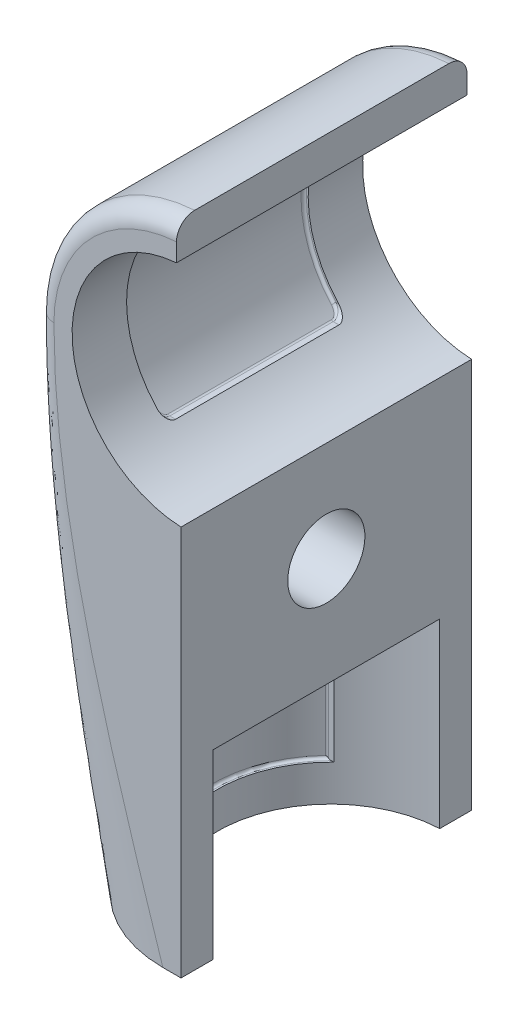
ISO-10303-21;
HEADER;
FILE_DESCRIPTION(('STEP AP214'),'2;1');
FILE_NAME('part.step','',(''),(''),'','','');
FILE_SCHEMA(('AUTOMOTIVE_DESIGN { 1 0 10303 214 1 1 1 1 }'));
ENDSEC;
DATA;
#1=APPLICATION_CONTEXT('core data for automotive mechanical design processes');
#2=APPLICATION_PROTOCOL_DEFINITION('international standard','automotive_design',2000,#1);
#3=PRODUCT_CONTEXT('',#1,'mechanical');
#4=PRODUCT('Part','Part','',(#3));
#5=PRODUCT_RELATED_PRODUCT_CATEGORY('part','',(#4));
#6=PRODUCT_DEFINITION_FORMATION('','',#4);
#7=PRODUCT_DEFINITION_CONTEXT('part definition',#1,'design');
#8=PRODUCT_DEFINITION('design','',#6,#7);
#9=PRODUCT_DEFINITION_SHAPE('','',#8);
#10=(LENGTH_UNIT() NAMED_UNIT(*) SI_UNIT(.MILLI.,.METRE.));
#11=(NAMED_UNIT(*) PLANE_ANGLE_UNIT() SI_UNIT($,.RADIAN.));
#12=(NAMED_UNIT(*) SI_UNIT($,.STERADIAN.) SOLID_ANGLE_UNIT());
#13=UNCERTAINTY_MEASURE_WITH_UNIT(LENGTH_MEASURE(1.E-05),#10,'distance_accuracy_value','');
#14=(GEOMETRIC_REPRESENTATION_CONTEXT(3) GLOBAL_UNCERTAINTY_ASSIGNED_CONTEXT((#13)) GLOBAL_UNIT_ASSIGNED_CONTEXT((#10,
#11,#12)) REPRESENTATION_CONTEXT('',''));
#15=CARTESIAN_POINT('',(0.,0.,0.));
#16=DIRECTION('',(0.,0.,1.));
#17=DIRECTION('',(1.,0.,0.));
#18=AXIS2_PLACEMENT_3D('',#15,#16,#17);
#19=CARTESIAN_POINT('',(-8.,32.,16.));
#20=DIRECTION('',(-1.,0.,0.));
#21=DIRECTION('',(0.,0.,1.));
#22=AXIS2_PLACEMENT_3D('',#19,#20,#21);
#23=PLANE('',#22);
#24=CARTESIAN_POINT('',(-8.,32.,16.));
#25=DIRECTION('',(-1.,0.,0.));
#26=DIRECTION('',(0.,0.,1.));
#27=AXIS2_PLACEMENT_3D('',#24,#25,#26);
#28=CIRCLE('',#27,4.25);
#29=CARTESIAN_POINT('',(-8.,32.,20.25));
#30=VERTEX_POINT('',#29);
#31=EDGE_CURVE('E525',#30,#30,#28,.F.);
#32=ORIENTED_EDGE('',*,*,#31,.T.);
#33=EDGE_LOOP('',(#32));
#34=FACE_BOUND('',#33,.T.);
#35=CARTESIAN_POINT('',(-8.,32.,16.));
#36=DIRECTION('',(-1.,0.,0.));
#37=DIRECTION('',(0.,0.,1.));
#38=AXIS2_PLACEMENT_3D('',#35,#36,#37);
#39=CIRCLE('',#38,8.);
#40=CARTESIAN_POINT('',(-8.,38.8541019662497,20.1256861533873));
#41=VERTEX_POINT('',#40);
#42=CARTESIAN_POINT('',(-8.,38.8541019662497,11.8743138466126));
#43=VERTEX_POINT('',#42);
#44=EDGE_CURVE('E831',#41,#43,#39,.T.);
#45=ORIENTED_EDGE('',*,*,#44,.T.);
#46=DIRECTION('',(0.,0.866025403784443,0.499999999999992));
#47=VECTOR('',#46,1.);
#48=CARTESIAN_POINT('',(-8.,38.8541019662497,11.8743138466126));
#49=LINE('',#48,#47);
#50=CARTESIAN_POINT('',(-8.,32.1458980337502,8.00133050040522));
#51=VERTEX_POINT('',#50);
#52=EDGE_CURVE('E843',#51,#43,#49,.T.);
#53=ORIENTED_EDGE('',*,*,#52,.F.);
#54=CARTESIAN_POINT('',(-8.,25.,12.1270166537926));
#55=VERTEX_POINT('',#54);
#56=EDGE_CURVE('E828',#51,#55,#39,.T.);
#57=ORIENTED_EDGE('',*,*,#56,.T.);
#58=DIRECTION('',(0.,0.,-1.));
#59=VECTOR('',#58,1.);
#60=CARTESIAN_POINT('',(-8.,25.,12.1270166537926));
#61=LINE('',#60,#59);
#62=CARTESIAN_POINT('',(-8.,25.,19.8729833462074));
#63=VERTEX_POINT('',#62);
#64=EDGE_CURVE('E875',#63,#55,#61,.T.);
#65=ORIENTED_EDGE('',*,*,#64,.F.);
#66=CARTESIAN_POINT('',(-8.,32.1458980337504,23.9986694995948));
#67=VERTEX_POINT('',#66);
#68=EDGE_CURVE('E832',#63,#67,#39,.T.);
#69=ORIENTED_EDGE('',*,*,#68,.T.);
#70=DIRECTION('',(0.,-0.866025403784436,0.500000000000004));
#71=VECTOR('',#70,1.);
#72=CARTESIAN_POINT('',(-8.,32.1458980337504,23.9986694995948));
#73=LINE('',#72,#71);
#74=EDGE_CURVE('E845',#41,#67,#73,.T.);
#75=ORIENTED_EDGE('',*,*,#74,.F.);
#76=EDGE_LOOP('',(#45,#53,#57,#65,#69,#75));
#77=FACE_BOUND('',#76,.T.);
#78=ADVANCED_FACE('F38',(#34,#77),#23,.T.);
#79=CARTESIAN_POINT('',(-8.,32.,16.));
#80=DIRECTION('',(-1.,0.,0.));
#81=DIRECTION('',(0.,0.,1.));
#82=AXIS2_PLACEMENT_3D('',#79,#80,#81);
#83=CYLINDRICAL_SURFACE('',#82,8.);
#84=CARTESIAN_POINT('',(-16.5,32.,16.));
#85=DIRECTION('',(-1.,0.,0.));
#86=DIRECTION('',(0.,0.,1.));
#87=AXIS2_PLACEMENT_3D('',#84,#85,#86);
#88=CIRCLE('',#87,8.);
#89=CARTESIAN_POINT('',(-16.5,32.,24.));
#90=VERTEX_POINT('',#89);
#91=EDGE_CURVE('E827',#90,#90,#88,.T.);
#92=ORIENTED_EDGE('',*,*,#91,.T.);
#93=EDGE_LOOP('',(#92));
#94=FACE_BOUND('',#93,.T.);
#95=DIRECTION('',(1.,0.,0.));
#96=VECTOR('',#95,1.);
#97=CARTESIAN_POINT('',(-14.,32.1458980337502,8.00133050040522));
#98=LINE('',#97,#96);
#99=CARTESIAN_POINT('',(-14.,32.1458980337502,8.00133050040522));
#100=VERTEX_POINT('',#99);
#101=EDGE_CURVE('E858',#100,#51,#98,.T.);
#102=ORIENTED_EDGE('',*,*,#101,.F.);
#103=CARTESIAN_POINT('',(-14.,32.,16.));
#104=DIRECTION('',(-1.,0.,0.));
#105=DIRECTION('',(0.,-0.866025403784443,-0.499999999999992));
#106=AXIS2_PLACEMENT_3D('',#103,#104,#105);
#107=CIRCLE('',#106,8.);
#108=CARTESIAN_POINT('',(-14.,38.8541019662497,11.8743138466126));
#109=VERTEX_POINT('',#108);
#110=EDGE_CURVE('E854',#109,#100,#107,.T.);
#111=ORIENTED_EDGE('',*,*,#110,.F.);
#112=DIRECTION('',(1.,0.,0.));
#113=VECTOR('',#112,1.);
#114=CARTESIAN_POINT('',(-14.,38.8541019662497,11.8743138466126));
#115=LINE('',#114,#113);
#116=EDGE_CURVE('E853',#109,#43,#115,.T.);
#117=ORIENTED_EDGE('',*,*,#116,.T.);
#118=ORIENTED_EDGE('',*,*,#44,.F.);
#119=DIRECTION('',(1.,0.,0.));
#120=VECTOR('',#119,1.);
#121=CARTESIAN_POINT('',(-14.,38.8541019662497,20.1256861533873));
#122=LINE('',#121,#120);
#123=CARTESIAN_POINT('',(-14.,38.8541019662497,20.1256861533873));
#124=VERTEX_POINT('',#123);
#125=EDGE_CURVE('E851',#124,#41,#122,.T.);
#126=ORIENTED_EDGE('',*,*,#125,.F.);
#127=CARTESIAN_POINT('',(-14.,32.,16.));
#128=DIRECTION('',(-1.,0.,0.));
#129=DIRECTION('',(0.,0.866025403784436,-0.500000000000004));
#130=AXIS2_PLACEMENT_3D('',#127,#128,#129);
#131=CIRCLE('',#130,8.);
#132=CARTESIAN_POINT('',(-14.,32.1458980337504,23.9986694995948));
#133=VERTEX_POINT('',#132);
#134=EDGE_CURVE('E860',#133,#124,#131,.T.);
#135=ORIENTED_EDGE('',*,*,#134,.F.);
#136=DIRECTION('',(1.,0.,0.));
#137=VECTOR('',#136,1.);
#138=CARTESIAN_POINT('',(-14.,32.1458980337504,23.9986694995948));
#139=LINE('',#138,#137);
#140=EDGE_CURVE('E871',#133,#67,#139,.T.);
#141=ORIENTED_EDGE('',*,*,#140,.T.);
#142=ORIENTED_EDGE('',*,*,#68,.F.);
#143=DIRECTION('',(1.,0.,0.));
#144=VECTOR('',#143,1.);
#145=CARTESIAN_POINT('',(-14.,25.,19.8729833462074));
#146=LINE('',#145,#144);
#147=CARTESIAN_POINT('',(-14.,25.,19.8729833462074));
#148=VERTEX_POINT('',#147);
#149=EDGE_CURVE('E829',#148,#63,#146,.T.);
#150=ORIENTED_EDGE('',*,*,#149,.F.);
#151=CARTESIAN_POINT('',(-14.,32.,16.));
#152=DIRECTION('',(-1.,0.,0.));
#153=DIRECTION('',(0.,0.,1.));
#154=AXIS2_PLACEMENT_3D('',#151,#152,#153);
#155=CIRCLE('',#154,8.);
#156=CARTESIAN_POINT('',(-14.,25.,12.1270166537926));
#157=VERTEX_POINT('',#156);
#158=EDGE_CURVE('E878',#157,#148,#155,.T.);
#159=ORIENTED_EDGE('',*,*,#158,.F.);
#160=DIRECTION('',(1.,0.,0.));
#161=VECTOR('',#160,1.);
#162=CARTESIAN_POINT('',(-14.,25.,12.1270166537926));
#163=LINE('',#162,#161);
#164=EDGE_CURVE('E833',#157,#55,#163,.T.);
#165=ORIENTED_EDGE('',*,*,#164,.T.);
#166=ORIENTED_EDGE('',*,*,#56,.F.);
#167=EDGE_LOOP('',(#102,#111,#117,#118,#126,#135,#141,#142,#150,#159,#165,#166));
#168=FACE_BOUND('',#167,.T.);
#169=ADVANCED_FACE('F591',(#94,#168),#83,.F.);
#170=CARTESIAN_POINT('',(-16.5,32.,16.));
#171=DIRECTION('',(1.,0.,0.));
#172=DIRECTION('',(0.,1.,0.));
#173=AXIS2_PLACEMENT_3D('',#170,#171,#172);
#174=CYLINDRICAL_SURFACE('',#173,4.25);
#175=CARTESIAN_POINT('',(-0.499999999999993,32.,16.));
#176=DIRECTION('',(1.,0.,0.));
#177=DIRECTION('',(0.,1.,0.));
#178=AXIS2_PLACEMENT_3D('',#175,#176,#177);
#179=CIRCLE('',#178,4.25);
#180=CARTESIAN_POINT('',(-0.499999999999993,36.25,16.));
#181=VERTEX_POINT('',#180);
#182=EDGE_CURVE('E710',#181,#181,#179,.T.);
#183=ORIENTED_EDGE('',*,*,#182,.T.);
#184=EDGE_LOOP('',(#183));
#185=FACE_BOUND('',#184,.T.);
#186=ORIENTED_EDGE('',*,*,#31,.F.);
#187=EDGE_LOOP('',(#186));
#188=FACE_BOUND('',#187,.T.);
#189=ADVANCED_FACE('F597',(#185,#188),#174,.F.);
#190=CARTESIAN_POINT('',(-0.499999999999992,43.0100040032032,32.));
#191=DIRECTION('',(-1.,0.,0.));
#192=DIRECTION('',(0.,-1.,0.));
#193=AXIS2_PLACEMENT_3D('',#190,#191,#192);
#194=PLANE('',#193);
#195=ORIENTED_EDGE('',*,*,#182,.F.);
#196=EDGE_LOOP('',(#195));
#197=FACE_BOUND('',#196,.T.);
#198=DIRECTION('',(0.,0.,1.));
#199=VECTOR('',#198,1.);
#200=CARTESIAN_POINT('',(-0.499999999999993,20.,32.));
#201=LINE('',#200,#199);
#202=CARTESIAN_POINT('',(-0.499999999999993,20.,3.5100040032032));
#203=VERTEX_POINT('',#202);
#204=CARTESIAN_POINT('',(-0.499999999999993,20.,28.4899959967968));
#205=VERTEX_POINT('',#204);
#206=EDGE_CURVE('E775',#203,#205,#201,.T.);
#207=ORIENTED_EDGE('',*,*,#206,.F.);
#208=DIRECTION('',(0.,-1.,0.));
#209=VECTOR('',#208,1.);
#210=CARTESIAN_POINT('',(-0.499999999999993,20.,3.5100040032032));
#211=LINE('',#210,#209);
#212=CARTESIAN_POINT('',(-0.499999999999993,0.,3.5100040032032));
#213=VERTEX_POINT('',#212);
#214=EDGE_CURVE('E735',#203,#213,#211,.T.);
#215=ORIENTED_EDGE('',*,*,#214,.T.);
#216=DIRECTION('',(0.,0.,-1.));
#217=VECTOR('',#216,1.);
#218=CARTESIAN_POINT('',(-0.499999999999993,0.,32.));
#219=LINE('',#218,#217);
#220=CARTESIAN_POINT('',(-0.499999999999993,0.,0.));
#221=VERTEX_POINT('',#220);
#222=EDGE_CURVE('E756',#213,#221,#219,.T.);
#223=ORIENTED_EDGE('',*,*,#222,.T.);
#224=DIRECTION('',(0.,1.,0.));
#225=VECTOR('',#224,1.);
#226=CARTESIAN_POINT('',(-0.499999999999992,43.0100040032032,0.));
#227=LINE('',#226,#225);
#228=CARTESIAN_POINT('',(-0.499999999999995,43.0100040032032,0.));
#229=VERTEX_POINT('',#228);
#230=EDGE_CURVE('E738',#221,#229,#227,.T.);
#231=ORIENTED_EDGE('',*,*,#230,.T.);
#232=DIRECTION('',(0.,0.,-1.));
#233=VECTOR('',#232,1.);
#234=CARTESIAN_POINT('',(-0.499999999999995,43.0100040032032,32.));
#235=LINE('',#234,#233);
#236=CARTESIAN_POINT('',(-0.499999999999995,43.0100040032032,32.));
#237=VERTEX_POINT('',#236);
#238=EDGE_CURVE('E772',#237,#229,#235,.T.);
#239=ORIENTED_EDGE('',*,*,#238,.F.);
#240=DIRECTION('',(0.,1.,0.));
#241=VECTOR('',#240,1.);
#242=CARTESIAN_POINT('',(-0.499999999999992,43.0100040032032,32.));
#243=LINE('',#242,#241);
#244=CARTESIAN_POINT('',(-0.499999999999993,0.,32.));
#245=VERTEX_POINT('',#244);
#246=EDGE_CURVE('E746',#245,#237,#243,.T.);
#247=ORIENTED_EDGE('',*,*,#246,.F.);
#248=CARTESIAN_POINT('',(-0.499999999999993,0.,28.4899959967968));
#249=VERTEX_POINT('',#248);
#250=EDGE_CURVE('E757',#245,#249,#219,.T.);
#251=ORIENTED_EDGE('',*,*,#250,.T.);
#252=DIRECTION('',(0.,-1.,0.));
#253=VECTOR('',#252,1.);
#254=CARTESIAN_POINT('',(-0.499999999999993,20.,28.4899959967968));
#255=LINE('',#254,#253);
#256=EDGE_CURVE('E732',#249,#205,#255,.F.);
#257=ORIENTED_EDGE('',*,*,#256,.T.);
#258=EDGE_LOOP('',(#207,#215,#223,#231,#239,#247,#251,#257));
#259=FACE_BOUND('',#258,.T.);
#260=ADVANCED_FACE('F534',(#197,#259),#194,.F.);
#261=CARTESIAN_POINT('',(0.,55.5,32.));
#262=DIRECTION('',(0.,0.,-1.));
#263=DIRECTION('',(-1.,0.,0.));
#264=AXIS2_PLACEMENT_3D('',#261,#262,#263);
#265=CYLINDRICAL_SURFACE('',#264,12.5);
#266=CARTESIAN_POINT('',(-8.10642968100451,45.9849698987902,25.));
#267=CARTESIAN_POINT('',(-8.10642457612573,45.984966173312,25.0216387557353));
#268=CARTESIAN_POINT('',(-8.10725485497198,45.9856728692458,25.0432623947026));
#269=CARTESIAN_POINT('',(-8.11053214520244,45.9884661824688,25.0862728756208));
#270=CARTESIAN_POINT('',(-8.11297731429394,45.9905512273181,25.1076599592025));
#271=CARTESIAN_POINT('',(-8.12258137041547,45.9987503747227,25.170733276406));
#272=CARTESIAN_POINT('',(-8.13201160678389,46.0068106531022,25.2118480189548));
#273=CARTESIAN_POINT('',(-8.15598362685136,46.0273987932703,25.2910913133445));
#274=CARTESIAN_POINT('',(-8.17050393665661,46.0399078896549,25.3292315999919));
#275=CARTESIAN_POINT('',(-8.20362949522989,46.0686190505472,25.4023025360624));
#276=CARTESIAN_POINT('',(-8.22224692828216,46.0848321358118,25.4372231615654));
#277=CARTESIAN_POINT('',(-8.27301503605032,46.1293616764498,25.5207625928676));
#278=CARTESIAN_POINT('',(-8.30718478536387,46.1596008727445,25.5671240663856));
#279=CARTESIAN_POINT('',(-8.38010473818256,46.2249655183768,25.6521343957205));
#280=CARTESIAN_POINT('',(-8.41886505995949,46.260101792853,25.6907656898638));
#281=CARTESIAN_POINT('',(-8.51666542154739,46.3500003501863,25.7759749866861));
#282=CARTESIAN_POINT('',(-8.57723102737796,46.4066824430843,25.818773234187));
#283=CARTESIAN_POINT('',(-8.7012225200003,46.5252506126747,25.8907711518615));
#284=CARTESIAN_POINT('',(-8.76465178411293,46.5871429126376,25.9199542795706));
#285=CARTESIAN_POINT('',(-8.88239372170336,46.7046108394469,25.9615821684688));
#286=CARTESIAN_POINT('',(-8.93657198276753,46.7596498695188,25.9759370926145));
#287=CARTESIAN_POINT('',(-9.01750179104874,46.8434322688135,25.9903357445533));
#288=CARTESIAN_POINT('',(-9.04435986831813,46.8714968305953,25.9939461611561));
#289=CARTESIAN_POINT('',(-9.09791723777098,46.9279862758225,25.9987767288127));
#290=CARTESIAN_POINT('',(-9.12461651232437,46.9564111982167,25.9999966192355));
#291=CARTESIAN_POINT('',(-9.15118912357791,46.9849698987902,26.));
#292=B_SPLINE_CURVE_WITH_KNOTS('',3,(#266,#267,#268,#269,#270,#271,#272,#273,#274,#275,#276,
#277,#278,#279,#280,#281,#282,#283,#284,#285,#286,#287,#288,#289,#290,#291),.UNSPECIFIED.,.F.,
.F.,(4,2,2,2,2,2,2,2,2,2,2,2,4),(0.,0.0648607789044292,0.129647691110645,0.257698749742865,
0.385215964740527,0.513117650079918,0.707175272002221,0.901668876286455,1.18020823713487,
1.45908514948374,1.6941203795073,1.81109352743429,1.92807942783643),.UNSPECIFIED.);
#293=CARTESIAN_POINT('',(-8.10642968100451,45.9849698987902,25.));
#294=VERTEX_POINT('',#293);
#295=CARTESIAN_POINT('',(-9.15118912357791,46.9849698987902,26.));
#296=VERTEX_POINT('',#295);
#297=EDGE_CURVE('E558',#294,#296,#292,.T.);
#298=ORIENTED_EDGE('',*,*,#297,.T.);
#299=CARTESIAN_POINT('',(0.,55.5,26.));
#300=DIRECTION('',(0.,0.,1.));
#301=DIRECTION('',(0.,-1.,0.));
#302=AXIS2_PLACEMENT_3D('',#299,#300,#301);
#303=CIRCLE('',#302,12.5);
#304=CARTESIAN_POINT('',(-9.17906780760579,63.9849698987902,26.));
#305=VERTEX_POINT('',#304);
#306=EDGE_CURVE('E564',#296,#305,#303,.F.);
#307=ORIENTED_EDGE('',*,*,#306,.T.);
#308=CARTESIAN_POINT('',(-9.17906780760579,63.9849698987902,26.));
#309=CARTESIAN_POINT('',(-9.1433698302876,64.0235926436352,25.9999897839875));
#310=CARTESIAN_POINT('',(-9.10742906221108,64.0619800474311,25.9977623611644));
#311=CARTESIAN_POINT('',(-9.03530417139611,64.1380557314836,25.988957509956));
#312=CARTESIAN_POINT('',(-8.99911994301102,64.175743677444,25.9823780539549));
#313=CARTESIAN_POINT('',(-8.92648829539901,64.2504598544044,25.9648824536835));
#314=CARTESIAN_POINT('',(-8.89004114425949,64.2874801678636,25.9539312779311));
#315=CARTESIAN_POINT('',(-8.8174911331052,64.3602760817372,25.92770759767));
#316=CARTESIAN_POINT('',(-8.78138817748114,64.3960520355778,25.9124363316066));
#317=CARTESIAN_POINT('',(-8.68892243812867,64.4865956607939,25.8673085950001));
#318=CARTESIAN_POINT('',(-8.63304073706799,64.5402532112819,25.8341426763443));
#319=CARTESIAN_POINT('',(-8.52484249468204,64.6423495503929,25.7562813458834));
#320=CARTESIAN_POINT('',(-8.4725153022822,64.6908042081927,25.7116224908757));
#321=CARTESIAN_POINT('',(-8.39061467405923,64.7655042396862,25.6267435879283));
#322=CARTESIAN_POINT('',(-8.35927308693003,64.7937669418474,25.5900108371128));
#323=CARTESIAN_POINT('',(-8.3007477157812,64.8460749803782,25.5106375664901));
#324=CARTESIAN_POINT('',(-8.27355913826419,64.8701251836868,25.4680039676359));
#325=CARTESIAN_POINT('',(-8.23065449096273,64.9078134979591,25.3871384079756));
#326=CARTESIAN_POINT('',(-8.21373366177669,64.9225767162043,25.3500769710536));
#327=CARTESIAN_POINT('',(-8.18461413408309,64.9478814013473,25.2728436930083));
#328=CARTESIAN_POINT('',(-8.17240221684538,64.9584346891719,25.232680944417));
#329=CARTESIAN_POINT('',(-8.15607496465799,64.9725145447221,25.1604545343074));
#330=CARTESIAN_POINT('',(-8.15069658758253,64.977140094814,25.1288892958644));
#331=CARTESIAN_POINT('',(-8.14342323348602,64.9833888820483,25.0649015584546));
#332=CARTESIAN_POINT('',(-8.14154701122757,64.9849959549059,25.0324753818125));
#333=CARTESIAN_POINT('',(-8.14158129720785,64.9849698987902,25.));
#334=B_SPLINE_CURVE_WITH_KNOTS('',3,(#308,#309,#310,#311,#312,#313,#314,#315,#316,#317,#318,
#319,#320,#321,#322,#323,#324,#325,#326,#327,#328,#329,#330,#331,#332,#333),.UNSPECIFIED.,.F.,
.F.,(4,2,2,2,2,2,2,2,2,2,2,2,4),(0.,0.157720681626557,0.315514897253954,0.474599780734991,
0.633639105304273,0.885555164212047,1.13667962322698,1.30404832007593,1.47122235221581,
1.60075321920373,1.72991777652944,1.82665131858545,1.92390141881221),.UNSPECIFIED.);
#335=CARTESIAN_POINT('',(-8.14158129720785,64.9849698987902,25.));
#336=VERTEX_POINT('',#335);
#337=EDGE_CURVE('E515',#305,#336,#334,.T.);
#338=ORIENTED_EDGE('',*,*,#337,.T.);
#339=DIRECTION('',(0.,0.,-1.));
#340=VECTOR('',#339,1.);
#341=CARTESIAN_POINT('',(-8.14158129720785,64.9849698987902,32.));
#342=LINE('',#341,#340);
#343=CARTESIAN_POINT('',(-8.14158129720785,64.9849698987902,7.00000000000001));
#344=VERTEX_POINT('',#343);
#345=EDGE_CURVE('E523',#336,#344,#342,.T.);
#346=ORIENTED_EDGE('',*,*,#345,.T.);
#347=CARTESIAN_POINT('',(-8.14158129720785,64.9849698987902,7.00000000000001));
#348=CARTESIAN_POINT('',(-8.14157625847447,64.9849735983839,6.9783139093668));
#349=CARTESIAN_POINT('',(-8.14240389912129,64.9842638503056,6.95664289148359));
#350=CARTESIAN_POINT('',(-8.14567111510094,64.9814581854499,6.91353699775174));
#351=CARTESIAN_POINT('',(-8.14810887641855,64.9793638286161,6.89210188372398));
#352=CARTESIAN_POINT('',(-8.15768524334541,64.9711268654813,6.82888059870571));
#353=CARTESIAN_POINT('',(-8.16708967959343,64.9630282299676,6.78766503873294));
#354=CARTESIAN_POINT('',(-8.19100373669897,64.9423355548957,6.70821795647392));
#355=CARTESIAN_POINT('',(-8.2054921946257,64.929760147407,6.66997485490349));
#356=CARTESIAN_POINT('',(-8.23855330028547,64.9008895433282,6.59670481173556));
#357=CARTESIAN_POINT('',(-8.25713802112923,64.8845833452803,6.5616878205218));
#358=CARTESIAN_POINT('',(-8.30774303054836,64.8398631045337,6.47806042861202));
#359=CARTESIAN_POINT('',(-8.34176461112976,64.8095292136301,6.43169291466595));
#360=CARTESIAN_POINT('',(-8.41437721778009,64.7439532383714,6.34667182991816));
#361=CARTESIAN_POINT('',(-8.45297828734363,64.7087003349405,6.30803573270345));
#362=CARTESIAN_POINT('',(-8.55016725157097,64.6186989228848,6.22302596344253));
#363=CARTESIAN_POINT('',(-8.61025605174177,64.5620496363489,6.18038382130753));
#364=CARTESIAN_POINT('',(-8.73327559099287,64.4435581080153,6.10865390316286));
#365=CARTESIAN_POINT('',(-8.79620963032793,64.3817097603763,6.07958233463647));
#366=CARTESIAN_POINT('',(-8.9129213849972,64.2644479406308,6.03817237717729));
#367=CARTESIAN_POINT('',(-8.96656429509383,64.2095744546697,6.02390862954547));
#368=CARTESIAN_POINT('',(-9.04669558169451,64.1260526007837,6.00960188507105));
#369=CARTESIAN_POINT('',(-9.073289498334,64.0980760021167,6.00601462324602));
#370=CARTESIAN_POINT('',(-9.12632005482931,64.0417668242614,6.00121520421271));
#371=CARTESIAN_POINT('',(-9.15275667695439,64.013434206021,6.00000330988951));
#372=CARTESIAN_POINT('',(-9.17906780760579,63.9849698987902,6.));
#373=B_SPLINE_CURVE_WITH_KNOTS('',3,(#347,#348,#349,#350,#351,#352,#353,#354,#355,#356,#357,
#358,#359,#360,#361,#362,#363,#364,#365,#366,#367,#368,#369,#370,#371,#372),.UNSPECIFIED.,.F.,
.F.,(4,2,2,2,2,2,2,2,2,2,2,2,4),(0.,0.0650029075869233,0.129932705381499,0.258278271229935,
0.386095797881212,0.514295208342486,0.708266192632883,0.902670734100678,1.18001665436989,
1.45769296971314,1.69122833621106,1.80746070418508,1.92370593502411),.UNSPECIFIED.);
#374=CARTESIAN_POINT('',(-9.17906780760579,63.9849698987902,6.));
#375=VERTEX_POINT('',#374);
#376=EDGE_CURVE('E543',#344,#375,#373,.T.);
#377=ORIENTED_EDGE('',*,*,#376,.T.);
#378=CARTESIAN_POINT('',(0.,55.5,6.));
#379=DIRECTION('',(0.,0.,-1.));
#380=DIRECTION('',(0.,1.,0.));
#381=AXIS2_PLACEMENT_3D('',#378,#379,#380);
#382=CIRCLE('',#381,12.5);
#383=CARTESIAN_POINT('',(-9.15118912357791,46.9849698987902,5.99999999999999));
#384=VERTEX_POINT('',#383);
#385=EDGE_CURVE('E556',#375,#384,#382,.F.);
#386=ORIENTED_EDGE('',*,*,#385,.T.);
#387=CARTESIAN_POINT('',(-9.15118912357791,46.9849698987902,5.99999999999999));
#388=CARTESIAN_POINT('',(-9.11513976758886,46.9462226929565,6.00001048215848));
#389=CARTESIAN_POINT('',(-9.07884535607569,46.9077146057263,6.0022520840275));
#390=CARTESIAN_POINT('',(-9.0060106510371,46.8314052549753,6.0111120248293));
#391=CARTESIAN_POINT('',(-8.96947024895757,46.7936043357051,6.01773244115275));
#392=CARTESIAN_POINT('',(-8.89612021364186,46.7186663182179,6.03533688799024));
#393=CARTESIAN_POINT('',(-8.85931085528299,46.6815373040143,6.04635658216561));
#394=CARTESIAN_POINT('',(-8.78604018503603,46.608533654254,6.07274513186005));
#395=CARTESIAN_POINT('',(-8.7495787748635,46.5726586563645,6.08811271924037));
#396=CARTESIAN_POINT('',(-8.65642088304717,46.4820909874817,6.13341962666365));
#397=CARTESIAN_POINT('',(-8.60020485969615,46.4285019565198,6.16664804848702));
#398=CARTESIAN_POINT('',(-8.49135074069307,46.3265336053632,6.24463934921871));
#399=CARTESIAN_POINT('',(-8.438701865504,46.2781383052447,6.28936532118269));
#400=CARTESIAN_POINT('',(-8.3564151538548,46.2036401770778,6.37425912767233));
#401=CARTESIAN_POINT('',(-8.32498931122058,46.1755105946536,6.41090941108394));
#402=CARTESIAN_POINT('',(-8.26628967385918,46.123434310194,6.49010192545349));
#403=CARTESIAN_POINT('',(-8.23901112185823,46.0994828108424,6.53263729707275));
#404=CARTESIAN_POINT('',(-8.19596894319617,46.0619535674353,6.61328763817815));
#405=CARTESIAN_POINT('',(-8.17899625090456,46.0472547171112,6.65022857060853));
#406=CARTESIAN_POINT('',(-8.14977046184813,46.0220459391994,6.72721950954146));
#407=CARTESIAN_POINT('',(-8.13750403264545,46.0115241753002,6.76726034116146));
#408=CARTESIAN_POINT('',(-8.12106180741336,45.9974505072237,6.8393867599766));
#409=CARTESIAN_POINT('',(-8.11563296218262,45.9928163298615,6.87097657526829));
#410=CARTESIAN_POINT('',(-8.10828968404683,45.9865545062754,6.93502498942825));
#411=CARTESIAN_POINT('',(-8.10639458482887,45.984943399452,6.96748738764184));
#412=CARTESIAN_POINT('',(-8.1064296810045,45.9849698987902,7.));
#413=B_SPLINE_CURVE_WITH_KNOTS('',3,(#387,#388,#389,#390,#391,#392,#393,#394,#395,#396,#397,
#398,#399,#400,#401,#402,#403,#404,#405,#406,#407,#408,#409,#410,#411,#412),.UNSPECIFIED.,.F.,
.F.,(4,2,2,2,2,2,2,2,2,2,2,2,4),(0.,0.158710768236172,0.317496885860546,0.477597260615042,
0.637650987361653,0.890180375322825,1.14190905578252,1.30905984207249,1.47601742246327,
1.60523682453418,1.73408740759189,1.83091820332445,1.92827723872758),.UNSPECIFIED.);
#414=CARTESIAN_POINT('',(-8.10642968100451,45.9849698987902,7.));
#415=VERTEX_POINT('',#414);
#416=EDGE_CURVE('E549',#384,#415,#413,.T.);
#417=ORIENTED_EDGE('',*,*,#416,.T.);
#418=DIRECTION('',(0.,0.,-1.));
#419=VECTOR('',#418,1.);
#420=CARTESIAN_POINT('',(-8.10642968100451,45.9849698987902,32.));
#421=LINE('',#420,#419);
#422=EDGE_CURVE('E555',#415,#294,#421,.F.);
#423=ORIENTED_EDGE('',*,*,#422,.T.);
#424=EDGE_LOOP('',(#298,#307,#338,#346,#377,#386,#417,#423));
#425=FACE_BOUND('',#424,.T.);
#426=CARTESIAN_POINT('',(0.,55.5,0.));
#427=DIRECTION('',(0.,0.,-1.));
#428=DIRECTION('',(1.,0.,0.));
#429=AXIS2_PLACEMENT_3D('',#426,#427,#428);
#430=CIRCLE('',#429,12.5);
#431=CARTESIAN_POINT('',(-1.,67.9599357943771,0.));
#432=VERTEX_POINT('',#431);
#433=EDGE_CURVE('E741',#229,#432,#430,.T.);
#434=ORIENTED_EDGE('',*,*,#433,.T.);
#435=DIRECTION('',(0.,0.,-1.));
#436=VECTOR('',#435,1.);
#437=CARTESIAN_POINT('',(-1.,67.9599357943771,32.));
#438=LINE('',#437,#436);
#439=CARTESIAN_POINT('',(-1.,67.9599357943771,32.));
#440=VERTEX_POINT('',#439);
#441=EDGE_CURVE('E769',#440,#432,#438,.T.);
#442=ORIENTED_EDGE('',*,*,#441,.F.);
#443=CARTESIAN_POINT('',(0.,55.5,32.));
#444=DIRECTION('',(0.,0.,-1.));
#445=DIRECTION('',(1.,0.,0.));
#446=AXIS2_PLACEMENT_3D('',#443,#444,#445);
#447=CIRCLE('',#446,12.5);
#448=EDGE_CURVE('E749',#237,#440,#447,.T.);
#449=ORIENTED_EDGE('',*,*,#448,.F.);
#450=ORIENTED_EDGE('',*,*,#238,.T.);
#451=EDGE_LOOP('',(#434,#442,#449,#450));
#452=FACE_BOUND('',#451,.T.);
#453=ADVANCED_FACE('F528',(#425,#452),#265,.F.);
#454=CARTESIAN_POINT('',(-1.,71.9696690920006,32.));
#455=DIRECTION('',(-1.,0.,0.));
#456=DIRECTION('',(0.,-1.,0.));
#457=AXIS2_PLACEMENT_3D('',#454,#455,#456);
#458=PLANE('',#457);
#459=DIRECTION('',(0.,1.,0.));
#460=VECTOR('',#459,1.);
#461=CARTESIAN_POINT('',(-1.,71.9696690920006,0.));
#462=LINE('',#461,#460);
#463=CARTESIAN_POINT('',(-1.,69.9654761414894,0.));
#464=VERTEX_POINT('',#463);
#465=EDGE_CURVE('E743',#432,#464,#462,.T.);
#466=ORIENTED_EDGE('',*,*,#465,.T.);
#467=CARTESIAN_POINT('',(-1.,69.9654761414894,0.));
#468=CARTESIAN_POINT('',(-1.,70.0219559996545,4.4165968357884E-07));
#469=CARTESIAN_POINT('',(-1.,70.0784088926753,0.002382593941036));
#470=CARTESIAN_POINT('',(-1.,70.1909117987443,0.011887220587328));
#471=CARTESIAN_POINT('',(-1.,70.2469618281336,0.0190095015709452));
#472=CARTESIAN_POINT('',(-1.,70.4138156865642,0.0474223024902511));
#473=CARTESIAN_POINT('',(-1.,70.5235034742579,0.0757589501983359));
#474=CARTESIAN_POINT('',(-1.,70.7365638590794,0.150451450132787));
#475=CARTESIAN_POINT('',(-1.,70.8399331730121,0.196816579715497));
#476=CARTESIAN_POINT('',(-1.,71.0374019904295,0.306258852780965));
#477=CARTESIAN_POINT('',(-1.,71.13150334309,0.369332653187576));
#478=CARTESIAN_POINT('',(-1.,71.307636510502,0.510324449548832));
#479=CARTESIAN_POINT('',(-1.,71.389683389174,0.5882236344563));
#480=CARTESIAN_POINT('',(-1.,71.5395202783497,0.756734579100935));
#481=CARTESIAN_POINT('',(-1.,71.6073075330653,0.8473487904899));
#482=CARTESIAN_POINT('',(-1.,71.7265451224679,1.03851479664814));
#483=CARTESIAN_POINT('',(-1.,71.77802475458,1.13904833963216));
#484=CARTESIAN_POINT('',(-1.,71.8633164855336,1.34732015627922));
#485=CARTESIAN_POINT('',(-1.,71.8971394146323,1.45505396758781));
#486=CARTESIAN_POINT('',(-1.,71.9376126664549,1.63622367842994));
#487=CARTESIAN_POINT('',(-1.,71.949626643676,1.70850652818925));
#488=CARTESIAN_POINT('',(-1.,71.9656536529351,1.85384933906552));
#489=CARTESIAN_POINT('',(-1.,71.969678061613,1.92690804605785));
#490=CARTESIAN_POINT('',(-1.,71.9696690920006,2.));
#491=B_SPLINE_CURVE_WITH_KNOTS('',3,(#467,#468,#469,#470,#471,#472,#473,#474,#475,#476,#477,
#478,#479,#480,#481,#482,#483,#484,#485,#486,#487,#488,#489,#490),.UNSPECIFIED.,.F.,.F.,(4,2,2,
2,2,2,2,2,2,2,2,4),(0.,0.169335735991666,0.338664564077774,0.676788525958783,1.01508671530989,
1.35331726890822,1.69112148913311,2.02899093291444,2.36624988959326,2.70330173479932,
2.92271478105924,3.14181517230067),.UNSPECIFIED.);
#492=CARTESIAN_POINT('',(-1.,71.9696690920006,2.));
#493=VERTEX_POINT('',#492);
#494=EDGE_CURVE('E620',#464,#493,#491,.T.);
#495=ORIENTED_EDGE('',*,*,#494,.T.);
#496=DIRECTION('',(0.,0.,-1.));
#497=VECTOR('',#496,1.);
#498=CARTESIAN_POINT('',(-1.,71.9696690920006,32.));
#499=LINE('',#498,#497);
#500=CARTESIAN_POINT('',(-1.,71.9696690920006,30.));
#501=VERTEX_POINT('',#500);
#502=EDGE_CURVE('E766',#501,#493,#499,.T.);
#503=ORIENTED_EDGE('',*,*,#502,.F.);
#504=CARTESIAN_POINT('',(-1.,71.9696690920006,30.));
#505=CARTESIAN_POINT('',(-1.,71.9696687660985,30.0561915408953));
#506=CARTESIAN_POINT('',(-1.,71.9672951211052,30.1123561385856));
#507=CARTESIAN_POINT('',(-1.,71.9578260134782,30.2242829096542));
#508=CARTESIAN_POINT('',(-1.,71.9507307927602,30.2800451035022));
#509=CARTESIAN_POINT('',(-1.,71.9224316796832,30.4460259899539));
#510=CARTESIAN_POINT('',(-1.,71.8942141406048,30.5551320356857));
#511=CARTESIAN_POINT('',(-1.,71.8198660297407,30.7670537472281));
#512=CARTESIAN_POINT('',(-1.,71.773727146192,30.8698664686));
#513=CARTESIAN_POINT('',(-1.,71.6648604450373,31.0662924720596));
#514=CARTESIAN_POINT('',(-1.,71.6021353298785,31.1599072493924));
#515=CARTESIAN_POINT('',(-1.,71.4618322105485,31.3353600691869));
#516=CARTESIAN_POINT('',(-1.,71.3842432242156,31.417189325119));
#517=CARTESIAN_POINT('',(-1.,71.2164322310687,31.5667051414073));
#518=CARTESIAN_POINT('',(-1.,71.1262077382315,31.6343889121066));
#519=CARTESIAN_POINT('',(-1.,70.9355245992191,31.7538106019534));
#520=CARTESIAN_POINT('',(-1.,70.8350462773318,31.805517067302));
#521=CARTESIAN_POINT('',(-1.,70.6268654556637,31.8913401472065));
#522=CARTESIAN_POINT('',(-1.,70.5191669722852,31.9254664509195));
#523=CARTESIAN_POINT('',(-1.,70.336607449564,31.9668414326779));
#524=CARTESIAN_POINT('',(-1.,70.262877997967,31.9792688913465));
#525=CARTESIAN_POINT('',(-1.,70.1146011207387,31.9958471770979));
#526=CARTESIAN_POINT('',(-1.,70.0400550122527,32.0000097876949));
#527=CARTESIAN_POINT('',(-1.,69.9654761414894,32.));
#528=B_SPLINE_CURVE_WITH_KNOTS('',3,(#504,#505,#506,#507,#508,#509,#510,#511,#512,#513,#514,
#515,#516,#517,#518,#519,#520,#521,#522,#523,#524,#525,#526,#527),.UNSPECIFIED.,.F.,.F.,(4,2,2,
2,2,2,2,2,2,2,2,4),(0.,0.168470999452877,0.33693336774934,0.673286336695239,1.00979548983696,
1.34624984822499,1.68295376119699,2.01972401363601,2.35715308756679,2.69439599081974,
2.91827206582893,3.14182872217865),.UNSPECIFIED.);
#529=CARTESIAN_POINT('',(-1.,69.9654761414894,32.));
#530=VERTEX_POINT('',#529);
#531=EDGE_CURVE('E657',#501,#530,#528,.T.);
#532=ORIENTED_EDGE('',*,*,#531,.T.);
#533=DIRECTION('',(0.,1.,0.));
#534=VECTOR('',#533,1.);
#535=CARTESIAN_POINT('',(-1.,71.9696690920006,32.));
#536=LINE('',#535,#534);
#537=EDGE_CURVE('E751',#440,#530,#536,.T.);
#538=ORIENTED_EDGE('',*,*,#537,.F.);
#539=ORIENTED_EDGE('',*,*,#441,.T.);
#540=EDGE_LOOP('',(#466,#495,#503,#532,#538,#539));
#541=FACE_BOUND('',#540,.T.);
#542=ADVANCED_FACE('F533',(#541),#458,.F.);
#543=CARTESIAN_POINT('',(0.,55.5,32.));
#544=DIRECTION('',(0.,0.,-1.));
#545=DIRECTION('',(-1.,0.,0.));
#546=AXIS2_PLACEMENT_3D('',#543,#544,#545);
#547=CYLINDRICAL_SURFACE('',#546,16.5);
#548=ORIENTED_EDGE('',*,*,#502,.T.);
#549=CARTESIAN_POINT('',(0.,55.5,2.));
#550=DIRECTION('',(0.,0.,-1.));
#551=DIRECTION('',(-1.,0.,0.));
#552=AXIS2_PLACEMENT_3D('',#549,#550,#551);
#553=CIRCLE('',#552,16.5);
#554=CARTESIAN_POINT('',(-16.5,55.5,2.));
#555=VERTEX_POINT('',#554);
#556=EDGE_CURVE('E703',#493,#555,#553,.F.);
#557=ORIENTED_EDGE('',*,*,#556,.T.);
#558=DIRECTION('',(0.,0.,-1.));
#559=VECTOR('',#558,1.);
#560=CARTESIAN_POINT('',(-16.5,55.5,32.));
#561=LINE('',#560,#559);
#562=CARTESIAN_POINT('',(-16.5,55.5,30.));
#563=VERTEX_POINT('',#562);
#564=EDGE_CURVE('E763',#563,#555,#561,.T.);
#565=ORIENTED_EDGE('',*,*,#564,.F.);
#566=CARTESIAN_POINT('',(0.,55.5,30.));
#567=DIRECTION('',(0.,0.,-1.));
#568=DIRECTION('',(-1.,0.,0.));
#569=AXIS2_PLACEMENT_3D('',#566,#567,#568);
#570=CIRCLE('',#569,16.5);
#571=EDGE_CURVE('E786',#563,#501,#570,.T.);
#572=ORIENTED_EDGE('',*,*,#571,.T.);
#573=EDGE_LOOP('',(#548,#557,#565,#572));
#574=FACE_BOUND('',#573,.T.);
#575=ADVANCED_FACE('F812',(#574),#547,.T.);
#576=CARTESIAN_POINT('',(-16.5,0.,32.));
#577=DIRECTION('',(1.,0.,0.));
#578=DIRECTION('',(0.,0.,-1.));
#579=AXIS2_PLACEMENT_3D('',#576,#577,#578);
#580=PLANE('',#579);
#581=ORIENTED_EDGE('',*,*,#91,.F.);
#582=EDGE_LOOP('',(#581));
#583=FACE_BOUND('',#582,.T.);
#584=ORIENTED_EDGE('',*,*,#564,.T.);
#585=CARTESIAN_POINT('',(-16.5,55.5,2.));
#586=CARTESIAN_POINT('',(-16.5,37.,2.));
#587=CARTESIAN_POINT('',(-16.5,18.5,8.));
#588=CARTESIAN_POINT('',(-16.5,0.,14.));
#589=CARTESIAN_POINT('',(-16.5,-37.,26.));
#590=CARTESIAN_POINT('',(-16.5,-74.,38.));
#591=CARTESIAN_POINT('',(-16.5,-111.,50.));
#592=(BOUNDED_CURVE() B_SPLINE_CURVE(3,(#585,#586,#587,#588,#589,#590,#591),.UNSPECIFIED.,.F.,
.F.) B_SPLINE_CURVE_WITH_KNOTS((4,3,4),(0.,0.333333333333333,1.),
.UNSPECIFIED.) CURVE() GEOMETRIC_REPRESENTATION_ITEM() RATIONAL_B_SPLINE_CURVE((1.,1.,1.,1.,1.,
1.,1.)) REPRESENTATION_ITEM(''));
#593=CARTESIAN_POINT('',(-16.5,0.,14.));
#594=VERTEX_POINT('',#593);
#595=EDGE_CURVE('E626',#555,#594,#592,.T.);
#596=ORIENTED_EDGE('',*,*,#595,.T.);
#597=DIRECTION('',(0.,0.,-1.));
#598=VECTOR('',#597,1.);
#599=CARTESIAN_POINT('',(-16.5,0.,32.));
#600=LINE('',#599,#598);
#601=CARTESIAN_POINT('',(-16.5,0.,18.));
#602=VERTEX_POINT('',#601);
#603=EDGE_CURVE('E760',#602,#594,#600,.T.);
#604=ORIENTED_EDGE('',*,*,#603,.F.);
#605=CARTESIAN_POINT('',(-16.5,55.5,30.));
#606=CARTESIAN_POINT('',(-16.5,37.,30.));
#607=CARTESIAN_POINT('',(-16.5,18.5,24.));
#608=CARTESIAN_POINT('',(-16.5,0.,18.));
#609=CARTESIAN_POINT('',(-16.5,-37.,6.00000000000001));
#610=CARTESIAN_POINT('',(-16.5,-74.,-6.));
#611=CARTESIAN_POINT('',(-16.5,-111.,-18.));
#612=(BOUNDED_CURVE() B_SPLINE_CURVE(3,(#605,#606,#607,#608,#609,#610,#611),.UNSPECIFIED.,.F.,
.F.) B_SPLINE_CURVE_WITH_KNOTS((4,3,4),(0.,0.333333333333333,1.),
.UNSPECIFIED.) CURVE() GEOMETRIC_REPRESENTATION_ITEM() RATIONAL_B_SPLINE_CURVE((1.,1.,1.,1.,1.,
1.,1.)) REPRESENTATION_ITEM(''));
#613=EDGE_CURVE('E656',#602,#563,#612,.F.);
#614=ORIENTED_EDGE('',*,*,#613,.T.);
#615=EDGE_LOOP('',(#584,#596,#604,#614));
#616=FACE_BOUND('',#615,.T.);
#617=ADVANCED_FACE('F644',(#583,#616),#580,.F.);
#618=CARTESIAN_POINT('',(-0.499999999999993,0.,32.));
#619=DIRECTION('',(0.,1.,0.));
#620=DIRECTION('',(-1.,0.,0.));
#621=AXIS2_PLACEMENT_3D('',#618,#619,#620);
#622=PLANE('',#621);
#623=ORIENTED_EDGE('',*,*,#603,.T.);
#624=CARTESIAN_POINT('',(-16.5,0.,14.));
#625=CARTESIAN_POINT('',(-16.5000423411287,0.,13.6062351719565));
#626=CARTESIAN_POINT('',(-16.4833891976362,0.,13.2124764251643));
#627=CARTESIAN_POINT('',(-16.4169977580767,0.,12.4277761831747));
#628=CARTESIAN_POINT('',(-16.36726104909,0.,12.0368345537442));
#629=CARTESIAN_POINT('',(-16.2350582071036,0.,11.2608286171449));
#630=CARTESIAN_POINT('',(-16.152616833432,0.,10.8757600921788));
#631=CARTESIAN_POINT('',(-15.9556043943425,0.,10.1139373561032));
#632=CARTESIAN_POINT('',(-15.8410337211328,0.,9.73718304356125));
#633=CARTESIAN_POINT('',(-15.5805090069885,0.,8.99447946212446));
#634=CARTESIAN_POINT('',(-15.4345396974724,0.,8.62853554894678));
#635=CARTESIAN_POINT('',(-15.1122895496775,0.,7.91024656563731));
#636=CARTESIAN_POINT('',(-14.9360087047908,0.,7.55790149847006));
#637=CARTESIAN_POINT('',(-14.5544219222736,0.,6.8693755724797));
#638=CARTESIAN_POINT('',(-14.349121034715,0.,6.53319191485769));
#639=CARTESIAN_POINT('',(-13.9109316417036,0.,5.87931471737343));
#640=CARTESIAN_POINT('',(-13.6780432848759,0.,5.56162107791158));
#641=CARTESIAN_POINT('',(-13.1863358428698,0.,4.9469831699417));
#642=CARTESIAN_POINT('',(-12.9275170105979,0.,4.65003869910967));
#643=CARTESIAN_POINT('',(-12.385785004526,0.,4.0790048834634));
#644=CARTESIAN_POINT('',(-12.1028717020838,0.,3.80491566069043));
#645=CARTESIAN_POINT('',(-11.5149036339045,0.,3.28148968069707));
#646=CARTESIAN_POINT('',(-11.2098444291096,0.,3.0321579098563));
#647=CARTESIAN_POINT('',(-10.5798093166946,0.,2.56008613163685));
#648=CARTESIAN_POINT('',(-10.2548337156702,0.,2.33734571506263));
#649=CARTESIAN_POINT('',(-9.58720425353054,0.,1.91999417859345));
#650=CARTESIAN_POINT('',(-9.24454687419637,0.,1.72538868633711));
#651=CARTESIAN_POINT('',(-8.54405331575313,0.,1.36574331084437));
#652=CARTESIAN_POINT('',(-8.18621701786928,0.,1.20070365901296));
#653=CARTESIAN_POINT('',(-7.45806670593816,0.,0.901434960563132));
#654=CARTESIAN_POINT('',(-7.08775865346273,0.,0.76719142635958));
#655=CARTESIAN_POINT('',(-6.33729710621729,0.,0.530403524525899));
#656=CARTESIAN_POINT('',(-5.95714600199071,0.,0.427851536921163));
#657=CARTESIAN_POINT('',(-5.06910301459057,0.,0.228056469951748));
#658=CARTESIAN_POINT('',(-4.55849687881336,0.,0.142538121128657));
#659=CARTESIAN_POINT('',(-3.78852405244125,0.,0.0570292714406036));
#660=CARTESIAN_POINT('',(-3.53133794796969,0.,0.035654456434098));
#661=CARTESIAN_POINT('',(-3.01612248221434,0.,0.00713956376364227));
#662=CARTESIAN_POINT('',(-2.75809295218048,0.,2.53469570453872E-06));
#663=CARTESIAN_POINT('',(-2.5,0.,0.));
#664=B_SPLINE_CURVE_WITH_KNOTS('',3,(#624,#625,#626,#627,#628,#629,#630,#631,#632,#633,#634,
#635,#636,#637,#638,#639,#640,#641,#642,#643,#644,#645,#646,#647,#648,#649,#650,#651,#652,#653,
#654,#655,#656,#657,#658,#659,#660,#661,#662,#663),.UNSPECIFIED.,.F.,.F.,(4,2,2,2,2,2,2,2,2,2,2,
2,2,2,2,2,2,2,2,4),(0.,1.1809339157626,2.3618111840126,3.54179616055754,4.72176673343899,
5.90231240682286,7.08285833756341,8.26319908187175,9.44353346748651,10.6238563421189,
11.804185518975,12.9847519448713,14.1653002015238,15.3460842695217,16.5268775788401,
17.7071142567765,18.8870669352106,20.436618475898,21.2105064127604,21.9845600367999),.UNSPECIFIED.);
#665=CARTESIAN_POINT('',(-2.5,0.,0.));
#666=VERTEX_POINT('',#665);
#667=EDGE_CURVE('E524',#594,#666,#664,.T.);
#668=ORIENTED_EDGE('',*,*,#667,.T.);
#669=DIRECTION('',(1.,0.,0.));
#670=VECTOR('',#669,1.);
#671=CARTESIAN_POINT('',(-0.499999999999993,0.,0.));
#672=LINE('',#671,#670);
#673=EDGE_CURVE('E698',#666,#221,#672,.T.);
#674=ORIENTED_EDGE('',*,*,#673,.T.);
#675=ORIENTED_EDGE('',*,*,#222,.F.);
#676=CARTESIAN_POINT('',(0.,0.,16.));
#677=DIRECTION('',(0.,-1.,0.));
#678=DIRECTION('',(1.,0.,0.));
#679=AXIS2_PLACEMENT_3D('',#676,#677,#678);
#680=CIRCLE('',#679,12.5);
#681=EDGE_CURVE('E712',#249,#213,#680,.T.);
#682=ORIENTED_EDGE('',*,*,#681,.F.);
#683=ORIENTED_EDGE('',*,*,#250,.F.);
#684=DIRECTION('',(1.,0.,0.));
#685=VECTOR('',#684,1.);
#686=CARTESIAN_POINT('',(-0.499999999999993,0.,32.));
#687=LINE('',#686,#685);
#688=CARTESIAN_POINT('',(-2.5,0.,32.));
#689=VERTEX_POINT('',#688);
#690=EDGE_CURVE('E754',#689,#245,#687,.T.);
#691=ORIENTED_EDGE('',*,*,#690,.F.);
#692=CARTESIAN_POINT('',(-2.5,0.,32.));
#693=CARTESIAN_POINT('',(-2.89376482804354,0.,32.0000423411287));
#694=CARTESIAN_POINT('',(-3.28752357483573,0.,31.9833891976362));
#695=CARTESIAN_POINT('',(-4.07222381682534,0.,31.9169977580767));
#696=CARTESIAN_POINT('',(-4.46316544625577,0.,31.86726104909));
#697=CARTESIAN_POINT('',(-5.23917138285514,0.,31.7350582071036));
#698=CARTESIAN_POINT('',(-5.62423990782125,0.,31.652616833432));
#699=CARTESIAN_POINT('',(-6.38606264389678,0.,31.4556043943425));
#700=CARTESIAN_POINT('',(-6.76281695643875,0.,31.3410337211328));
#701=CARTESIAN_POINT('',(-7.50552053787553,0.,31.0805090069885));
#702=CARTESIAN_POINT('',(-7.87146445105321,0.,30.9345396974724));
#703=CARTESIAN_POINT('',(-8.58975343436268,0.,30.6122895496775));
#704=CARTESIAN_POINT('',(-8.94209850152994,0.,30.4360087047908));
#705=CARTESIAN_POINT('',(-9.6306244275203,0.,30.0544219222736));
#706=CARTESIAN_POINT('',(-9.96680808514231,0.,29.849121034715));
#707=CARTESIAN_POINT('',(-10.6206852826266,0.,29.4109316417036));
#708=CARTESIAN_POINT('',(-10.9383789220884,0.,29.1780432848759));
#709=CARTESIAN_POINT('',(-11.5530168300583,0.,28.6863358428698));
#710=CARTESIAN_POINT('',(-11.8499613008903,0.,28.4275170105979));
#711=CARTESIAN_POINT('',(-12.4209951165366,0.,27.885785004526));
#712=CARTESIAN_POINT('',(-12.6950843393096,0.,27.6028717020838));
#713=CARTESIAN_POINT('',(-13.2185103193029,0.,27.0149036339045));
#714=CARTESIAN_POINT('',(-13.4678420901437,0.,26.7098444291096));
#715=CARTESIAN_POINT('',(-13.9399138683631,0.,26.0798093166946));
#716=CARTESIAN_POINT('',(-14.1626542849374,0.,25.7548337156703));
#717=CARTESIAN_POINT('',(-14.5800058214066,0.,25.0872042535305));
#718=CARTESIAN_POINT('',(-14.7746113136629,0.,24.7445468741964));
#719=CARTESIAN_POINT('',(-15.1342566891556,0.,24.0440533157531));
#720=CARTESIAN_POINT('',(-15.299296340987,0.,23.6862170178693));
#721=CARTESIAN_POINT('',(-15.5985650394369,0.,22.9580667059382));
#722=CARTESIAN_POINT('',(-15.7328085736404,0.,22.5877586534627));
#723=CARTESIAN_POINT('',(-15.9695964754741,0.,21.8372971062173));
#724=CARTESIAN_POINT('',(-16.0721484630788,0.,21.4571460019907));
#725=CARTESIAN_POINT('',(-16.2719435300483,0.,20.5691030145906));
#726=CARTESIAN_POINT('',(-16.3574618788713,0.,20.0584968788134));
#727=CARTESIAN_POINT('',(-16.4429707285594,0.,19.2885240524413));
#728=CARTESIAN_POINT('',(-16.4643455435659,0.,19.0313379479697));
#729=CARTESIAN_POINT('',(-16.4928604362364,0.,18.5161224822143));
#730=CARTESIAN_POINT('',(-16.4999974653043,0.,18.2580929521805));
#731=CARTESIAN_POINT('',(-16.5,0.,18.));
#732=B_SPLINE_CURVE_WITH_KNOTS('',3,(#692,#693,#694,#695,#696,#697,#698,#699,#700,#701,#702,
#703,#704,#705,#706,#707,#708,#709,#710,#711,#712,#713,#714,#715,#716,#717,#718,#719,#720,#721,
#722,#723,#724,#725,#726,#727,#728,#729,#730,#731),.UNSPECIFIED.,.F.,.F.,(4,2,2,2,2,2,2,2,2,2,2,
2,2,2,2,2,2,2,2,4),(0.,1.18093391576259,2.3618111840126,3.54179616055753,4.72176673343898,
5.90231240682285,7.0828583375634,8.26319908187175,9.44353346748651,10.6238563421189,
11.804185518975,12.9847519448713,14.1653002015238,15.3460842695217,16.5268775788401,
17.7071142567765,18.8870669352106,20.436618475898,21.2105064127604,21.9845600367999),.UNSPECIFIED.);
#733=EDGE_CURVE('E649',#689,#602,#732,.T.);
#734=ORIENTED_EDGE('',*,*,#733,.T.);
#735=EDGE_LOOP('',(#623,#668,#674,#675,#682,#683,#691,#734));
#736=FACE_BOUND('',#735,.T.);
#737=ADVANCED_FACE('F638',(#736),#622,.F.);
#738=CARTESIAN_POINT('',(0.,55.5,32.));
#739=DIRECTION('',(0.,0.,-1.));
#740=DIRECTION('',(-1.,0.,0.));
#741=AXIS2_PLACEMENT_3D('',#738,#739,#740);
#742=PLANE('',#741);
#743=ORIENTED_EDGE('',*,*,#537,.T.);
#744=CARTESIAN_POINT('',(0.,55.5,32.));
#745=DIRECTION('',(0.,0.,-1.));
#746=DIRECTION('',(-1.,0.,0.));
#747=AXIS2_PLACEMENT_3D('',#744,#745,#746);
#748=CIRCLE('',#747,14.5);
#749=CARTESIAN_POINT('',(-14.5,55.5,32.));
#750=VERTEX_POINT('',#749);
#751=EDGE_CURVE('E781',#530,#750,#748,.F.);
#752=ORIENTED_EDGE('',*,*,#751,.T.);
#753=CARTESIAN_POINT('',(-14.5,55.5,32.));
#754=CARTESIAN_POINT('',(-14.5,37.,32.));
#755=CARTESIAN_POINT('',(-8.5,18.5,32.));
#756=CARTESIAN_POINT('',(-2.5,0.,32.));
#757=CARTESIAN_POINT('',(9.49999999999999,-37.,32.));
#758=CARTESIAN_POINT('',(21.5,-74.,32.));
#759=CARTESIAN_POINT('',(33.5,-111.,32.));
#760=(BOUNDED_CURVE() B_SPLINE_CURVE(3,(#753,#754,#755,#756,#757,#758,#759),.UNSPECIFIED.,.F.,
.F.) B_SPLINE_CURVE_WITH_KNOTS((4,3,4),(0.,0.333333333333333,1.),
.UNSPECIFIED.) CURVE() GEOMETRIC_REPRESENTATION_ITEM() RATIONAL_B_SPLINE_CURVE((1.,1.,1.,1.,1.,
1.,1.)) REPRESENTATION_ITEM(''));
#761=EDGE_CURVE('E777',#750,#689,#760,.T.);
#762=ORIENTED_EDGE('',*,*,#761,.T.);
#763=ORIENTED_EDGE('',*,*,#690,.T.);
#764=ORIENTED_EDGE('',*,*,#246,.T.);
#765=ORIENTED_EDGE('',*,*,#448,.T.);
#766=EDGE_LOOP('',(#743,#752,#762,#763,#764,#765));
#767=FACE_BOUND('',#766,.T.);
#768=ADVANCED_FACE('F643',(#767),#742,.F.);
#769=CARTESIAN_POINT('',(0.,55.5,0.));
#770=DIRECTION('',(0.,0.,-1.));
#771=DIRECTION('',(-1.,0.,0.));
#772=AXIS2_PLACEMENT_3D('',#769,#770,#771);
#773=PLANE('',#772);
#774=CARTESIAN_POINT('',(-14.5,55.5,0.));
#775=CARTESIAN_POINT('',(-14.5,37.,0.));
#776=CARTESIAN_POINT('',(-8.5,18.5,0.));
#777=CARTESIAN_POINT('',(-2.5,0.,0.));
#778=CARTESIAN_POINT('',(9.49999999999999,-37.,0.));
#779=CARTESIAN_POINT('',(21.5,-74.,0.));
#780=CARTESIAN_POINT('',(33.5,-111.,0.));
#781=(BOUNDED_CURVE() B_SPLINE_CURVE(3,(#774,#775,#776,#777,#778,#779,#780),.UNSPECIFIED.,.F.,
.F.) B_SPLINE_CURVE_WITH_KNOTS((4,3,4),(0.,0.333333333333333,1.),
.UNSPECIFIED.) CURVE() GEOMETRIC_REPRESENTATION_ITEM() RATIONAL_B_SPLINE_CURVE((1.,1.,1.,1.,1.,
1.,1.)) REPRESENTATION_ITEM(''));
#782=CARTESIAN_POINT('',(-14.5,55.5,0.));
#783=VERTEX_POINT('',#782);
#784=EDGE_CURVE('E693',#666,#783,#781,.F.);
#785=ORIENTED_EDGE('',*,*,#784,.T.);
#786=CARTESIAN_POINT('',(0.,55.5,0.));
#787=DIRECTION('',(0.,0.,-1.));
#788=DIRECTION('',(-1.,0.,0.));
#789=AXIS2_PLACEMENT_3D('',#786,#787,#788);
#790=CIRCLE('',#789,14.5);
#791=EDGE_CURVE('E627',#783,#464,#790,.T.);
#792=ORIENTED_EDGE('',*,*,#791,.T.);
#793=ORIENTED_EDGE('',*,*,#465,.F.);
#794=ORIENTED_EDGE('',*,*,#433,.F.);
#795=ORIENTED_EDGE('',*,*,#230,.F.);
#796=ORIENTED_EDGE('',*,*,#673,.F.);
#797=EDGE_LOOP('',(#785,#792,#793,#794,#795,#796));
#798=FACE_BOUND('',#797,.T.);
#799=ADVANCED_FACE('F682',(#798),#773,.T.);
#800=CARTESIAN_POINT('',(0.,20.,16.));
#801=DIRECTION('',(0.,-1.,0.));
#802=DIRECTION('',(1.,0.,0.));
#803=AXIS2_PLACEMENT_3D('',#800,#801,#802);
#804=PLANE('',#803);
#805=ORIENTED_EDGE('',*,*,#206,.T.);
#806=CARTESIAN_POINT('',(0.,20.,16.));
#807=DIRECTION('',(0.,-1.,0.));
#808=DIRECTION('',(1.,0.,0.));
#809=AXIS2_PLACEMENT_3D('',#806,#807,#808);
#810=CIRCLE('',#809,12.5);
#811=EDGE_CURVE('E729',#205,#203,#810,.T.);
#812=ORIENTED_EDGE('',*,*,#811,.T.);
#813=EDGE_LOOP('',(#805,#812));
#814=FACE_BOUND('',#813,.T.);
#815=ADVANCED_FACE('F674',(#814),#804,.T.);
#816=CARTESIAN_POINT('',(0.,20.,16.));
#817=DIRECTION('',(0.,-1.,0.));
#818=DIRECTION('',(1.,0.,0.));
#819=AXIS2_PLACEMENT_3D('',#816,#817,#818);
#820=CYLINDRICAL_SURFACE('',#819,12.5);
#821=DIRECTION('',(0.,-1.,0.));
#822=VECTOR('',#821,1.);
#823=CARTESIAN_POINT('',(-8.67467578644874,20.,7.));
#824=LINE('',#823,#822);
#825=CARTESIAN_POINT('',(-8.67467578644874,16.,7.));
#826=VERTEX_POINT('',#825);
#827=CARTESIAN_POINT('',(-8.67467578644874,4.,7.));
#828=VERTEX_POINT('',#827);
#829=EDGE_CURVE('E300',#826,#828,#824,.T.);
#830=ORIENTED_EDGE('',*,*,#829,.T.);
#831=CARTESIAN_POINT('',(0.,4.,16.));
#832=DIRECTION('',(0.,-1.,0.));
#833=DIRECTION('',(0.,0.,-1.));
#834=AXIS2_PLACEMENT_3D('',#831,#832,#833);
#835=CIRCLE('',#834,12.5);
#836=CARTESIAN_POINT('',(-8.67467578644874,4.,25.));
#837=VERTEX_POINT('',#836);
#838=EDGE_CURVE('E279',#828,#837,#835,.F.);
#839=ORIENTED_EDGE('',*,*,#838,.T.);
#840=DIRECTION('',(0.,-1.,0.));
#841=VECTOR('',#840,1.);
#842=CARTESIAN_POINT('',(-8.67467578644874,20.,25.));
#843=LINE('',#842,#841);
#844=CARTESIAN_POINT('',(-8.67467578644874,16.,25.));
#845=VERTEX_POINT('',#844);
#846=EDGE_CURVE('E288',#837,#845,#843,.F.);
#847=ORIENTED_EDGE('',*,*,#846,.T.);
#848=CARTESIAN_POINT('',(0.,16.,16.));
#849=DIRECTION('',(0.,1.,0.));
#850=DIRECTION('',(0.,0.,1.));
#851=AXIS2_PLACEMENT_3D('',#848,#849,#850);
#852=CIRCLE('',#851,12.5);
#853=EDGE_CURVE('E294',#845,#826,#852,.F.);
#854=ORIENTED_EDGE('',*,*,#853,.T.);
#855=EDGE_LOOP('',(#830,#839,#847,#854));
#856=FACE_BOUND('',#855,.T.);
#857=ORIENTED_EDGE('',*,*,#811,.F.);
#858=ORIENTED_EDGE('',*,*,#256,.F.);
#859=ORIENTED_EDGE('',*,*,#681,.T.);
#860=ORIENTED_EDGE('',*,*,#214,.F.);
#861=EDGE_LOOP('',(#857,#858,#859,#860));
#862=FACE_BOUND('',#861,.T.);
#863=ADVANCED_FACE('F297',(#856,#862),#820,.F.);
#864=CARTESIAN_POINT('',(-14.5,55.5,32.));
#865=CARTESIAN_POINT('',(-14.5,37.,32.));
#866=CARTESIAN_POINT('',(-8.5,18.5,32.));
#867=CARTESIAN_POINT('',(-2.5,0.,32.));
#868=CARTESIAN_POINT('',(9.49999999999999,-37.,32.));
#869=CARTESIAN_POINT('',(21.5,-74.,32.));
#870=CARTESIAN_POINT('',(33.5,-111.,32.));
#871=CARTESIAN_POINT('',(-16.5,55.5,32.));
#872=CARTESIAN_POINT('',(-16.5,37.,32.));
#873=CARTESIAN_POINT('',(-16.5,18.5,32.));
#874=CARTESIAN_POINT('',(-16.5,0.,32.));
#875=CARTESIAN_POINT('',(-16.5,-37.,32.));
#876=CARTESIAN_POINT('',(-16.5,-74.,32.));
#877=CARTESIAN_POINT('',(-16.5,-111.,32.));
#878=CARTESIAN_POINT('',(-16.5,55.5,30.));
#879=CARTESIAN_POINT('',(-16.5,37.,30.));
#880=CARTESIAN_POINT('',(-16.5,18.5,24.));
#881=CARTESIAN_POINT('',(-16.5,0.,18.));
#882=CARTESIAN_POINT('',(-16.5,-37.,6.00000000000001));
#883=CARTESIAN_POINT('',(-16.5,-74.,-6.));
#884=CARTESIAN_POINT('',(-16.5,-111.,-18.));
#885=(BOUNDED_SURFACE() B_SPLINE_SURFACE(2,3,((#864,#865,#866,#867,#868,#869,#870),(#871,#872,
#873,#874,#875,#876,#877),(#878,#879,#880,#881,#882,#883,#884)),.UNSPECIFIED.,.F.,.F.,
.F.) B_SPLINE_SURFACE_WITH_KNOTS((3,3),(4,3,4),(0.,1.),(0.,0.333333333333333,1.),
.UNSPECIFIED.) GEOMETRIC_REPRESENTATION_ITEM() RATIONAL_B_SPLINE_SURFACE(((1.,1.,1.,1.,1.,1.,
1.),(0.707106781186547,0.707106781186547,0.707106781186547,0.707106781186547,0.707106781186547,
0.707106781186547,0.707106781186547),(1.,1.,1.,1.,1.,1.,1.))) REPRESENTATION_ITEM('') SURFACE());
#886=CARTESIAN_POINT('',(-14.5,55.5,32.));
#887=CARTESIAN_POINT('',(-16.5,55.5,32.));
#888=CARTESIAN_POINT('',(-16.5,55.5,30.));
#889=(BOUNDED_CURVE() B_SPLINE_CURVE(2,(#886,#887,#888),.UNSPECIFIED.,.F.,
.F.) B_SPLINE_CURVE_WITH_KNOTS((3,3),(0.,1.),
.UNSPECIFIED.) CURVE() GEOMETRIC_REPRESENTATION_ITEM() RATIONAL_B_SPLINE_CURVE((1.,
0.707106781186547,1.)) REPRESENTATION_ITEM(''));
#890=EDGE_CURVE('E709',#563,#750,#889,.F.);
#891=ORIENTED_EDGE('',*,*,#733,.F.);
#892=ORIENTED_EDGE('',*,*,#761,.F.);
#893=ORIENTED_EDGE('',*,*,#890,.F.);
#894=ORIENTED_EDGE('',*,*,#613,.F.);
#895=EDGE_LOOP('',(#891,#892,#893,#894));
#896=FACE_BOUND('',#895,.T.);
#897=ADVANCED_FACE('F665',(#896),#885,.T.);
#898=CARTESIAN_POINT('',(0.,55.5,30.));
#899=DIRECTION('',(0.,0.,-1.));
#900=DIRECTION('',(-1.,0.,0.));
#901=AXIS2_PLACEMENT_3D('',#898,#899,#900);
#902=TOROIDAL_SURFACE('',#901,14.5,2.);
#903=ORIENTED_EDGE('',*,*,#531,.F.);
#904=ORIENTED_EDGE('',*,*,#571,.F.);
#905=ORIENTED_EDGE('',*,*,#890,.T.);
#906=ORIENTED_EDGE('',*,*,#751,.F.);
#907=EDGE_LOOP('',(#903,#904,#905,#906));
#908=FACE_BOUND('',#907,.T.);
#909=ADVANCED_FACE('F671',(#908),#902,.T.);
#910=CARTESIAN_POINT('',(-16.5,55.5,2.));
#911=CARTESIAN_POINT('',(-16.5,37.,2.));
#912=CARTESIAN_POINT('',(-16.5,18.5,8.));
#913=CARTESIAN_POINT('',(-16.5,0.,14.));
#914=CARTESIAN_POINT('',(-16.5,-37.,26.));
#915=CARTESIAN_POINT('',(-16.5,-74.,38.));
#916=CARTESIAN_POINT('',(-16.5,-111.,50.));
#917=CARTESIAN_POINT('',(-16.5,55.5,0.));
#918=CARTESIAN_POINT('',(-16.5,37.,0.));
#919=CARTESIAN_POINT('',(-16.5,18.5,0.));
#920=CARTESIAN_POINT('',(-16.5,0.,0.));
#921=CARTESIAN_POINT('',(-16.5,-37.,0.));
#922=CARTESIAN_POINT('',(-16.5,-74.,0.));
#923=CARTESIAN_POINT('',(-16.5,-111.,0.));
#924=CARTESIAN_POINT('',(-14.5,55.5,0.));
#925=CARTESIAN_POINT('',(-14.5,37.,0.));
#926=CARTESIAN_POINT('',(-8.5,18.5,0.));
#927=CARTESIAN_POINT('',(-2.5,0.,0.));
#928=CARTESIAN_POINT('',(9.49999999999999,-37.,0.));
#929=CARTESIAN_POINT('',(21.5,-74.,0.));
#930=CARTESIAN_POINT('',(33.5,-111.,0.));
#931=(BOUNDED_SURFACE() B_SPLINE_SURFACE(2,3,((#910,#911,#912,#913,#914,#915,#916),(#917,#918,
#919,#920,#921,#922,#923),(#924,#925,#926,#927,#928,#929,#930)),.UNSPECIFIED.,.F.,.F.,
.F.) B_SPLINE_SURFACE_WITH_KNOTS((3,3),(4,3,4),(0.,1.),(0.,0.333333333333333,1.),
.UNSPECIFIED.) GEOMETRIC_REPRESENTATION_ITEM() RATIONAL_B_SPLINE_SURFACE(((1.,1.,1.,1.,1.,1.,
1.),(0.707106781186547,0.707106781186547,0.707106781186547,0.707106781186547,0.707106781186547,
0.707106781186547,0.707106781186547),(1.,1.,1.,1.,1.,1.,1.))) REPRESENTATION_ITEM('') SURFACE());
#932=CARTESIAN_POINT('',(-16.5,55.5,2.));
#933=CARTESIAN_POINT('',(-16.5,55.5,0.));
#934=CARTESIAN_POINT('',(-14.5,55.5,0.));
#935=(BOUNDED_CURVE() B_SPLINE_CURVE(2,(#932,#933,#934),.UNSPECIFIED.,.F.,
.F.) B_SPLINE_CURVE_WITH_KNOTS((3,3),(0.,1.),
.UNSPECIFIED.) CURVE() GEOMETRIC_REPRESENTATION_ITEM() RATIONAL_B_SPLINE_CURVE((1.,
0.707106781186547,1.)) REPRESENTATION_ITEM(''));
#936=EDGE_CURVE('E706',#783,#555,#935,.F.);
#937=ORIENTED_EDGE('',*,*,#667,.F.);
#938=ORIENTED_EDGE('',*,*,#595,.F.);
#939=ORIENTED_EDGE('',*,*,#936,.F.);
#940=ORIENTED_EDGE('',*,*,#784,.F.);
#941=EDGE_LOOP('',(#937,#938,#939,#940));
#942=FACE_BOUND('',#941,.T.);
#943=ADVANCED_FACE('F613',(#942),#931,.T.);
#944=CARTESIAN_POINT('',(0.,55.5,2.));
#945=DIRECTION('',(0.,0.,-1.));
#946=DIRECTION('',(-1.,0.,0.));
#947=AXIS2_PLACEMENT_3D('',#944,#945,#946);
#948=TOROIDAL_SURFACE('',#947,14.5,2.);
#949=ORIENTED_EDGE('',*,*,#494,.F.);
#950=ORIENTED_EDGE('',*,*,#791,.F.);
#951=ORIENTED_EDGE('',*,*,#936,.T.);
#952=ORIENTED_EDGE('',*,*,#556,.F.);
#953=EDGE_LOOP('',(#949,#950,#951,#952));
#954=FACE_BOUND('',#953,.T.);
#955=ADVANCED_FACE('F609',(#954),#948,.T.);
#956=CARTESIAN_POINT('',(-14.,25.,12.1270166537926));
#957=DIRECTION('',(0.,-1.,0.));
#958=DIRECTION('',(0.,0.,-1.));
#959=AXIS2_PLACEMENT_3D('',#956,#957,#958);
#960=PLANE('',#959);
#961=ORIENTED_EDGE('',*,*,#64,.T.);
#962=ORIENTED_EDGE('',*,*,#164,.F.);
#963=DIRECTION('',(0.,0.,-1.));
#964=VECTOR('',#963,1.);
#965=CARTESIAN_POINT('',(-14.,25.,12.1270166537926));
#966=LINE('',#965,#964);
#967=EDGE_CURVE('E881',#148,#157,#966,.T.);
#968=ORIENTED_EDGE('',*,*,#967,.F.);
#969=ORIENTED_EDGE('',*,*,#149,.T.);
#970=EDGE_LOOP('',(#961,#962,#968,#969));
#971=FACE_BOUND('',#970,.T.);
#972=ADVANCED_FACE('F603',(#971),#960,.F.);
#973=CARTESIAN_POINT('',(-14.,32.,16.));
#974=DIRECTION('',(-1.,0.,0.));
#975=DIRECTION('',(0.,0.,1.));
#976=AXIS2_PLACEMENT_3D('',#973,#974,#975);
#977=PLANE('',#976);
#978=ORIENTED_EDGE('',*,*,#158,.T.);
#979=ORIENTED_EDGE('',*,*,#967,.T.);
#980=EDGE_LOOP('',(#978,#979));
#981=FACE_BOUND('',#980,.T.);
#982=ADVANCED_FACE('F888',(#981),#977,.T.);
#983=CARTESIAN_POINT('',(-14.,32.1458980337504,23.9986694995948));
#984=DIRECTION('',(0.,0.500000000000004,0.866025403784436));
#985=DIRECTION('',(0.,-0.866025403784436,0.500000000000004));
#986=AXIS2_PLACEMENT_3D('',#983,#984,#985);
#987=PLANE('',#986);
#988=ORIENTED_EDGE('',*,*,#74,.T.);
#989=ORIENTED_EDGE('',*,*,#140,.F.);
#990=DIRECTION('',(0.,-0.866025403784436,0.500000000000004));
#991=VECTOR('',#990,1.);
#992=CARTESIAN_POINT('',(-14.,32.1458980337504,23.9986694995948));
#993=LINE('',#992,#991);
#994=EDGE_CURVE('E867',#124,#133,#993,.T.);
#995=ORIENTED_EDGE('',*,*,#994,.F.);
#996=ORIENTED_EDGE('',*,*,#125,.T.);
#997=EDGE_LOOP('',(#988,#989,#995,#996));
#998=FACE_BOUND('',#997,.T.);
#999=ADVANCED_FACE('F891',(#998),#987,.F.);
#1000=CARTESIAN_POINT('',(-14.,32.,16.));
#1001=DIRECTION('',(-1.,0.,0.));
#1002=DIRECTION('',(0.,0.866025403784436,-0.500000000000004));
#1003=AXIS2_PLACEMENT_3D('',#1000,#1001,#1002);
#1004=PLANE('',#1003);
#1005=ORIENTED_EDGE('',*,*,#134,.T.);
#1006=ORIENTED_EDGE('',*,*,#994,.T.);
#1007=EDGE_LOOP('',(#1005,#1006));
#1008=FACE_BOUND('',#1007,.T.);
#1009=ADVANCED_FACE('F893',(#1008),#1004,.T.);
#1010=CARTESIAN_POINT('',(-14.,38.8541019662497,11.8743138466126));
#1011=DIRECTION('',(0.,0.499999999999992,-0.866025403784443));
#1012=DIRECTION('',(0.,0.866025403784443,0.499999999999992));
#1013=AXIS2_PLACEMENT_3D('',#1010,#1011,#1012);
#1014=PLANE('',#1013);
#1015=ORIENTED_EDGE('',*,*,#52,.T.);
#1016=ORIENTED_EDGE('',*,*,#116,.F.);
#1017=DIRECTION('',(0.,0.866025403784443,0.499999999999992));
#1018=VECTOR('',#1017,1.);
#1019=CARTESIAN_POINT('',(-14.,38.8541019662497,11.8743138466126));
#1020=LINE('',#1019,#1018);
#1021=EDGE_CURVE('E862',#100,#109,#1020,.T.);
#1022=ORIENTED_EDGE('',*,*,#1021,.F.);
#1023=ORIENTED_EDGE('',*,*,#101,.T.);
#1024=EDGE_LOOP('',(#1015,#1016,#1022,#1023));
#1025=FACE_BOUND('',#1024,.T.);
#1026=ADVANCED_FACE('F895',(#1025),#1014,.F.);
#1027=CARTESIAN_POINT('',(-14.,32.,16.));
#1028=DIRECTION('',(-1.,0.,0.));
#1029=DIRECTION('',(0.,-0.866025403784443,-0.499999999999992));
#1030=AXIS2_PLACEMENT_3D('',#1027,#1028,#1029);
#1031=PLANE('',#1030);
#1032=ORIENTED_EDGE('',*,*,#110,.T.);
#1033=ORIENTED_EDGE('',*,*,#1021,.T.);
#1034=EDGE_LOOP('',(#1032,#1033));
#1035=FACE_BOUND('',#1034,.T.);
#1036=ADVANCED_FACE('F901',(#1035),#1031,.T.);
#1037=CARTESIAN_POINT('',(-17.501,63.9849698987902,26.));
#1038=DIRECTION('',(0.,0.,1.));
#1039=DIRECTION('',(0.,-1.,0.));
#1040=AXIS2_PLACEMENT_3D('',#1037,#1038,#1039);
#1041=PLANE('',#1040);
#1042=DIRECTION('',(1.,0.,0.));
#1043=VECTOR('',#1042,1.);
#1044=CARTESIAN_POINT('',(-17.501,46.9849698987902,26.));
#1045=LINE('',#1044,#1043);
#1046=CARTESIAN_POINT('',(-9.42254012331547,46.9849698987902,26.));
#1047=VERTEX_POINT('',#1046);
#1048=EDGE_CURVE('E1368',#1047,#296,#1045,.T.);
#1049=ORIENTED_EDGE('',*,*,#1048,.F.);
#1050=CARTESIAN_POINT('',(0.,55.5,26.));
#1051=DIRECTION('',(0.,0.,1.));
#1052=DIRECTION('',(0.,-1.,0.));
#1053=AXIS2_PLACEMENT_3D('',#1050,#1051,#1052);
#1054=CIRCLE('',#1053,12.7);
#1055=CARTESIAN_POINT('',(-9.44961828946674,63.9849698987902,26.));
#1056=VERTEX_POINT('',#1055);
#1057=EDGE_CURVE('E1315',#1047,#1056,#1054,.F.);
#1058=ORIENTED_EDGE('',*,*,#1057,.T.);
#1059=DIRECTION('',(1.,0.,0.));
#1060=VECTOR('',#1059,1.);
#1061=CARTESIAN_POINT('',(-17.501,63.9849698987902,26.));
#1062=LINE('',#1061,#1060);
#1063=EDGE_CURVE('E1323',#1056,#305,#1062,.T.);
#1064=ORIENTED_EDGE('',*,*,#1063,.T.);
#1065=ORIENTED_EDGE('',*,*,#306,.F.);
#1066=EDGE_LOOP('',(#1049,#1058,#1064,#1065));
#1067=FACE_BOUND('',#1066,.T.);
#1068=ADVANCED_FACE('F903',(#1067),#1041,.F.);
#1069=CARTESIAN_POINT('',(-17.501,46.9849698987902,25.));
#1070=DIRECTION('',(1.,0.,0.));
#1071=DIRECTION('',(0.,1.,0.));
#1072=AXIS2_PLACEMENT_3D('',#1069,#1070,#1071);
#1073=CYLINDRICAL_SURFACE('',#1072,1.);
#1074=DIRECTION('',(1.,0.,0.));
#1075=VECTOR('',#1074,1.);
#1076=CARTESIAN_POINT('',(-17.501,45.9849698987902,25.));
#1077=LINE('',#1076,#1075);
#1078=CARTESIAN_POINT('',(-8.7391773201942,45.9849698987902,25.));
#1079=VERTEX_POINT('',#1078);
#1080=EDGE_CURVE('E1364',#1079,#294,#1077,.T.);
#1081=ORIENTED_EDGE('',*,*,#1080,.F.);
#1082=CARTESIAN_POINT('',(-8.76433115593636,46.0191417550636,24.7408166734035));
#1083=CARTESIAN_POINT('',(-8.88618754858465,46.0105573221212,24.7728059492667));
#1084=CARTESIAN_POINT('',(-8.97136260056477,46.0917773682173,24.8185716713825));
#1085=CARTESIAN_POINT('',(-8.76026206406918,46.0135988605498,24.7614682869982));
#1086=CARTESIAN_POINT('',(-8.88175826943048,46.0064057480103,24.7910008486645));
#1087=CARTESIAN_POINT('',(-8.96719738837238,46.0878056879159,24.8330278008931));
#1088=CARTESIAN_POINT('',(-8.75664397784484,46.0086773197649,24.78246198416));
#1089=CARTESIAN_POINT('',(-8.87781602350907,46.0027162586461,24.8094833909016));
#1090=CARTESIAN_POINT('',(-8.96349383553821,46.0842792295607,24.8477233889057));
#1091=CARTESIAN_POINT('',(-8.75037608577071,46.0001590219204,24.8250163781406));
#1092=CARTESIAN_POINT('',(-8.87099288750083,45.9963366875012,24.8468691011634));
#1093=CARTESIAN_POINT('',(-8.95707788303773,46.0781755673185,24.8775114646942));
#1094=CARTESIAN_POINT('',(-8.74772678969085,45.996562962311,24.8465773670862));
#1095=CARTESIAN_POINT('',(-8.86810842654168,45.9936432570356,24.8657830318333));
#1096=CARTESIAN_POINT('',(-8.95436600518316,46.0755988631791,24.892604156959));
#1097=CARTESIAN_POINT('',(-8.74135964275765,45.9879243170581,24.9116742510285));
#1098=CARTESIAN_POINT('',(-8.86118794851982,45.9871841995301,24.9227662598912));
#1099=CARTESIAN_POINT('',(-8.94784845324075,46.0694089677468,24.9381719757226));
#1100=CARTESIAN_POINT('',(-8.73917855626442,45.9849715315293,24.9558430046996));
#1101=CARTESIAN_POINT('',(-8.85881139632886,45.9849711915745,24.9614139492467));
#1102=CARTESIAN_POINT('',(-8.94561584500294,46.0672931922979,24.9690901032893));
#1103=CARTESIAN_POINT('',(-8.73917608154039,45.9849682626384,25.0442492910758));
#1104=CARTESIAN_POINT('',(-8.85880854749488,45.9849686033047,25.0386666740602));
#1105=CARTESIAN_POINT('',(-8.94561331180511,46.067290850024,25.0309745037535));
#1106=CARTESIAN_POINT('',(-8.74136381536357,45.9879301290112,25.0884867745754));
#1107=CARTESIAN_POINT('',(-8.86119218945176,45.9871882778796,25.0773750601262));
#1108=CARTESIAN_POINT('',(-8.9478527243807,46.0694131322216,25.0619407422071));
#1109=CARTESIAN_POINT('',(-8.74988268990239,45.9994878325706,25.1753449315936));
#1110=CARTESIAN_POINT('',(-8.87045812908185,45.9958361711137,25.153456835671));
#1111=CARTESIAN_POINT('',(-8.95657283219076,46.0776946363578,25.1227414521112));
#1112=CARTESIAN_POINT('',(-8.75621297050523,46.0080825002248,25.2179659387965));
#1113=CARTESIAN_POINT('',(-8.87736321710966,46.0022856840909,25.190924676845));
#1114=CARTESIAN_POINT('',(-8.96305264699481,46.0838530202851,25.1525761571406));
#1115=CARTESIAN_POINT('',(-8.77238968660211,46.0301197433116,25.3000978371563));
#1116=CARTESIAN_POINT('',(-8.89499128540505,46.0188096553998,25.2633787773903));
#1117=CARTESIAN_POINT('',(-8.97961149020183,46.099643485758,25.2100684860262));
#1118=CARTESIAN_POINT('',(-8.78220994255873,46.043526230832,25.339629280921));
#1119=CARTESIAN_POINT('',(-8.90572534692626,46.0288943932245,25.2984529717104));
#1120=CARTESIAN_POINT('',(-8.9896637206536,46.1092497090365,25.2377404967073));
#1121=CARTESIAN_POINT('',(-8.80470699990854,46.0743664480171,25.4153021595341));
#1122=CARTESIAN_POINT('',(-8.93032261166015,46.0521052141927,25.3660078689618));
#1123=CARTESIAN_POINT('',(-9.01269220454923,46.1313478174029,25.2907115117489));
#1124=CARTESIAN_POINT('',(-8.81738714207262,46.0918048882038,25.4514395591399));
#1125=CARTESIAN_POINT('',(-8.9442352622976,46.0652787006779,25.3985305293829));
#1126=CARTESIAN_POINT('',(-9.02567187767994,46.143843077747,25.3160076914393));
#1127=CARTESIAN_POINT('',(-8.87118554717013,46.1661810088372,25.5852753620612));
#1128=CARTESIAN_POINT('',(-9.00379213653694,46.1219908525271,25.5210356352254));
#1129=CARTESIAN_POINT('',(-9.08074111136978,46.1971362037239,25.4096927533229));
#1130=CARTESIAN_POINT('',(-8.92060090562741,46.2352686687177,25.6696370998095));
#1131=CARTESIAN_POINT('',(-9.05888800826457,46.1751063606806,25.6002850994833));
#1132=CARTESIAN_POINT('',(-9.13132376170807,46.2466399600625,25.4687459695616));
#1133=CARTESIAN_POINT('',(-9.01062396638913,46.3636657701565,25.786827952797));
#1134=CARTESIAN_POINT('',(-9.15912557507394,46.2738148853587,25.715247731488));
#1135=CARTESIAN_POINT('',(-9.22347335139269,46.3386410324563,25.5507795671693));
#1136=CARTESIAN_POINT('',(-9.04927919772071,46.4194670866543,25.8275265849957));
#1137=CARTESIAN_POINT('',(-9.20287130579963,46.3174767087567,25.7572005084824));
#1138=CARTESIAN_POINT('',(-9.26304169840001,46.3786246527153,25.5792686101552));
#1139=CARTESIAN_POINT('',(-9.12879893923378,46.5358753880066,25.8960140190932));
#1140=CARTESIAN_POINT('',(-9.29368741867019,46.4095070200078,25.832237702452));
#1141=CARTESIAN_POINT('',(-9.34443985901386,46.4620353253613,25.627209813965));
#1142=CARTESIAN_POINT('',(-9.16966525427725,46.596486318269,25.9237920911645));
#1143=CARTESIAN_POINT('',(-9.3410151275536,46.4581805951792,25.8651498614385));
#1144=CARTESIAN_POINT('',(-9.38627152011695,46.5054652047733,25.6466544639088));
#1145=CARTESIAN_POINT('',(-9.24599860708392,46.7113615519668,25.963462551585));
#1146=CARTESIAN_POINT('',(-9.43038180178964,46.5515884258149,25.9178570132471));
#1147=CARTESIAN_POINT('',(-9.46440802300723,46.5877773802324,25.67442378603));
#1148=CARTESIAN_POINT('',(-9.28134795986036,46.7652001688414,25.9771215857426));
#1149=CARTESIAN_POINT('',(-9.47248813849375,46.5962101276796,25.9388432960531));
#1150=CARTESIAN_POINT('',(-9.5005923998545,46.6263546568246,25.683985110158));
#1151=CARTESIAN_POINT('',(-9.35205551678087,46.8742399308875,25.9953818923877));
#1152=CARTESIAN_POINT('',(-9.55807941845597,46.6882109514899,25.9745174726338));
#1153=CARTESIAN_POINT('',(-9.57297021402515,46.7044855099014,25.6967673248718));
#1154=CARTESIAN_POINT('',(-9.38741363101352,46.929438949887,25.999996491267));
#1155=CARTESIAN_POINT('',(-9.60169061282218,46.7357683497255,25.9890286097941));
#1156=CARTESIAN_POINT('',(-9.60916355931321,46.7440375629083,25.6999975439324));
#1157=CARTESIAN_POINT('',(-9.4621504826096,47.0475893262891,26.0000039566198));
#1158=CARTESIAN_POINT('',(-9.69607409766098,46.840213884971,26.012872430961));
#1159=CARTESIAN_POINT('',(-9.68566584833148,46.8286964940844,25.7000027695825));
#1160=CARTESIAN_POINT('',(-9.50146631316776,47.1106308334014,25.9941444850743));
#1161=CARTESIAN_POINT('',(-9.7469591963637,46.8974918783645,26.0209167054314));
#1162=CARTESIAN_POINT('',(-9.72591039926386,46.8738679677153,25.6959011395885));
#1163=CARTESIAN_POINT('',(-9.57878453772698,47.2363132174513,25.9700010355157));
#1164=CARTESIAN_POINT('',(-9.85047039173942,47.0159530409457,26.0271104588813));
#1165=CARTESIAN_POINT('',(-9.80505503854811,46.9639238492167,25.6790007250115));
#1166=CARTESIAN_POINT('',(-9.61678227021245,47.2989521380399,25.9516769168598));
#1167=CARTESIAN_POINT('',(-9.9032425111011,47.0774037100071,26.0247438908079));
#1168=CARTESIAN_POINT('',(-9.84395035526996,47.0088068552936,25.6661738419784));
#1169=CARTESIAN_POINT('',(-9.65362741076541,47.3605563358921,25.9267873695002));
#1170=CARTESIAN_POINT('',(-9.95528391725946,47.1390695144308,26.0165463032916));
#1171=CARTESIAN_POINT('',(-9.8816658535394,47.0529484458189,25.6487511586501));
#1172=(BOUNDED_SURFACE() B_SPLINE_SURFACE(3,2,((#1082,#1083,#1084),(#1085,#1086,#1087),(#1088,
#1089,#1090),(#1091,#1092,#1093),(#1094,#1095,#1096),(#1097,#1098,#1099),(#1100,#1101,#1102),
(#1103,#1104,#1105),(#1106,#1107,#1108),(#1109,#1110,#1111),(#1112,#1113,#1114),(#1115,#1116,
#1117),(#1118,#1119,#1120),(#1121,#1122,#1123),(#1124,#1125,#1126),(#1127,#1128,#1129),(#1130,
#1131,#1132),(#1133,#1134,#1135),(#1136,#1137,#1138),(#1139,#1140,#1141),(#1142,#1143,#1144),
(#1145,#1146,#1147),(#1148,#1149,#1150),(#1151,#1152,#1153),(#1154,#1155,#1156),(#1157,#1158,
#1159),(#1160,#1161,#1162),(#1163,#1164,#1165),(#1166,#1167,#1168),(#1169,#1170,#1171)),
.UNSPECIFIED.,.F.,.F.,.F.) B_SPLINE_SURFACE_WITH_KNOTS((4,2,2,2,2,2,2,2,2,2,2,2,2,2,4),(3,3),
(0.,0.0465077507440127,0.0930399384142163,0.185617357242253,0.278388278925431,0.371139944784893,
0.463210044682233,0.555388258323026,0.822518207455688,1.00765075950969,1.19293678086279,
1.35021307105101,1.50725745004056,1.68434841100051,1.86201238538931),(0.,1.),
.UNSPECIFIED.) GEOMETRIC_REPRESENTATION_ITEM() RATIONAL_B_SPLINE_SURFACE(((1.,0.921677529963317,
1.),(1.,0.922845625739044,1.),(1.,0.923881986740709,1.),(1.,0.925674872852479,1.),(1.,
0.926431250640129,1.),(1.,0.928247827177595,1.),(1.,0.92886803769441,1.),(1.,0.928868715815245,
1.),(1.,0.928246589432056,1.),(1.,0.925816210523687,1.),(1.,0.924008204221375,1.),(1.,
0.919363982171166,1.),(1.,0.916535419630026,1.),(1.,0.910013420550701,1.),(1.,0.906318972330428,
1.),(1.,0.890515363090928,1.),(1.,0.875743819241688,1.),(1.,0.847925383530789,1.),(1.,
0.835740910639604,1.),(1.,0.810051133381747,1.),(1.,0.796544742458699,1.),(1.,0.770617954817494,
1.),(1.,0.758342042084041,1.),(1.,0.733167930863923,1.),(1.,0.72027067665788,1.),(1.,
0.692262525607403,1.),(1.,0.677079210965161,1.),(1.,0.646229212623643,1.),(1.,0.630561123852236,
1.),(1.,0.614798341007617,1.))) REPRESENTATION_ITEM('') SURFACE());
#1173=CARTESIAN_POINT('',(-8.76433115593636,46.0191417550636,24.7408166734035));
#1174=CARTESIAN_POINT('',(-8.76026206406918,46.0135988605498,24.7614682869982));
#1175=CARTESIAN_POINT('',(-8.75664397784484,46.0086773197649,24.78246198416));
#1176=CARTESIAN_POINT('',(-8.75037608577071,46.0001590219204,24.8250163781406));
#1177=CARTESIAN_POINT('',(-8.74772678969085,45.996562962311,24.8465773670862));
#1178=CARTESIAN_POINT('',(-8.74135964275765,45.9879243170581,24.9116742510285));
#1179=CARTESIAN_POINT('',(-8.73917855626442,45.9849715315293,24.9558430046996));
#1180=CARTESIAN_POINT('',(-8.73917608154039,45.9849682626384,25.0442492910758));
#1181=CARTESIAN_POINT('',(-8.74136381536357,45.9879301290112,25.0884867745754));
#1182=CARTESIAN_POINT('',(-8.74988268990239,45.9994878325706,25.1753449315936));
#1183=CARTESIAN_POINT('',(-8.75621297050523,46.0080825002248,25.2179659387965));
#1184=CARTESIAN_POINT('',(-8.77238968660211,46.0301197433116,25.3000978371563));
#1185=CARTESIAN_POINT('',(-8.78220994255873,46.043526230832,25.339629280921));
#1186=CARTESIAN_POINT('',(-8.80470699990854,46.0743664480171,25.4153021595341));
#1187=CARTESIAN_POINT('',(-8.81738714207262,46.0918048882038,25.4514395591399));
#1188=CARTESIAN_POINT('',(-8.87118554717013,46.1661810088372,25.5852753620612));
#1189=CARTESIAN_POINT('',(-8.92060090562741,46.2352686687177,25.6696370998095));
#1190=CARTESIAN_POINT('',(-9.01062396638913,46.3636657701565,25.786827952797));
#1191=CARTESIAN_POINT('',(-9.04927919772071,46.4194670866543,25.8275265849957));
#1192=CARTESIAN_POINT('',(-9.12879893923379,46.5358753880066,25.8960140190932));
#1193=CARTESIAN_POINT('',(-9.16966525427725,46.596486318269,25.9237920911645));
#1194=CARTESIAN_POINT('',(-9.24599860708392,46.7113615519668,25.963462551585));
#1195=CARTESIAN_POINT('',(-9.28134795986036,46.7652001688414,25.9771215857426));
#1196=CARTESIAN_POINT('',(-9.35205551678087,46.8742399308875,25.9953818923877));
#1197=CARTESIAN_POINT('',(-9.38741363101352,46.929438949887,25.999996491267));
#1198=CARTESIAN_POINT('',(-9.4621504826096,47.0475893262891,26.0000039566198));
#1199=CARTESIAN_POINT('',(-9.50146631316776,47.1106308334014,25.9941444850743));
#1200=CARTESIAN_POINT('',(-9.57878453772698,47.2363132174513,25.9700010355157));
#1201=CARTESIAN_POINT('',(-9.61678227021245,47.2989521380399,25.9516769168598));
#1202=CARTESIAN_POINT('',(-9.65362741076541,47.3605563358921,25.9267873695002));
#1203=B_SPLINE_CURVE_WITH_KNOTS('',3,(#1173,#1174,#1175,#1176,#1177,#1178,#1179,#1180,#1181,
#1182,#1183,#1184,#1185,#1186,#1187,#1188,#1189,#1190,#1191,#1192,#1193,#1194,#1195,#1196,#1197,
#1198,#1199,#1200,#1201,#1202),.UNSPECIFIED.,.F.,.F.,(4,2,2,2,2,2,2,2,2,2,2,2,2,2,4),(0.,
0.0465077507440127,0.0930399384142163,0.185617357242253,0.278388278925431,0.371139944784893,
0.463210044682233,0.555388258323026,0.822518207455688,1.00765075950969,1.19293678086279,
1.35021307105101,1.50725745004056,1.68434841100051,1.86201238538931),.UNSPECIFIED.);
#1204=EDGE_CURVE('E1311',#1079,#1047,#1203,.T.);
#1205=ORIENTED_EDGE('',*,*,#1204,.T.);
#1206=ORIENTED_EDGE('',*,*,#1048,.T.);
#1207=ORIENTED_EDGE('',*,*,#297,.F.);
#1208=EDGE_LOOP('',(#1081,#1205,#1206,#1207));
#1209=FACE_BOUND('',#1208,.T.);
#1210=ADVANCED_FACE('F464',(#1209),#1073,.F.);
#1211=CARTESIAN_POINT('',(-17.501,45.9849698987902,25.));
#1212=DIRECTION('',(0.,-1.,0.));
#1213=DIRECTION('',(1.,0.,0.));
#1214=AXIS2_PLACEMENT_3D('',#1211,#1212,#1213);
#1215=PLANE('',#1214);
#1216=DIRECTION('',(1.,0.,0.));
#1217=VECTOR('',#1216,1.);
#1218=CARTESIAN_POINT('',(-17.501,45.9849698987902,7.));
#1219=LINE('',#1218,#1217);
#1220=CARTESIAN_POINT('',(-8.7391773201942,45.9849698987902,7.));
#1221=VERTEX_POINT('',#1220);
#1222=EDGE_CURVE('E1361',#1221,#415,#1219,.T.);
#1223=ORIENTED_EDGE('',*,*,#1222,.F.);
#1224=DIRECTION('',(0.,0.,1.));
#1225=VECTOR('',#1224,1.);
#1226=CARTESIAN_POINT('',(-8.7391773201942,45.9849698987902,25.));
#1227=LINE('',#1226,#1225);
#1228=EDGE_CURVE('E1309',#1221,#1079,#1227,.T.);
#1229=ORIENTED_EDGE('',*,*,#1228,.T.);
#1230=ORIENTED_EDGE('',*,*,#1080,.T.);
#1231=ORIENTED_EDGE('',*,*,#422,.F.);
#1232=EDGE_LOOP('',(#1223,#1229,#1230,#1231));
#1233=FACE_BOUND('',#1232,.T.);
#1234=ADVANCED_FACE('F1023',(#1233),#1215,.F.);
#1235=CARTESIAN_POINT('',(-17.501,46.9849698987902,6.99999999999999));
#1236=DIRECTION('',(1.,0.,0.));
#1237=DIRECTION('',(0.,1.,0.));
#1238=AXIS2_PLACEMENT_3D('',#1235,#1236,#1237);
#1239=CYLINDRICAL_SURFACE('',#1238,1.);
#1240=DIRECTION('',(1.,0.,0.));
#1241=VECTOR('',#1240,1.);
#1242=CARTESIAN_POINT('',(-17.501,46.9849698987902,5.99999999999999));
#1243=LINE('',#1242,#1241);
#1244=CARTESIAN_POINT('',(-9.42254012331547,46.9849698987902,5.99999999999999));
#1245=VERTEX_POINT('',#1244);
#1246=EDGE_CURVE('E1356',#1245,#384,#1243,.T.);
#1247=ORIENTED_EDGE('',*,*,#1246,.F.);
#1248=CARTESIAN_POINT('',(-9.65362741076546,47.3605563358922,6.07321263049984));
#1249=CARTESIAN_POINT('',(-9.95528391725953,47.1390695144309,5.98345369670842));
#1250=CARTESIAN_POINT('',(-9.88166585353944,47.0529484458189,6.35124884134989));
#1251=CARTESIAN_POINT('',(-9.61679845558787,47.2989795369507,6.04833484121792));
#1252=CARTESIAN_POINT('',(-9.90326402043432,47.0774296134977,5.97525996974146));
#1253=CARTESIAN_POINT('',(-9.84396692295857,47.0088264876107,6.33383438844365));
#1254=CARTESIAN_POINT('',(-9.57882253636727,47.2363759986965,6.03001739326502));
#1255=CARTESIAN_POINT('',(-9.85052155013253,47.0160127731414,5.97289176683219));
#1256=CARTESIAN_POINT('',(-9.8050939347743,46.9639688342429,6.32101217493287));
#1257=CARTESIAN_POINT('',(-9.50150878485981,47.1106988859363,6.00586219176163));
#1258=CARTESIAN_POINT('',(-9.74701552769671,46.8975552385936,5.97907481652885));
#1259=CARTESIAN_POINT('',(-9.72595387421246,46.8739167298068,6.30410353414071));
#1260=CARTESIAN_POINT('',(-9.4621741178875,47.0476266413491,5.99999719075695));
#1261=CARTESIAN_POINT('',(-9.69610530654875,46.8402483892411,5.98712094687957));
#1262=CARTESIAN_POINT('',(-9.68569004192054,46.8287232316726,6.29999803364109));
#1263=CARTESIAN_POINT('',(-9.38294644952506,46.9223768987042,6.00000280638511));
#1264=CARTESIAN_POINT('',(-9.59628091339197,46.7297819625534,6.01233681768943));
#1265=CARTESIAN_POINT('',(-9.60459085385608,46.7389773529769,6.30000196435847));
#1266=CARTESIAN_POINT('',(-9.34305405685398,46.8601985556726,6.00586149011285));
#1267=CARTESIAN_POINT('',(-9.54719717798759,46.6763547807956,6.0291522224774));
#1268=CARTESIAN_POINT('',(-9.56375612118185,46.6944243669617,6.30410304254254));
#1269=CARTESIAN_POINT('',(-9.26336867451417,46.737699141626,6.02904698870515));
#1270=CARTESIAN_POINT('',(-9.45115046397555,46.5734901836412,6.07122705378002));
#1271=CARTESIAN_POINT('',(-9.48218840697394,46.6066491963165,6.32033289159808));
#1272=CARTESIAN_POINT('',(-9.22357590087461,46.677380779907,6.0463897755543));
#1273=CARTESIAN_POINT('',(-9.40400628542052,46.5237986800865,6.09623845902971));
#1274=CARTESIAN_POINT('',(-9.44145564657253,46.5634289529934,6.33247284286));
#1275=CARTESIAN_POINT('',(-9.14445548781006,46.559031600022,6.09298171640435));
#1276=CARTESIAN_POINT('',(-9.3117661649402,46.4280457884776,6.15496797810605));
#1277=CARTESIAN_POINT('',(-9.36046624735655,46.4786275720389,6.36508720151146));
#1278=CARTESIAN_POINT('',(-9.10514251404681,46.5010455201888,6.12239670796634));
#1279=CARTESIAN_POINT('',(-9.26648117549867,46.3817594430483,6.18861534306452));
#1280=CARTESIAN_POINT('',(-9.32022462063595,46.4370784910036,6.38567769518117));
#1281=CARTESIAN_POINT('',(-9.02879277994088,46.3898399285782,6.19366691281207));
#1282=CARTESIAN_POINT('',(-9.17963883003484,46.2942469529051,6.26484441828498));
#1283=CARTESIAN_POINT('',(-9.24207134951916,46.3573957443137,6.4355668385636));
#1284=CARTESIAN_POINT('',(-8.99175251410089,46.336613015,6.23550235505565));
#1285=CARTESIAN_POINT('',(-9.13784529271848,46.2527435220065,6.30726567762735));
#1286=CARTESIAN_POINT('',(-9.20415611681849,46.3192567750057,6.46485164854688));
#1287=CARTESIAN_POINT('',(-8.93244389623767,46.2523258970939,6.31767862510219));
#1288=CARTESIAN_POINT('',(-9.07138013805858,46.1875442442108,6.38764654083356));
#1289=CARTESIAN_POINT('',(-9.14344650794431,46.2588620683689,6.52237503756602));
#1290=CARTESIAN_POINT('',(-8.90911262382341,46.2194521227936,6.35459327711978));
#1291=CARTESIAN_POINT('',(-9.04542881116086,46.1623215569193,6.42279447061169));
#1292=CARTESIAN_POINT('',(-9.11956410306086,46.2353068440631,6.54821529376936));
#1293=CARTESIAN_POINT('',(-8.8653448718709,46.1582032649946,6.43518758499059));
#1294=CARTESIAN_POINT('',(-8.99703596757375,46.1156364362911,6.49805576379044));
#1295=CARTESIAN_POINT('',(-9.07476246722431,46.1914198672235,6.60463130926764));
#1296=CARTESIAN_POINT('',(-8.84490744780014,46.1298267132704,6.47886502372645));
#1297=CARTESIAN_POINT('',(-8.97448748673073,46.0940652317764,6.53818003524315));
#1298=CARTESIAN_POINT('',(-9.05384226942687,46.1710870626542,6.63520551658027));
#1299=CARTESIAN_POINT('',(-8.81233531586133,46.0848475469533,6.56239349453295));
#1300=CARTESIAN_POINT('',(-8.93869780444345,46.0600279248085,6.61393720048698));
#1301=CARTESIAN_POINT('',(-9.02050071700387,46.1388578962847,6.69367544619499));
#1302=CARTESIAN_POINT('',(-8.79936574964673,46.0670308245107,6.60091976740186));
#1303=CARTESIAN_POINT('',(-8.924476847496,46.0465781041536,6.64852841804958));
#1304=CARTESIAN_POINT('',(-9.00722478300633,46.1260915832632,6.72064383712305));
#1305=CARTESIAN_POINT('',(-8.77673573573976,46.0360434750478,6.68157534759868));
#1306=CARTESIAN_POINT('',(-8.89975160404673,46.0232744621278,6.72036574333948));
#1307=CARTESIAN_POINT('',(-8.98406020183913,46.1038880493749,6.77710274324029));
#1308=CARTESIAN_POINT('',(-8.76706554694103,46.0228591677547,6.72369358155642));
#1309=CARTESIAN_POINT('',(-8.88918431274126,46.0133603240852,6.75765977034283));
#1310=CARTESIAN_POINT('',(-8.97416158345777,46.0944410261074,6.80658550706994));
#1311=CARTESIAN_POINT('',(-8.75284019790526,46.0035014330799,6.80456488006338));
#1312=CARTESIAN_POINT('',(-8.87368430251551,45.9988480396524,6.82889137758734));
#1313=CARTESIAN_POINT('',(-8.9596002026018,46.0805705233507,6.86319541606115));
#1314=CARTESIAN_POINT('',(-8.74775491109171,45.9965999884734,6.84295092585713));
#1315=CARTESIAN_POINT('',(-8.86814119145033,45.9936729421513,6.86259637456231));
#1316=CARTESIAN_POINT('',(-8.95439479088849,46.0756253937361,6.89006564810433));
#1317=CARTESIAN_POINT('',(-8.74092190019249,45.9873321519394,6.92088475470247));
#1318=CARTESIAN_POINT('',(-8.86070985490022,45.9867393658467,6.93082866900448));
#1319=CARTESIAN_POINT('',(-8.94740037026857,46.0689846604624,6.94461932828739));
#1320=CARTESIAN_POINT('',(-8.73917511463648,45.9849670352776,6.9604328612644));
#1321=CARTESIAN_POINT('',(-8.85880733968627,45.9849675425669,6.96542467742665));
#1322=CARTESIAN_POINT('',(-8.94561232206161,46.0672899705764,6.97230300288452));
#1323=CARTESIAN_POINT('',(-8.73917978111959,45.9849730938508,7.04414836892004));
#1324=CARTESIAN_POINT('',(-8.8588129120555,45.9849725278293,7.03857863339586));
#1325=CARTESIAN_POINT('',(-8.94561709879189,46.0672943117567,7.03090385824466));
#1326=CARTESIAN_POINT('',(-8.74135968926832,45.9879243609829,7.08832043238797));
#1327=CARTESIAN_POINT('',(-8.86118803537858,45.9871842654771,7.0772291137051));
#1328=CARTESIAN_POINT('',(-8.94784850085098,46.0694089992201,7.06182430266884));
#1329=CARTESIAN_POINT('',(-8.74772619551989,45.9965621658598,7.15341947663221));
#1330=CARTESIAN_POINT('',(-8.8681077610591,45.9936426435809,7.13421418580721));
#1331=CARTESIAN_POINT('',(-8.95436539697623,46.0755982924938,7.10739363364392));
#1332=CARTESIAN_POINT('',(-8.75037575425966,46.0001585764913,7.17498213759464));
#1333=CARTESIAN_POINT('',(-8.87099251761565,45.9963363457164,7.15312958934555));
#1334=CARTESIAN_POINT('',(-8.95707754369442,46.0781752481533,7.12248749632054));
#1335=CARTESIAN_POINT('',(-8.75664405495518,46.0086774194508,7.21753777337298));
#1336=CARTESIAN_POINT('',(-8.87781611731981,46.0027163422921,7.19051640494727));
#1337=CARTESIAN_POINT('',(-8.96349391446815,46.08427930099,7.1522764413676));
#1338=CARTESIAN_POINT('',(-8.76026219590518,46.0135990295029,7.23853109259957));
#1339=CARTESIAN_POINT('',(-8.88175843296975,46.0064058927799,7.20899862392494));
#1340=CARTESIAN_POINT('',(-8.96719752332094,46.0878058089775,7.16697176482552));
#1341=CARTESIAN_POINT('',(-8.76433115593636,46.0191417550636,7.25918332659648));
#1342=CARTESIAN_POINT('',(-8.88618754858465,46.0105573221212,7.22719405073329));
#1343=CARTESIAN_POINT('',(-8.97136260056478,46.0917773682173,7.18142832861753));
#1344=(BOUNDED_SURFACE() B_SPLINE_SURFACE(3,2,((#1248,#1249,#1250),(#1251,#1252,#1253),(#1254,
#1255,#1256),(#1257,#1258,#1259),(#1260,#1261,#1262),(#1263,#1264,#1265),(#1266,#1267,#1268),
(#1269,#1270,#1271),(#1272,#1273,#1274),(#1275,#1276,#1277),(#1278,#1279,#1280),(#1281,#1282,
#1283),(#1284,#1285,#1286),(#1287,#1288,#1289),(#1290,#1291,#1292),(#1293,#1294,#1295),(#1296,
#1297,#1298),(#1299,#1300,#1301),(#1302,#1303,#1304),(#1305,#1306,#1307),(#1308,#1309,#1310),
(#1311,#1312,#1313),(#1314,#1315,#1316),(#1317,#1318,#1319),(#1320,#1321,#1322),(#1323,#1324,
#1325),(#1326,#1327,#1328),(#1329,#1330,#1331),(#1332,#1333,#1334),(#1335,#1336,#1337),(#1338,
#1339,#1340),(#1341,#1342,#1343)),.UNSPECIFIED.,.F.,.F.,.F.) B_SPLINE_SURFACE_WITH_KNOTS((4,2,2,
2,2,2,2,2,2,2,2,2,2,2,2,4),(3,3),(0.,0.177571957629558,0.354754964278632,0.531757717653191,
0.709007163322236,0.888777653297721,1.06826350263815,1.19307875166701,1.31785316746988,
1.41475501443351,1.51136824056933,1.59431195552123,1.67727898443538,1.76985224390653,
1.81638870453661,1.86289635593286),(0.,1.),
.UNSPECIFIED.) GEOMETRIC_REPRESENTATION_ITEM() RATIONAL_B_SPLINE_SURFACE(((1.,0.614798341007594,
1.),(1.,0.630554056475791,1.),(1.,0.646213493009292,1.),(1.,0.677062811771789,1.),(1.,
0.692253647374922,1.),(1.,0.721944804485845,1.),(1.,0.736445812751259,1.),(1.,0.764640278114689,
1.),(1.,0.778332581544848,1.),(1.,0.804904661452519,1.),(1.,0.81777011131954,1.),(1.,
0.842220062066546,1.),(1.,0.853806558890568,1.),(1.,0.872023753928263,1.),(1.,0.879088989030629,
1.),(1.,0.892198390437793,1.),(1.,0.898242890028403,1.),(1.,0.907794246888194,1.),(1.,
0.911566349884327,1.),(1.,0.918115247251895,1.),(1.,0.920894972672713,1.),(1.,0.924972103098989,
1.),(1.,0.926423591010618,1.),(1.,0.928372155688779,1.),(1.,0.928868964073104,1.),(1.,
0.92886772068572,1.),(1.,0.928247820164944,1.),(1.,0.926431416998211,1.),(1.,0.925674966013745,
1.),(1.,0.923881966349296,1.),(1.,0.92284559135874,1.),(1.,0.921677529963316,1.))) REPRESENTATION_ITEM('') SURFACE());
#1345=CARTESIAN_POINT('',(-9.65362741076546,47.3605563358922,6.07321263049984));
#1346=CARTESIAN_POINT('',(-9.61679845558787,47.2989795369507,6.04833484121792));
#1347=CARTESIAN_POINT('',(-9.57882253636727,47.2363759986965,6.03001739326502));
#1348=CARTESIAN_POINT('',(-9.50150878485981,47.1106988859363,6.00586219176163));
#1349=CARTESIAN_POINT('',(-9.46217411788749,47.0476266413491,5.99999719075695));
#1350=CARTESIAN_POINT('',(-9.38294644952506,46.9223768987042,6.00000280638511));
#1351=CARTESIAN_POINT('',(-9.34305405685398,46.8601985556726,6.00586149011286));
#1352=CARTESIAN_POINT('',(-9.26336867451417,46.737699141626,6.02904698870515));
#1353=CARTESIAN_POINT('',(-9.22357590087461,46.677380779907,6.0463897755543));
#1354=CARTESIAN_POINT('',(-9.14445548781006,46.559031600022,6.09298171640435));
#1355=CARTESIAN_POINT('',(-9.10514251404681,46.5010455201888,6.12239670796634));
#1356=CARTESIAN_POINT('',(-9.02879277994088,46.3898399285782,6.19366691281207));
#1357=CARTESIAN_POINT('',(-8.99175251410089,46.336613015,6.23550235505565));
#1358=CARTESIAN_POINT('',(-8.93244389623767,46.2523258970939,6.31767862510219));
#1359=CARTESIAN_POINT('',(-8.90911262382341,46.2194521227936,6.35459327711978));
#1360=CARTESIAN_POINT('',(-8.8653448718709,46.1582032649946,6.43518758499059));
#1361=CARTESIAN_POINT('',(-8.84490744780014,46.1298267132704,6.47886502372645));
#1362=CARTESIAN_POINT('',(-8.81233531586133,46.0848475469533,6.56239349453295));
#1363=CARTESIAN_POINT('',(-8.79936574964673,46.0670308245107,6.60091976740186));
#1364=CARTESIAN_POINT('',(-8.77673573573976,46.0360434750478,6.68157534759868));
#1365=CARTESIAN_POINT('',(-8.76706554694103,46.0228591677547,6.72369358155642));
#1366=CARTESIAN_POINT('',(-8.75284019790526,46.0035014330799,6.80456488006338));
#1367=CARTESIAN_POINT('',(-8.74775491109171,45.9965999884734,6.84295092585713));
#1368=CARTESIAN_POINT('',(-8.74092190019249,45.9873321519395,6.92088475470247));
#1369=CARTESIAN_POINT('',(-8.73917511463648,45.9849670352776,6.9604328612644));
#1370=CARTESIAN_POINT('',(-8.73917978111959,45.9849730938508,7.04414836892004));
#1371=CARTESIAN_POINT('',(-8.74135968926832,45.9879243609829,7.08832043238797));
#1372=CARTESIAN_POINT('',(-8.74772619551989,45.9965621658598,7.15341947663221));
#1373=CARTESIAN_POINT('',(-8.75037575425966,46.0001585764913,7.17498213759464));
#1374=CARTESIAN_POINT('',(-8.75664405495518,46.0086774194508,7.21753777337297));
#1375=CARTESIAN_POINT('',(-8.76026219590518,46.0135990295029,7.23853109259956));
#1376=CARTESIAN_POINT('',(-8.76433115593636,46.0191417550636,7.25918332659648));
#1377=B_SPLINE_CURVE_WITH_KNOTS('',3,(#1345,#1346,#1347,#1348,#1349,#1350,#1351,#1352,#1353,
#1354,#1355,#1356,#1357,#1358,#1359,#1360,#1361,#1362,#1363,#1364,#1365,#1366,#1367,#1368,#1369,
#1370,#1371,#1372,#1373,#1374,#1375,#1376),.UNSPECIFIED.,.F.,.F.,(4,2,2,2,2,2,2,2,2,2,2,2,2,2,2,
4),(0.,0.177571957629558,0.354754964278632,0.531757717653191,0.709007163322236,
0.888777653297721,1.06826350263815,1.19307875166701,1.31785316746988,1.41475501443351,
1.51136824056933,1.59431195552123,1.67727898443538,1.76985224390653,1.81638870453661,
1.86289635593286),.UNSPECIFIED.);
#1378=EDGE_CURVE('E1304',#1245,#1221,#1377,.T.);
#1379=ORIENTED_EDGE('',*,*,#1378,.T.);
#1380=ORIENTED_EDGE('',*,*,#1222,.T.);
#1381=ORIENTED_EDGE('',*,*,#416,.F.);
#1382=EDGE_LOOP('',(#1247,#1379,#1380,#1381));
#1383=FACE_BOUND('',#1382,.T.);
#1384=ADVANCED_FACE('F488',(#1383),#1239,.F.);
#1385=CARTESIAN_POINT('',(-17.501,63.9849698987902,6.));
#1386=DIRECTION('',(0.,0.,-1.));
#1387=DIRECTION('',(0.,1.,0.));
#1388=AXIS2_PLACEMENT_3D('',#1385,#1386,#1387);
#1389=PLANE('',#1388);
#1390=DIRECTION('',(1.,0.,0.));
#1391=VECTOR('',#1390,1.);
#1392=CARTESIAN_POINT('',(-17.501,63.9849698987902,6.));
#1393=LINE('',#1392,#1391);
#1394=CARTESIAN_POINT('',(-9.44961828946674,63.9849698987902,6.));
#1395=VERTEX_POINT('',#1394);
#1396=EDGE_CURVE('E1358',#1395,#375,#1393,.T.);
#1397=ORIENTED_EDGE('',*,*,#1396,.F.);
#1398=CARTESIAN_POINT('',(0.,55.5,6.));
#1399=DIRECTION('',(0.,0.,-1.));
#1400=DIRECTION('',(0.,1.,0.));
#1401=AXIS2_PLACEMENT_3D('',#1398,#1399,#1400);
#1402=CIRCLE('',#1401,12.7);
#1403=EDGE_CURVE('E1297',#1395,#1245,#1402,.F.);
#1404=ORIENTED_EDGE('',*,*,#1403,.T.);
#1405=ORIENTED_EDGE('',*,*,#1246,.T.);
#1406=ORIENTED_EDGE('',*,*,#385,.F.);
#1407=EDGE_LOOP('',(#1397,#1404,#1405,#1406));
#1408=FACE_BOUND('',#1407,.T.);
#1409=ADVANCED_FACE('F1036',(#1408),#1389,.F.);
#1410=CARTESIAN_POINT('',(-17.501,63.9849698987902,7.));
#1411=DIRECTION('',(1.,0.,0.));
#1412=DIRECTION('',(0.,1.,0.));
#1413=AXIS2_PLACEMENT_3D('',#1410,#1411,#1412);
#1414=CYLINDRICAL_SURFACE('',#1413,1.);
#1415=DIRECTION('',(1.,0.,0.));
#1416=VECTOR('',#1415,1.);
#1417=CARTESIAN_POINT('',(-17.501,64.9849698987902,7.00000000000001));
#1418=LINE('',#1417,#1416);
#1419=CARTESIAN_POINT('',(-8.77076552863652,64.9849698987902,7.00000000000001));
#1420=VERTEX_POINT('',#1419);
#1421=EDGE_CURVE('E1327',#1420,#344,#1418,.T.);
#1422=ORIENTED_EDGE('',*,*,#1421,.F.);
#1423=CARTESIAN_POINT('',(-8.79585256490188,64.9506536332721,7.25972085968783));
#1424=CARTESIAN_POINT('',(-8.9183200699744,64.9592575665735,7.22773005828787));
#1425=CARTESIAN_POINT('',(-9.00362860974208,64.8773488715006,7.18180460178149));
#1426=CARTESIAN_POINT('',(-8.78767660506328,64.9618607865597,7.21840277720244));
#1427=CARTESIAN_POINT('',(-8.90941218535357,64.9676584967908,7.19137026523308));
#1428=CARTESIAN_POINT('',(-8.99525951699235,64.8853791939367,7.15288194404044));
#1429=CARTESIAN_POINT('',(-8.78139842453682,64.9704488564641,7.17554628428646));
#1430=CARTESIAN_POINT('',(-8.90256931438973,64.9740977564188,7.15367797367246));
#1431=CARTESIAN_POINT('',(-8.98883303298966,64.8915328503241,7.12288239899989));
#1432=CARTESIAN_POINT('',(-8.77295303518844,64.9819897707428,7.08845901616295));
#1433=CARTESIAN_POINT('',(-8.89338413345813,64.9827318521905,7.07736898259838));
#1434=CARTESIAN_POINT('',(-8.98018814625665,64.8998023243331,7.06192131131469));
#1435=CARTESIAN_POINT('',(-8.77076983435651,64.9849645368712,7.04423427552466));
#1436=CARTESIAN_POINT('',(-8.89100116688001,64.9849649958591,7.03866343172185));
#1437=CARTESIAN_POINT('',(-8.9779533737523,64.9019338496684,7.03096399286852));
#1438=CARTESIAN_POINT('',(-8.77076121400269,64.9849752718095,6.95567414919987));
#1439=CARTESIAN_POINT('',(-8.89098985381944,64.9849748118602,6.96125661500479));
#1440=CARTESIAN_POINT('',(-8.97794454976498,64.9019415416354,6.96897190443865));
#1441=CARTESIAN_POINT('',(-8.77294482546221,64.9819989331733,6.91133872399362));
#1442=CARTESIAN_POINT('',(-8.89337134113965,64.9827422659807,6.92245125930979));
#1443=CARTESIAN_POINT('',(-8.9801797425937,64.899808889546,6.93793710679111));
#1444=CARTESIAN_POINT('',(-8.78144195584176,64.9703914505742,6.824294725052));
#1445=CARTESIAN_POINT('',(-8.90262072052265,64.9740510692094,6.84618477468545));
#1446=CARTESIAN_POINT('',(-8.98887759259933,64.8914917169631,6.87700630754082));
#1447=CARTESIAN_POINT('',(-8.78775459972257,64.9617615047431,6.78158580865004));
#1448=CARTESIAN_POINT('',(-8.9095113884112,64.967570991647,6.80862877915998));
#1449=CARTESIAN_POINT('',(-8.99533935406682,64.8853080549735,6.84711006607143));
#1450=CARTESIAN_POINT('',(-8.80389161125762,64.9396265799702,6.69927300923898));
#1451=CARTESIAN_POINT('',(-8.92710895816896,64.9509628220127,6.73599280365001));
#1452=CARTESIAN_POINT('',(-9.01185755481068,64.8694475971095,6.78949110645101));
#1453=CARTESIAN_POINT('',(-8.81369009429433,64.926157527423,6.65964879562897));
#1454=CARTESIAN_POINT('',(-8.93782732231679,64.9408240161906,6.70082457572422));
#1455=CARTESIAN_POINT('',(-9.02188749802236,64.8597965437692,6.76175415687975));
#1456=CARTESIAN_POINT('',(-8.83614162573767,64.8951671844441,6.58379723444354));
#1457=CARTESIAN_POINT('',(-8.96239364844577,64.9174837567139,6.63308571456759));
#1458=CARTESIAN_POINT('',(-9.0448693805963,64.8375908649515,6.70865806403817));
#1459=CARTESIAN_POINT('',(-8.84879799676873,64.8776411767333,6.54757391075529));
#1460=CARTESIAN_POINT('',(-8.97629119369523,64.9042344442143,6.60047273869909));
#1461=CARTESIAN_POINT('',(-9.05782472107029,64.8250328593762,6.68330173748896));
#1462=CARTESIAN_POINT('',(-8.90240813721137,64.8030127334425,6.41367185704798));
#1463=CARTESIAN_POINT('',(-9.03568776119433,64.8472869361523,6.4778528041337));
#1464=CARTESIAN_POINT('',(-9.11270124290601,64.7715589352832,6.58957030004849));
#1465=CARTESIAN_POINT('',(-8.95161861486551,64.7337367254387,6.32929578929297));
#1466=CARTESIAN_POINT('',(-9.09060352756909,64.7939823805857,6.39854711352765));
#1467=CARTESIAN_POINT('',(-9.16307417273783,64.7219202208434,6.53050705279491));
#1468=CARTESIAN_POINT('',(-9.04116696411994,64.6051363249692,6.21228578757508));
#1469=CARTESIAN_POINT('',(-9.19040455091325,64.6950295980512,6.28368454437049));
#1470=CARTESIAN_POINT('',(-9.25473783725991,64.6297734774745,6.44860005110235));
#1471=CARTESIAN_POINT('',(-9.07954288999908,64.5493589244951,6.17171994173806));
#1472=CARTESIAN_POINT('',(-9.23387806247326,64.6513437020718,6.24183706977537));
#1473=CARTESIAN_POINT('',(-9.29402028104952,64.5898069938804,6.42020395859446));
#1474=CARTESIAN_POINT('',(-9.15848937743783,64.4330043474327,6.10346161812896));
#1475=CARTESIAN_POINT('',(-9.32413594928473,64.5592592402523,6.16699142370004));
#1476=CARTESIAN_POINT('',(-9.37483164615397,64.5064348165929,6.37242313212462));
#1477=CARTESIAN_POINT('',(-9.19906169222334,64.3724233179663,6.07577959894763));
#1478=CARTESIAN_POINT('',(-9.37117529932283,64.5105564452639,6.13416484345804));
#1479=CARTESIAN_POINT('',(-9.41636236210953,64.4630263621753,6.35304571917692));
#1480=CARTESIAN_POINT('',(-9.27476392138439,64.2577344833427,6.03630875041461));
#1481=CARTESIAN_POINT('',(-9.45990425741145,64.4171940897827,6.08167195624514));
#1482=CARTESIAN_POINT('',(-9.49385283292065,64.3808477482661,6.32541612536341));
#1483=CARTESIAN_POINT('',(-9.30977549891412,64.204056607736,6.02273492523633));
#1484=CARTESIAN_POINT('',(-9.50165683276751,64.3726539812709,6.06079793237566));
#1485=CARTESIAN_POINT('',(-9.52969145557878,64.3423856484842,6.31591444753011));
#1486=CARTESIAN_POINT('',(-9.37980729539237,64.095350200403,6.00458884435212));
#1487=CARTESIAN_POINT('',(-9.5865287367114,64.2808276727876,6.02532384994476));
#1488=CARTESIAN_POINT('',(-9.6013775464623,64.2644936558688,6.30321219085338));
#1489=CARTESIAN_POINT('',(-9.41482742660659,64.040323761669,6.00000343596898));
#1490=CARTESIAN_POINT('',(-9.62977177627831,64.2333655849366,6.01089915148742));
#1491=CARTESIAN_POINT('',(-9.63722492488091,64.2250652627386,6.30000240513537));
#1492=CARTESIAN_POINT('',(-9.48909410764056,63.9221620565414,5.99999610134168));
#1493=CARTESIAN_POINT('',(-9.72367294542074,64.1287858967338,5.98713453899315));
#1494=CARTESIAN_POINT('',(-9.71324593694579,64.1403982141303,6.29999727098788));
#1495=CARTESIAN_POINT('',(-9.52827475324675,63.8589326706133,6.00589128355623));
#1496=CARTESIAN_POINT('',(-9.77444104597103,64.0712707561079,5.97913729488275));
#1497=CARTESIAN_POINT('',(-9.75335210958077,64.09509211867,6.30412389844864));
#1498=CARTESIAN_POINT('',(-9.60531582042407,63.7328931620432,6.03017652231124));
#1499=CARTESIAN_POINT('',(-9.87770789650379,63.9523235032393,5.97312930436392));
#1500=CARTESIAN_POINT('',(-9.83221304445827,64.0047803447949,6.32112356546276));
#1501=CARTESIAN_POINT('',(-9.64317148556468,63.6700850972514,6.04860753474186));
#1502=CARTESIAN_POINT('',(-9.93035013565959,63.8906251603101,5.97563961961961));
#1503=CARTESIAN_POINT('',(-9.87096293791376,63.9597761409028,6.33402527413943));
#1504=CARTESIAN_POINT('',(-9.67986686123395,63.6083337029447,6.07363874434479));
#1505=CARTESIAN_POINT('',(-9.98225083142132,63.8287237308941,5.98403346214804));
#1506=CARTESIAN_POINT('',(-9.90852513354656,63.9155290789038,6.35154712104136));
#1507=(BOUNDED_SURFACE() B_SPLINE_SURFACE(3,2,((#1423,#1424,#1425),(#1426,#1427,#1428),(#1429,
#1430,#1431),(#1432,#1433,#1434),(#1435,#1436,#1437),(#1438,#1439,#1440),(#1441,#1442,#1443),
(#1444,#1445,#1446),(#1447,#1448,#1449),(#1450,#1451,#1452),(#1453,#1454,#1455),(#1456,#1457,
#1458),(#1459,#1460,#1461),(#1462,#1463,#1464),(#1465,#1466,#1467),(#1468,#1469,#1470),(#1471,
#1472,#1473),(#1474,#1475,#1476),(#1477,#1478,#1479),(#1480,#1481,#1482),(#1483,#1484,#1485),
(#1486,#1487,#1488),(#1489,#1490,#1491),(#1492,#1493,#1494),(#1495,#1496,#1497),(#1498,#1499,
#1500),(#1501,#1502,#1503),(#1504,#1505,#1506)),.UNSPECIFIED.,.F.,.F.,
.F.) B_SPLINE_SURFACE_WITH_KNOTS((4,2,2,2,2,2,2,2,2,2,2,2,2,4),(3,3),(0.,0.0931301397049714,
0.185895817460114,0.278853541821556,0.371791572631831,0.464053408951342,0.556423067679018,
0.823444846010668,1.00789599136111,1.19249660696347,1.34881982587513,1.50491412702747,
1.68202816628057,1.85972365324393),(0.,1.),
.UNSPECIFIED.) GEOMETRIC_REPRESENTATION_ITEM() RATIONAL_B_SPLINE_SURFACE(((1.,0.921026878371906,
1.),(1.,0.923382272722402,1.),(1.,0.925185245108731,1.),(1.,0.927606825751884,1.),(1.,
0.9282300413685,1.),(1.,0.928232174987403,1.),(1.,0.927608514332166,1.),(1.,0.925173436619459,
1.),(1.,0.923362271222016,1.),(1.,0.918708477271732,1.),(1.,0.915873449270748,1.),(1.,
0.909335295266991,1.),(1.,0.905631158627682,1.),(1.,0.889811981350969,1.),(1.,0.875036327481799,
1.),(1.,0.847244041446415,1.),(1.,0.835096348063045,1.),(1.,0.809487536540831,1.),(1.,
0.796025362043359,1.),(1.,0.770215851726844,1.),(1.,0.758013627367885,1.),(1.,0.732996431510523,
1.),(1.,0.72018238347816,1.),(1.,0.692270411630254,1.),(1.,0.677097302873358,1.),(1.,
0.646276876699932,1.),(1.,0.630628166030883,1.),(1.,0.61489233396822,1.))) REPRESENTATION_ITEM('') SURFACE());
#1508=CARTESIAN_POINT('',(-8.79585256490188,64.9506536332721,7.25972085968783));
#1509=CARTESIAN_POINT('',(-8.78767660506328,64.9618607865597,7.21840277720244));
#1510=CARTESIAN_POINT('',(-8.78139842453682,64.9704488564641,7.17554628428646));
#1511=CARTESIAN_POINT('',(-8.77295303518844,64.9819897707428,7.08845901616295));
#1512=CARTESIAN_POINT('',(-8.77076983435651,64.9849645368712,7.04423427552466));
#1513=CARTESIAN_POINT('',(-8.77076121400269,64.9849752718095,6.95567414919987));
#1514=CARTESIAN_POINT('',(-8.77294482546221,64.9819989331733,6.91133872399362));
#1515=CARTESIAN_POINT('',(-8.78144195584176,64.9703914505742,6.824294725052));
#1516=CARTESIAN_POINT('',(-8.78775459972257,64.9617615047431,6.78158580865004));
#1517=CARTESIAN_POINT('',(-8.80389161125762,64.9396265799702,6.69927300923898));
#1518=CARTESIAN_POINT('',(-8.81369009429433,64.926157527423,6.65964879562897));
#1519=CARTESIAN_POINT('',(-8.83614162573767,64.8951671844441,6.58379723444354));
#1520=CARTESIAN_POINT('',(-8.84879799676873,64.8776411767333,6.54757391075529));
#1521=CARTESIAN_POINT('',(-8.90240813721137,64.8030127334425,6.41367185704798));
#1522=CARTESIAN_POINT('',(-8.95161861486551,64.7337367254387,6.32929578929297));
#1523=CARTESIAN_POINT('',(-9.04116696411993,64.6051363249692,6.21228578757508));
#1524=CARTESIAN_POINT('',(-9.07954288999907,64.5493589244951,6.17171994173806));
#1525=CARTESIAN_POINT('',(-9.15848937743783,64.4330043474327,6.10346161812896));
#1526=CARTESIAN_POINT('',(-9.19906169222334,64.3724233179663,6.07577959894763));
#1527=CARTESIAN_POINT('',(-9.27476392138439,64.2577344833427,6.03630875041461));
#1528=CARTESIAN_POINT('',(-9.30977549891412,64.204056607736,6.02273492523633));
#1529=CARTESIAN_POINT('',(-9.37980729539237,64.0953502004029,6.00458884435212));
#1530=CARTESIAN_POINT('',(-9.41482742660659,64.040323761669,6.00000343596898));
#1531=CARTESIAN_POINT('',(-9.48909410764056,63.9221620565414,5.99999610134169));
#1532=CARTESIAN_POINT('',(-9.52827475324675,63.8589326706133,6.00589128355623));
#1533=CARTESIAN_POINT('',(-9.60531582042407,63.7328931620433,6.03017652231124));
#1534=CARTESIAN_POINT('',(-9.64317148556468,63.6700850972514,6.04860753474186));
#1535=CARTESIAN_POINT('',(-9.67986686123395,63.6083337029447,6.07363874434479));
#1536=B_SPLINE_CURVE_WITH_KNOTS('',3,(#1508,#1509,#1510,#1511,#1512,#1513,#1514,#1515,#1516,
#1517,#1518,#1519,#1520,#1521,#1522,#1523,#1524,#1525,#1526,#1527,#1528,#1529,#1530,#1531,#1532,
#1533,#1534,#1535),.UNSPECIFIED.,.F.,.F.,(4,2,2,2,2,2,2,2,2,2,2,2,2,4),(0.,0.0931301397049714,
0.185895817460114,0.278853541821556,0.371791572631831,0.464053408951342,0.556423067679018,
0.823444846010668,1.00789599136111,1.19249660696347,1.34881982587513,1.50491412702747,
1.68202816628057,1.85972365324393),.UNSPECIFIED.);
#1537=EDGE_CURVE('E1279',#1420,#1395,#1536,.T.);
#1538=ORIENTED_EDGE('',*,*,#1537,.T.);
#1539=ORIENTED_EDGE('',*,*,#1396,.T.);
#1540=ORIENTED_EDGE('',*,*,#376,.F.);
#1541=EDGE_LOOP('',(#1422,#1538,#1539,#1540));
#1542=FACE_BOUND('',#1541,.T.);
#1543=ADVANCED_FACE('F432',(#1542),#1414,.F.);
#1544=CARTESIAN_POINT('',(-17.501,64.9849698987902,25.));
#1545=DIRECTION('',(0.,1.,0.));
#1546=DIRECTION('',(-1.,0.,0.));
#1547=AXIS2_PLACEMENT_3D('',#1544,#1545,#1546);
#1548=PLANE('',#1547);
#1549=DIRECTION('',(1.,0.,0.));
#1550=VECTOR('',#1549,1.);
#1551=CARTESIAN_POINT('',(-17.501,64.9849698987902,25.));
#1552=LINE('',#1551,#1550);
#1553=CARTESIAN_POINT('',(-8.77076552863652,64.9849698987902,25.));
#1554=VERTEX_POINT('',#1553);
#1555=EDGE_CURVE('E495',#1554,#336,#1552,.T.);
#1556=ORIENTED_EDGE('',*,*,#1555,.F.);
#1557=DIRECTION('',(0.,0.,1.));
#1558=VECTOR('',#1557,1.);
#1559=CARTESIAN_POINT('',(-8.77076552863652,64.9849698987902,7.00000000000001));
#1560=LINE('',#1559,#1558);
#1561=EDGE_CURVE('E1284',#1554,#1420,#1560,.F.);
#1562=ORIENTED_EDGE('',*,*,#1561,.T.);
#1563=ORIENTED_EDGE('',*,*,#1421,.T.);
#1564=ORIENTED_EDGE('',*,*,#345,.F.);
#1565=EDGE_LOOP('',(#1556,#1562,#1563,#1564));
#1566=FACE_BOUND('',#1565,.T.);
#1567=ADVANCED_FACE('F505',(#1566),#1548,.F.);
#1568=CARTESIAN_POINT('',(-17.501,63.9849698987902,25.));
#1569=DIRECTION('',(1.,0.,0.));
#1570=DIRECTION('',(0.,1.,0.));
#1571=AXIS2_PLACEMENT_3D('',#1568,#1569,#1570);
#1572=CYLINDRICAL_SURFACE('',#1571,0.999999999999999);
#1573=ORIENTED_EDGE('',*,*,#1063,.F.);
#1574=CARTESIAN_POINT('',(-9.67986686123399,63.6083337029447,25.9263612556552));
#1575=CARTESIAN_POINT('',(-9.98225083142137,63.8287237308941,26.0159665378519));
#1576=CARTESIAN_POINT('',(-9.9085251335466,63.9155290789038,25.6484528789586));
#1577=CARTESIAN_POINT('',(-9.64318859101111,63.6700559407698,25.9513798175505));
#1578=CARTESIAN_POINT('',(-9.93037287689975,63.8905975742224,26.0243560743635));
#1579=CARTESIAN_POINT('',(-9.87098044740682,63.959755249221,25.6659658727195));
#1580=CARTESIAN_POINT('',(-9.60535605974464,63.7328262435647,25.9698037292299));
#1581=CARTESIAN_POINT('',(-9.87776213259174,63.9522597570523,26.0268681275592));
#1582=CARTESIAN_POINT('',(-9.83225423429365,64.0047323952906,25.6788626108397));
#1583=CARTESIAN_POINT('',(-9.52831978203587,63.8588600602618,25.9941016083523));
#1584=CARTESIAN_POINT('',(-9.7745008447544,64.0712030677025,26.020871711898));
#1585=CARTESIAN_POINT('',(-9.75339820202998,64.0950400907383,25.6958711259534));
#1586=CARTESIAN_POINT('',(-9.48911919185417,63.9221222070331,26.0000027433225));
#1587=CARTESIAN_POINT('',(-9.72370611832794,64.1287489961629,26.012872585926));
#1588=CARTESIAN_POINT('',(-9.71327161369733,64.1403696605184,25.7000019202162));
#1589=CARTESIAN_POINT('',(-9.41015777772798,64.0477533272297,25.9999972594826));
#1590=CARTESIAN_POINT('',(-9.62411003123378,64.239671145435,25.9876691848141));
#1591=CARTESIAN_POINT('',(-9.63244496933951,64.2303888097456,25.6999980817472));
#1592=CARTESIAN_POINT('',(-9.37039756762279,64.1101231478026,25.9941027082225));
#1593=CARTESIAN_POINT('',(-9.57514011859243,64.2933154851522,25.9708226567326));
#1594=CARTESIAN_POINT('',(-9.59174554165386,64.275078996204,25.6958718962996));
#1595=CARTESIAN_POINT('',(-9.29098230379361,64.232989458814,25.9707744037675));
#1596=CARTESIAN_POINT('',(-9.4793296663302,64.3965816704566,25.9286167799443));
#1597=CARTESIAN_POINT('',(-9.5104543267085,64.3631170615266,25.6795420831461));
#1598=CARTESIAN_POINT('',(-9.25132746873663,64.2934832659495,25.9533248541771));
#1599=CARTESIAN_POINT('',(-9.43230807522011,64.4464590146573,25.9035078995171));
#1600=CARTESIAN_POINT('',(-9.46986276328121,64.406463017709,25.667327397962));
#1601=CARTESIAN_POINT('',(-9.17269363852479,64.4118573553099,25.9065638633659));
#1602=CARTESIAN_POINT('',(-9.34055345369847,64.5423128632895,25.8446624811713));
#1603=CARTESIAN_POINT('',(-9.38937144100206,64.4912822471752,25.6345947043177));
#1604=CARTESIAN_POINT('',(-9.13372427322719,64.4697083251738,25.877144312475));
#1605=CARTESIAN_POINT('',(-9.29562765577,64.5885265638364,25.8110417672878));
#1606=CARTESIAN_POINT('',(-9.34948153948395,64.5327345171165,25.6140010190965));
#1607=CARTESIAN_POINT('',(-9.05805745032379,64.5806399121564,25.8059236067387));
#1608=CARTESIAN_POINT('',(-9.20949144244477,64.6758906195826,25.7349032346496));
#1609=CARTESIAN_POINT('',(-9.27202731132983,64.6122209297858,25.5641465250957));
#1610=CARTESIAN_POINT('',(-9.02135650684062,64.6337279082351,25.7641420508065));
#1611=CARTESIAN_POINT('',(-9.16804728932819,64.7173168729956,25.6925440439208));
#1612=CARTESIAN_POINT('',(-9.23445941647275,64.6502603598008,25.5348994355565));
#1613=CARTESIAN_POINT('',(-8.96250851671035,64.717919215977,25.6819987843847));
#1614=CARTESIAN_POINT('',(-9.10204833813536,64.7824878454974,25.6121974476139));
#1615=CARTESIAN_POINT('',(-9.17422131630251,64.7105864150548,25.4773991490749));
#1616=CARTESIAN_POINT('',(-8.93931232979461,64.7508215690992,25.6450153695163));
#1617=CARTESIAN_POINT('',(-9.07622691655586,64.807750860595,25.5769821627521));
#1618=CARTESIAN_POINT('',(-9.15047718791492,64.7341621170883,25.4515107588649));
#1619=CARTESIAN_POINT('',(-8.89581718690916,64.812098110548,25.5642881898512));
#1620=CARTESIAN_POINT('',(-9.02809885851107,64.8544897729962,25.501590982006));
#1621=CARTESIAN_POINT('',(-9.10595460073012,64.7780689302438,25.3950017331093));
#1622=CARTESIAN_POINT('',(-8.8755173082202,64.8404737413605,25.5205465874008));
#1623=CARTESIAN_POINT('',(-9.00568538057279,64.8760749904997,25.4614034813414));
#1624=CARTESIAN_POINT('',(-9.08517519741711,64.7984010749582,25.3643826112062));
#1625=CARTESIAN_POINT('',(-8.84316151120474,64.8854566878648,25.4368654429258));
#1626=CARTESIAN_POINT('',(-8.97010786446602,64.9101373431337,25.3854987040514));
#1627=CARTESIAN_POINT('',(-9.05205509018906,64.8306329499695,25.3058058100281));
#1628=CARTESIAN_POINT('',(-8.83027598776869,64.9032780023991,25.3982395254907));
#1629=CARTESIAN_POINT('',(-8.95596885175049,64.9235994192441,25.3508130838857));
#1630=CARTESIAN_POINT('',(-9.0388651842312,64.843402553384,25.2787676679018));
#1631=CARTESIAN_POINT('',(-8.80781405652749,64.9342443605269,25.3173968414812));
#1632=CARTESIAN_POINT('',(-8.93140991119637,64.9469021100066,25.2787981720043));
#1633=CARTESIAN_POINT('',(-9.0158726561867,64.8655910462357,25.2221777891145));
#1634=CARTESIAN_POINT('',(-8.79822792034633,64.9474031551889,25.2751910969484));
#1635=CARTESIAN_POINT('',(-8.92092708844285,64.9568033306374,25.2414202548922));
#1636=CARTESIAN_POINT('',(-9.00606007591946,64.8750197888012,25.1926337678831));
#1637=CARTESIAN_POINT('',(-8.78419138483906,64.966634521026,25.1944116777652));
#1638=CARTESIAN_POINT('',(-8.90562195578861,64.9712300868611,25.1702554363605));
#1639=CARTESIAN_POINT('',(-8.99169196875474,64.8887997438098,25.1360881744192));
#1640=CARTESIAN_POINT('',(-8.77919360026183,64.9734638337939,25.1562145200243));
#1641=CARTESIAN_POINT('',(-8.90017051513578,64.9763542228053,25.1367089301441));
#1642=CARTESIAN_POINT('',(-8.98657612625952,64.8936931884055,25.1093501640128));
#1643=CARTESIAN_POINT('',(-8.77247908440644,64.9826336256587,25.0786849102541));
#1644=CARTESIAN_POINT('',(-8.89286288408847,64.9832188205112,25.0688134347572));
#1645=CARTESIAN_POINT('',(-8.97970299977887,64.9002636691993,25.0550794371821));
#1646=CARTESIAN_POINT('',(-8.7707632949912,64.9849728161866,25.0393521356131));
#1647=CARTESIAN_POINT('',(-8.89099284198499,64.9849723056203,25.0343968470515));
#1648=CARTESIAN_POINT('',(-8.97794667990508,64.9019397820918,25.0275464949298));
#1649=CARTESIAN_POINT('',(-8.77076803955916,64.9849666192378,24.9557628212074));
#1650=CARTESIAN_POINT('',(-8.89099852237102,64.9849671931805,24.9613331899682));
#1651=CARTESIAN_POINT('',(-8.97795153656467,64.9019353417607,24.9690339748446));
#1652=CARTESIAN_POINT('',(-8.77294158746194,64.9820036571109,24.9115011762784));
#1653=CARTESIAN_POINT('',(-8.89336839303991,64.9827452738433,24.922593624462));
#1654=CARTESIAN_POINT('',(-8.9801764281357,64.8998122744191,24.9380508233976));
#1655=CARTESIAN_POINT('',(-8.77929070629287,64.9733300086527,24.8462674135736));
#1656=CARTESIAN_POINT('',(-8.90027413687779,64.9762559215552,24.8654746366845));
#1657=CARTESIAN_POINT('',(-8.98667552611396,64.8935972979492,24.8923871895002));
#1658=CARTESIAN_POINT('',(-8.78193306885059,64.96971862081,24.8246599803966));
#1659=CARTESIAN_POINT('',(-8.90315312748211,64.9735492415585,24.8465145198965));
#1660=CARTESIAN_POINT('',(-8.98938030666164,64.8910096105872,24.8772619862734));
#1661=CARTESIAN_POINT('',(-8.78818486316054,64.9611635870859,24.7820146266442));
#1662=CARTESIAN_POINT('',(-8.9099636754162,64.9671379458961,24.8090379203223));
#1663=CARTESIAN_POINT('',(-8.99577978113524,64.8848796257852,24.8474102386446));
#1664=CARTESIAN_POINT('',(-8.79179369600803,64.9562207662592,24.7609763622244));
#1665=CARTESIAN_POINT('',(-8.91389871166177,64.9634300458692,24.7905105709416));
#1666=CARTESIAN_POINT('',(-8.99947386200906,64.8813379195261,24.8326834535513));
#1667=CARTESIAN_POINT('',(-8.79585256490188,64.9506536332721,24.7402791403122));
#1668=CARTESIAN_POINT('',(-8.9183200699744,64.9592575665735,24.7722699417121));
#1669=CARTESIAN_POINT('',(-9.00362860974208,64.8773488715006,24.8181953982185));
#1670=(BOUNDED_SURFACE() B_SPLINE_SURFACE(3,2,((#1574,#1575,#1576),(#1577,#1578,#1579),(#1580,
#1581,#1582),(#1583,#1584,#1585),(#1586,#1587,#1588),(#1589,#1590,#1591),(#1592,#1593,#1594),
(#1595,#1596,#1597),(#1598,#1599,#1600),(#1601,#1602,#1603),(#1604,#1605,#1606),(#1607,#1608,
#1609),(#1610,#1611,#1612),(#1613,#1614,#1615),(#1616,#1617,#1618),(#1619,#1620,#1621),(#1622,
#1623,#1624),(#1625,#1626,#1627),(#1628,#1629,#1630),(#1631,#1632,#1633),(#1634,#1635,#1636),
(#1637,#1638,#1639),(#1640,#1641,#1642),(#1643,#1644,#1645),(#1646,#1647,#1648),(#1649,#1650,
#1651),(#1652,#1653,#1654),(#1655,#1656,#1657),(#1658,#1659,#1660),(#1661,#1662,#1663),(#1664,
#1665,#1666),(#1667,#1668,#1669)),.UNSPECIFIED.,.F.,.F.,.F.) B_SPLINE_SURFACE_WITH_KNOTS((4,2,2,
2,2,2,2,2,2,2,2,2,2,2,2,4),(3,3),(0.,0.177597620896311,0.354809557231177,0.531840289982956,
0.709113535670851,0.888024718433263,1.06665375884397,1.19136350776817,1.31603343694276,
1.41301131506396,1.50970074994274,1.5921944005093,1.67471172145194,1.76747246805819,
1.81410177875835,1.86070226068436),(0.,1.),
.UNSPECIFIED.) GEOMETRIC_REPRESENTATION_ITEM() RATIONAL_B_SPLINE_SURFACE(((1.,0.614892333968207,
1.),(1.,0.630620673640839,1.),(1.,0.646260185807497,1.),(1.,0.677079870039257,1.),(1.,
0.692260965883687,1.),(1.,0.721937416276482,1.),(1.,0.736433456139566,1.),(1.,0.764618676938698,
1.),(1.,0.77830672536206,1.),(1.,0.804801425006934,1.),(1.,0.817598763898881,1.),(1.,
0.841918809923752,1.),(1.,0.853443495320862,1.),(1.,0.871591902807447,1.),(1.,0.878644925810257,
1.),(1.,0.891726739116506,1.),(1.,0.897755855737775,1.),(1.,0.907284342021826,1.),(1.,
0.911048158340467,1.),(1.,0.917576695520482,1.),(1.,0.920344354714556,1.),(1.,0.924385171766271,
1.),(1.,0.925818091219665,1.),(1.,0.927741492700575,1.),(1.,0.928231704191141,1.),(1.,
0.928230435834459,1.),(1.,0.927609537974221,1.),(1.,0.925789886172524,1.),(1.,0.925032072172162,
1.),(1.,0.923235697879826,1.),(1.,0.922197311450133,1.),(1.,0.921026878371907,1.))) REPRESENTATION_ITEM('') SURFACE());
#1671=CARTESIAN_POINT('',(-9.67986686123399,63.6083337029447,25.9263612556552));
#1672=CARTESIAN_POINT('',(-9.64318859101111,63.6700559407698,25.9513798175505));
#1673=CARTESIAN_POINT('',(-9.60535605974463,63.7328262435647,25.9698037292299));
#1674=CARTESIAN_POINT('',(-9.52831978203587,63.8588600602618,25.9941016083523));
#1675=CARTESIAN_POINT('',(-9.48911919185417,63.9221222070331,26.0000027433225));
#1676=CARTESIAN_POINT('',(-9.41015777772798,64.0477533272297,25.9999972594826));
#1677=CARTESIAN_POINT('',(-9.37039756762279,64.1101231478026,25.9941027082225));
#1678=CARTESIAN_POINT('',(-9.29098230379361,64.232989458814,25.9707744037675));
#1679=CARTESIAN_POINT('',(-9.25132746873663,64.2934832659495,25.9533248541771));
#1680=CARTESIAN_POINT('',(-9.17269363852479,64.4118573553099,25.9065638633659));
#1681=CARTESIAN_POINT('',(-9.13372427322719,64.4697083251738,25.877144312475));
#1682=CARTESIAN_POINT('',(-9.05805745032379,64.5806399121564,25.8059236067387));
#1683=CARTESIAN_POINT('',(-9.02135650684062,64.6337279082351,25.7641420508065));
#1684=CARTESIAN_POINT('',(-8.96250851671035,64.717919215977,25.6819987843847));
#1685=CARTESIAN_POINT('',(-8.93931232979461,64.7508215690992,25.6450153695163));
#1686=CARTESIAN_POINT('',(-8.89581718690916,64.812098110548,25.5642881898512));
#1687=CARTESIAN_POINT('',(-8.8755173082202,64.8404737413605,25.5205465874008));
#1688=CARTESIAN_POINT('',(-8.84316151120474,64.8854566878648,25.4368654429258));
#1689=CARTESIAN_POINT('',(-8.83027598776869,64.9032780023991,25.3982395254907));
#1690=CARTESIAN_POINT('',(-8.80781405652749,64.9342443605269,25.3173968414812));
#1691=CARTESIAN_POINT('',(-8.79822792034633,64.9474031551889,25.2751910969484));
#1692=CARTESIAN_POINT('',(-8.78419138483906,64.966634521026,25.1944116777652));
#1693=CARTESIAN_POINT('',(-8.77919360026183,64.9734638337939,25.1562145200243));
#1694=CARTESIAN_POINT('',(-8.77247908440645,64.9826336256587,25.0786849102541));
#1695=CARTESIAN_POINT('',(-8.7707632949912,64.9849728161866,25.0393521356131));
#1696=CARTESIAN_POINT('',(-8.77076803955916,64.9849666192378,24.9557628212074));
#1697=CARTESIAN_POINT('',(-8.77294158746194,64.9820036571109,24.9115011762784));
#1698=CARTESIAN_POINT('',(-8.77929070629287,64.9733300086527,24.8462674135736));
#1699=CARTESIAN_POINT('',(-8.78193306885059,64.96971862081,24.8246599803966));
#1700=CARTESIAN_POINT('',(-8.78818486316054,64.9611635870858,24.7820146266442));
#1701=CARTESIAN_POINT('',(-8.79179369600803,64.9562207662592,24.7609763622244));
#1702=CARTESIAN_POINT('',(-8.79585256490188,64.9506536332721,24.7402791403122));
#1703=B_SPLINE_CURVE_WITH_KNOTS('',3,(#1671,#1672,#1673,#1674,#1675,#1676,#1677,#1678,#1679,
#1680,#1681,#1682,#1683,#1684,#1685,#1686,#1687,#1688,#1689,#1690,#1691,#1692,#1693,#1694,#1695,
#1696,#1697,#1698,#1699,#1700,#1701,#1702),.UNSPECIFIED.,.F.,.F.,(4,2,2,2,2,2,2,2,2,2,2,2,2,2,2,
4),(0.,0.177597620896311,0.354809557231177,0.531840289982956,0.709113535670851,
0.888024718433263,1.06665375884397,1.19136350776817,1.31603343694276,1.41301131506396,
1.50970074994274,1.5921944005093,1.67471172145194,1.76747246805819,1.81410177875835,
1.86070226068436),.UNSPECIFIED.);
#1704=EDGE_CURVE('E295',#1056,#1554,#1703,.T.);
#1705=ORIENTED_EDGE('',*,*,#1704,.T.);
#1706=ORIENTED_EDGE('',*,*,#1555,.T.);
#1707=ORIENTED_EDGE('',*,*,#337,.F.);
#1708=EDGE_LOOP('',(#1573,#1705,#1706,#1707));
#1709=FACE_BOUND('',#1708,.T.);
#1710=ADVANCED_FACE('F502',(#1709),#1572,.F.);
#1711=CARTESIAN_POINT('',(0.,55.5,32.));
#1712=DIRECTION('',(0.,0.,-1.));
#1713=DIRECTION('',(-1.,0.,0.));
#1714=AXIS2_PLACEMENT_3D('',#1711,#1712,#1713);
#1715=CYLINDRICAL_SURFACE('',#1714,13.);
#1716=CARTESIAN_POINT('',(-9.90852513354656,63.9155290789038,6.35154712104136));
#1717=CARTESIAN_POINT('',(-9.87096293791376,63.9597761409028,6.33402527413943));
#1718=CARTESIAN_POINT('',(-9.83221304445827,64.0047803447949,6.32112356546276));
#1719=CARTESIAN_POINT('',(-9.75335210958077,64.09509211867,6.30412389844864));
#1720=CARTESIAN_POINT('',(-9.71324593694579,64.1403982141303,6.29999727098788));
#1721=CARTESIAN_POINT('',(-9.63722492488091,64.2250652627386,6.30000240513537));
#1722=CARTESIAN_POINT('',(-9.6013775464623,64.2644936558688,6.30321219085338));
#1723=CARTESIAN_POINT('',(-9.52969145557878,64.3423856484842,6.31591444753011));
#1724=CARTESIAN_POINT('',(-9.49385283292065,64.3808477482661,6.32541612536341));
#1725=CARTESIAN_POINT('',(-9.41636236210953,64.4630263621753,6.35304571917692));
#1726=CARTESIAN_POINT('',(-9.37483164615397,64.5064348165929,6.37242313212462));
#1727=CARTESIAN_POINT('',(-9.29402028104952,64.5898069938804,6.42020395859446));
#1728=CARTESIAN_POINT('',(-9.25473783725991,64.6297734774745,6.44860005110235));
#1729=CARTESIAN_POINT('',(-9.16307417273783,64.7219202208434,6.53050705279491));
#1730=CARTESIAN_POINT('',(-9.11270124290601,64.7715589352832,6.58957030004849));
#1731=CARTESIAN_POINT('',(-9.05782472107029,64.8250328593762,6.68330173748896));
#1732=CARTESIAN_POINT('',(-9.0448693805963,64.8375908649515,6.70865806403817));
#1733=CARTESIAN_POINT('',(-9.02188749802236,64.8597965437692,6.76175415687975));
#1734=CARTESIAN_POINT('',(-9.01185755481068,64.8694475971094,6.78949110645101));
#1735=CARTESIAN_POINT('',(-8.99533935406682,64.8853080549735,6.84711006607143));
#1736=CARTESIAN_POINT('',(-8.98887759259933,64.8914917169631,6.87700630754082));
#1737=CARTESIAN_POINT('',(-8.9801797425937,64.899808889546,6.93793710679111));
#1738=CARTESIAN_POINT('',(-8.97794454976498,64.9019415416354,6.96897190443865));
#1739=CARTESIAN_POINT('',(-8.9779533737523,64.9019338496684,7.03096399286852));
#1740=CARTESIAN_POINT('',(-8.98018814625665,64.8998023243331,7.06192131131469));
#1741=CARTESIAN_POINT('',(-8.98883303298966,64.8915328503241,7.12288239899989));
#1742=CARTESIAN_POINT('',(-8.99525951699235,64.8853791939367,7.15288194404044));
#1743=CARTESIAN_POINT('',(-9.00362860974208,64.8773488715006,7.18180460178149));
#1744=B_SPLINE_CURVE_WITH_KNOTS('',3,(#1716,#1717,#1718,#1719,#1720,#1721,#1722,#1723,#1724,
#1725,#1726,#1727,#1728,#1729,#1730,#1731,#1732,#1733,#1734,#1735,#1736,#1737,#1738,#1739,#1740,
#1741,#1742,#1743),.UNSPECIFIED.,.F.,.F.,(4,2,2,2,2,2,2,2,2,2,2,2,2,4),(0.,0.177695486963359,
0.35480952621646,0.510903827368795,0.667227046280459,0.851827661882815,1.03627880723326,
1.30330058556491,1.39567024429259,1.4879320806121,1.58087011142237,1.67382783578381,
1.76659351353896,1.85972365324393),.UNSPECIFIED.);
#1745=CARTESIAN_POINT('',(-9.67283761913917,64.1854022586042,6.3));
#1746=VERTEX_POINT('',#1745);
#1747=CARTESIAN_POINT('',(-8.97794896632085,64.901937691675,7.00000000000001));
#1748=VERTEX_POINT('',#1747);
#1749=EDGE_CURVE('E1269',#1746,#1748,#1744,.T.);
#1750=ORIENTED_EDGE('',*,*,#1749,.T.);
#1751=DIRECTION('',(0.,0.,-1.));
#1752=VECTOR('',#1751,1.);
#1753=CARTESIAN_POINT('',(-8.97794896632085,64.901937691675,32.));
#1754=LINE('',#1753,#1752);
#1755=CARTESIAN_POINT('',(-8.97794896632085,64.901937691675,25.));
#1756=VERTEX_POINT('',#1755);
#1757=EDGE_CURVE('E1272',#1748,#1756,#1754,.F.);
#1758=ORIENTED_EDGE('',*,*,#1757,.T.);
#1759=CARTESIAN_POINT('',(-9.00362860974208,64.8773488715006,24.8181953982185));
#1760=CARTESIAN_POINT('',(-8.99947386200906,64.8813379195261,24.8326834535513));
#1761=CARTESIAN_POINT('',(-8.99577978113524,64.8848796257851,24.8474102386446));
#1762=CARTESIAN_POINT('',(-8.98938030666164,64.8910096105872,24.8772619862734));
#1763=CARTESIAN_POINT('',(-8.98667552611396,64.8935972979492,24.8923871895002));
#1764=CARTESIAN_POINT('',(-8.9801764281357,64.8998122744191,24.9380508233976));
#1765=CARTESIAN_POINT('',(-8.97795153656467,64.9019353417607,24.9690339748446));
#1766=CARTESIAN_POINT('',(-8.97794667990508,64.9019397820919,25.0275464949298));
#1767=CARTESIAN_POINT('',(-8.97970299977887,64.9002636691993,25.0550794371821));
#1768=CARTESIAN_POINT('',(-8.98657612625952,64.8936931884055,25.1093501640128));
#1769=CARTESIAN_POINT('',(-8.99169196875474,64.8887997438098,25.1360881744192));
#1770=CARTESIAN_POINT('',(-9.00606007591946,64.8750197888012,25.1926337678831));
#1771=CARTESIAN_POINT('',(-9.0158726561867,64.8655910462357,25.2221777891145));
#1772=CARTESIAN_POINT('',(-9.0388651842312,64.843402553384,25.2787676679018));
#1773=CARTESIAN_POINT('',(-9.05205509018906,64.8306329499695,25.3058058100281));
#1774=CARTESIAN_POINT('',(-9.08517519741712,64.7984010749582,25.3643826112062));
#1775=CARTESIAN_POINT('',(-9.10595460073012,64.7780689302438,25.3950017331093));
#1776=CARTESIAN_POINT('',(-9.15047718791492,64.7341621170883,25.4515107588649));
#1777=CARTESIAN_POINT('',(-9.17422131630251,64.7105864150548,25.4773991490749));
#1778=CARTESIAN_POINT('',(-9.23445941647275,64.6502603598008,25.5348994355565));
#1779=CARTESIAN_POINT('',(-9.27202731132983,64.6122209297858,25.5641465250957));
#1780=CARTESIAN_POINT('',(-9.34948153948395,64.5327345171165,25.6140010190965));
#1781=CARTESIAN_POINT('',(-9.38937144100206,64.4912822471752,25.6345947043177));
#1782=CARTESIAN_POINT('',(-9.46986276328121,64.406463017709,25.667327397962));
#1783=CARTESIAN_POINT('',(-9.5104543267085,64.3631170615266,25.6795420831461));
#1784=CARTESIAN_POINT('',(-9.59174554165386,64.275078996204,25.6958718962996));
#1785=CARTESIAN_POINT('',(-9.63244496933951,64.2303888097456,25.6999980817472));
#1786=CARTESIAN_POINT('',(-9.71327161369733,64.1403696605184,25.7000019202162));
#1787=CARTESIAN_POINT('',(-9.75339820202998,64.0950400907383,25.6958711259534));
#1788=CARTESIAN_POINT('',(-9.83225423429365,64.0047323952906,25.6788626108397));
#1789=CARTESIAN_POINT('',(-9.87098044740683,63.959755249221,25.6659658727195));
#1790=CARTESIAN_POINT('',(-9.9085251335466,63.9155290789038,25.6484528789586));
#1791=B_SPLINE_CURVE_WITH_KNOTS('',3,(#1759,#1760,#1761,#1762,#1763,#1764,#1765,#1766,#1767,
#1768,#1769,#1770,#1771,#1772,#1773,#1774,#1775,#1776,#1777,#1778,#1779,#1780,#1781,#1782,#1783,
#1784,#1785,#1786,#1787,#1788,#1789,#1790),.UNSPECIFIED.,.F.,.F.,(4,2,2,2,2,2,2,2,2,2,2,2,2,2,2,
4),(0.,0.0466004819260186,0.093229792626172,0.185990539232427,0.268507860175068,
0.351001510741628,0.447690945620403,0.544668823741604,0.669338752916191,0.794048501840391,
0.972677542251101,1.15158872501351,1.32886197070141,1.50589270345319,1.68310463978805,
1.86070226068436),.UNSPECIFIED.);
#1792=CARTESIAN_POINT('',(-9.67283761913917,64.1854022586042,25.7));
#1793=VERTEX_POINT('',#1792);
#1794=EDGE_CURVE('E567',#1756,#1793,#1791,.T.);
#1795=ORIENTED_EDGE('',*,*,#1794,.T.);
#1796=CARTESIAN_POINT('',(0.,55.5,25.7));
#1797=DIRECTION('',(0.,0.,1.));
#1798=DIRECTION('',(0.,-1.,0.));
#1799=AXIS2_PLACEMENT_3D('',#1796,#1797,#1798);
#1800=CIRCLE('',#1799,13.);
#1801=CARTESIAN_POINT('',(-9.6451198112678,46.7838274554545,25.7));
#1802=VERTEX_POINT('',#1801);
#1803=EDGE_CURVE('E572',#1793,#1802,#1800,.T.);
#1804=ORIENTED_EDGE('',*,*,#1803,.T.);
#1805=CARTESIAN_POINT('',(-9.8816658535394,47.0529484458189,25.6487511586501));
#1806=CARTESIAN_POINT('',(-9.84395035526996,47.0088068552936,25.6661738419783));
#1807=CARTESIAN_POINT('',(-9.80505503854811,46.9639238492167,25.6790007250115));
#1808=CARTESIAN_POINT('',(-9.72591039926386,46.8738679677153,25.6959011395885));
#1809=CARTESIAN_POINT('',(-9.68566584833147,46.8286964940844,25.7000027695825));
#1810=CARTESIAN_POINT('',(-9.60916355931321,46.7440375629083,25.6999975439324));
#1811=CARTESIAN_POINT('',(-9.57297021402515,46.7044855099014,25.6967673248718));
#1812=CARTESIAN_POINT('',(-9.50059239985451,46.6263546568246,25.683985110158));
#1813=CARTESIAN_POINT('',(-9.46440802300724,46.5877773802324,25.67442378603));
#1814=CARTESIAN_POINT('',(-9.38627152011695,46.5054652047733,25.6466544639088));
#1815=CARTESIAN_POINT('',(-9.34443985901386,46.4620353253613,25.627209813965));
#1816=CARTESIAN_POINT('',(-9.26304169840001,46.3786246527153,25.5792686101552));
#1817=CARTESIAN_POINT('',(-9.22347335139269,46.3386410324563,25.5507795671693));
#1818=CARTESIAN_POINT('',(-9.13132376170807,46.2466399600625,25.4687459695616));
#1819=CARTESIAN_POINT('',(-9.08074111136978,46.1971362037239,25.4096927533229));
#1820=CARTESIAN_POINT('',(-9.02567187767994,46.143843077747,25.3160076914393));
#1821=CARTESIAN_POINT('',(-9.01269220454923,46.1313478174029,25.2907115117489));
#1822=CARTESIAN_POINT('',(-8.9896637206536,46.1092497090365,25.2377404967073));
#1823=CARTESIAN_POINT('',(-8.97961149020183,46.099643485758,25.2100684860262));
#1824=CARTESIAN_POINT('',(-8.96305264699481,46.0838530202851,25.1525761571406));
#1825=CARTESIAN_POINT('',(-8.95657283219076,46.0776946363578,25.1227414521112));
#1826=CARTESIAN_POINT('',(-8.9478527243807,46.0694131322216,25.0619407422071));
#1827=CARTESIAN_POINT('',(-8.94561331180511,46.067290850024,25.0309745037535));
#1828=CARTESIAN_POINT('',(-8.94561584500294,46.0672931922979,24.9690901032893));
#1829=CARTESIAN_POINT('',(-8.94784845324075,46.0694089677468,24.9381719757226));
#1830=CARTESIAN_POINT('',(-8.95436600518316,46.0755988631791,24.892604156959));
#1831=CARTESIAN_POINT('',(-8.95707788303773,46.0781755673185,24.8775114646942));
#1832=CARTESIAN_POINT('',(-8.96349383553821,46.0842792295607,24.8477233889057));
#1833=CARTESIAN_POINT('',(-8.96719738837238,46.0878056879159,24.8330278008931));
#1834=CARTESIAN_POINT('',(-8.97136260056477,46.0917773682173,24.8185716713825));
#1835=B_SPLINE_CURVE_WITH_KNOTS('',3,(#1805,#1806,#1807,#1808,#1809,#1810,#1811,#1812,#1813,
#1814,#1815,#1816,#1817,#1818,#1819,#1820,#1821,#1822,#1823,#1824,#1825,#1826,#1827,#1828,#1829,
#1830,#1831,#1832,#1833,#1834),.UNSPECIFIED.,.F.,.F.,(4,2,2,2,2,2,2,2,2,2,2,2,2,2,4),(0.,
0.177663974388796,0.354754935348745,0.511799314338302,0.669075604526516,0.854361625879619,
1.03949417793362,1.30662412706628,1.39880234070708,1.49087244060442,1.58362410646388,
1.67639502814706,1.76897244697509,1.8155046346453,1.86201238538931),.UNSPECIFIED.);
#1836=CARTESIAN_POINT('',(-8.94561457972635,46.0672920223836,25.));
#1837=VERTEX_POINT('',#1836);
#1838=EDGE_CURVE('E1332',#1802,#1837,#1835,.T.);
#1839=ORIENTED_EDGE('',*,*,#1838,.T.);
#1840=DIRECTION('',(0.,0.,-1.));
#1841=VECTOR('',#1840,1.);
#1842=CARTESIAN_POINT('',(-8.94561457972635,46.0672920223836,32.));
#1843=LINE('',#1842,#1841);
#1844=CARTESIAN_POINT('',(-8.94561457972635,46.0672920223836,7.));
#1845=VERTEX_POINT('',#1844);
#1846=EDGE_CURVE('E1333',#1837,#1845,#1843,.T.);
#1847=ORIENTED_EDGE('',*,*,#1846,.T.);
#1848=CARTESIAN_POINT('',(-8.97136260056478,46.0917773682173,7.18142832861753));
#1849=CARTESIAN_POINT('',(-8.96719752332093,46.0878058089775,7.16697176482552));
#1850=CARTESIAN_POINT('',(-8.96349391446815,46.08427930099,7.1522764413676));
#1851=CARTESIAN_POINT('',(-8.95707754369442,46.0781752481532,7.12248749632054));
#1852=CARTESIAN_POINT('',(-8.95436539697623,46.0755982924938,7.10739363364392));
#1853=CARTESIAN_POINT('',(-8.94784850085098,46.0694089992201,7.06182430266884));
#1854=CARTESIAN_POINT('',(-8.94561709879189,46.0672943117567,7.03090385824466));
#1855=CARTESIAN_POINT('',(-8.94561232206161,46.0672899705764,6.97230300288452));
#1856=CARTESIAN_POINT('',(-8.94740037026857,46.0689846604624,6.94461932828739));
#1857=CARTESIAN_POINT('',(-8.95439479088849,46.0756253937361,6.89006564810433));
#1858=CARTESIAN_POINT('',(-8.95960020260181,46.0805705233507,6.86319541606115));
#1859=CARTESIAN_POINT('',(-8.97416158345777,46.0944410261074,6.80658550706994));
#1860=CARTESIAN_POINT('',(-8.98406020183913,46.1038880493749,6.77710274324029));
#1861=CARTESIAN_POINT('',(-9.00722478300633,46.1260915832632,6.72064383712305));
#1862=CARTESIAN_POINT('',(-9.02050071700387,46.1388578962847,6.69367544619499));
#1863=CARTESIAN_POINT('',(-9.05384226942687,46.1710870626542,6.63520551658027));
#1864=CARTESIAN_POINT('',(-9.07476246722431,46.1914198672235,6.60463130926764));
#1865=CARTESIAN_POINT('',(-9.11956410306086,46.235306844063,6.54821529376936));
#1866=CARTESIAN_POINT('',(-9.14344650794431,46.2588620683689,6.52237503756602));
#1867=CARTESIAN_POINT('',(-9.20415611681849,46.3192567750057,6.46485164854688));
#1868=CARTESIAN_POINT('',(-9.24207134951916,46.3573957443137,6.4355668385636));
#1869=CARTESIAN_POINT('',(-9.32022462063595,46.4370784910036,6.38567769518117));
#1870=CARTESIAN_POINT('',(-9.36046624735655,46.4786275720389,6.36508720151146));
#1871=CARTESIAN_POINT('',(-9.44145564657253,46.5634289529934,6.33247284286));
#1872=CARTESIAN_POINT('',(-9.48218840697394,46.6066491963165,6.32033289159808));
#1873=CARTESIAN_POINT('',(-9.56375612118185,46.6944243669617,6.30410304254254));
#1874=CARTESIAN_POINT('',(-9.60459085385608,46.7389773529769,6.30000196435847));
#1875=CARTESIAN_POINT('',(-9.68569004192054,46.8287232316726,6.29999803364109));
#1876=CARTESIAN_POINT('',(-9.72595387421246,46.8739167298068,6.30410353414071));
#1877=CARTESIAN_POINT('',(-9.8050939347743,46.9639688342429,6.32101217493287));
#1878=CARTESIAN_POINT('',(-9.84396692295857,47.0088264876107,6.33383438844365));
#1879=CARTESIAN_POINT('',(-9.88166585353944,47.0529484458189,6.35124884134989));
#1880=B_SPLINE_CURVE_WITH_KNOTS('',3,(#1848,#1849,#1850,#1851,#1852,#1853,#1854,#1855,#1856,
#1857,#1858,#1859,#1860,#1861,#1862,#1863,#1864,#1865,#1866,#1867,#1868,#1869,#1870,#1871,#1872,
#1873,#1874,#1875,#1876,#1877,#1878,#1879),.UNSPECIFIED.,.F.,.F.,(4,2,2,2,2,2,2,2,2,2,2,2,2,2,2,
4),(0.,0.0465076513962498,0.0930441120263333,0.185617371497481,0.268584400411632,
0.351528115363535,0.448141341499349,0.545043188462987,0.669817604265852,0.794632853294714,
0.974118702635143,1.15388919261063,1.33113863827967,1.50814139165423,1.68532439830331,
1.86289635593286),.UNSPECIFIED.);
#1881=CARTESIAN_POINT('',(-9.6451198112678,46.7838274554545,6.29999999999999));
#1882=VERTEX_POINT('',#1881);
#1883=EDGE_CURVE('E1335',#1845,#1882,#1880,.T.);
#1884=ORIENTED_EDGE('',*,*,#1883,.T.);
#1885=CARTESIAN_POINT('',(0.,55.5,6.3));
#1886=DIRECTION('',(0.,0.,-1.));
#1887=DIRECTION('',(0.,1.,0.));
#1888=AXIS2_PLACEMENT_3D('',#1885,#1886,#1887);
#1889=CIRCLE('',#1888,13.);
#1890=EDGE_CURVE('E1274',#1882,#1746,#1889,.T.);
#1891=ORIENTED_EDGE('',*,*,#1890,.T.);
#1892=EDGE_LOOP('',(#1750,#1758,#1795,#1804,#1839,#1847,#1884,#1891));
#1893=FACE_BOUND('',#1892,.T.);
#1894=ADVANCED_FACE('F428',(#1893),#1715,.F.);
#1895=CARTESIAN_POINT('',(-8.7391773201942,46.2849698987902,32.));
#1896=DIRECTION('',(0.,0.,-1.));
#1897=DIRECTION('',(-1.,0.,0.));
#1898=AXIS2_PLACEMENT_3D('',#1895,#1896,#1897);
#1899=CYLINDRICAL_SURFACE('',#1898,0.3);
#1900=CARTESIAN_POINT('',(-8.7391773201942,46.2849698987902,25.));
#1901=DIRECTION('',(0.,0.,-1.));
#1902=DIRECTION('',(-1.,0.,0.));
#1903=AXIS2_PLACEMENT_3D('',#1900,#1901,#1902);
#1904=CIRCLE('',#1903,0.3);
#1905=EDGE_CURVE('E473',#1079,#1837,#1904,.T.);
#1906=ORIENTED_EDGE('',*,*,#1905,.F.);
#1907=ORIENTED_EDGE('',*,*,#1228,.F.);
#1908=CARTESIAN_POINT('',(-8.73917732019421,46.2849698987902,7.));
#1909=DIRECTION('',(0.,0.,1.));
#1910=DIRECTION('',(1.,0.,0.));
#1911=AXIS2_PLACEMENT_3D('',#1908,#1909,#1910);
#1912=CIRCLE('',#1911,0.3);
#1913=EDGE_CURVE('E474',#1845,#1221,#1912,.T.);
#1914=ORIENTED_EDGE('',*,*,#1913,.F.);
#1915=ORIENTED_EDGE('',*,*,#1846,.F.);
#1916=EDGE_LOOP('',(#1906,#1907,#1914,#1915));
#1917=FACE_BOUND('',#1916,.T.);
#1918=ADVANCED_FACE('F482',(#1917),#1899,.F.);
#1919=ORIENTED_EDGE('',*,*,#1913,.T.);
#1920=ORIENTED_EDGE('',*,*,#1378,.F.);
#1921=CARTESIAN_POINT('',(-9.42254012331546,46.9849698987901,6.29999999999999));
#1922=DIRECTION('',(0.67047481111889,-0.741932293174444,0.));
#1923=DIRECTION('',(0.741932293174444,0.67047481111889,0.));
#1924=AXIS2_PLACEMENT_3D('',#1921,#1922,#1923);
#1925=CIRCLE('',#1924,0.3);
#1926=EDGE_CURVE('E1351',#1882,#1245,#1925,.T.);
#1927=ORIENTED_EDGE('',*,*,#1926,.F.);
#1928=ORIENTED_EDGE('',*,*,#1883,.F.);
#1929=EDGE_LOOP('',(#1919,#1920,#1927,#1928));
#1930=FACE_BOUND('',#1929,.T.);
#1931=ADVANCED_FACE('F458',(#1930),#1344,.F.);
#1932=ORIENTED_EDGE('',*,*,#1905,.T.);
#1933=ORIENTED_EDGE('',*,*,#1838,.F.);
#1934=CARTESIAN_POINT('',(-9.42254012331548,46.9849698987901,25.7));
#1935=DIRECTION('',(0.670474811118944,-0.741932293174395,0.));
#1936=DIRECTION('',(0.741932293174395,0.670474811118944,0.));
#1937=AXIS2_PLACEMENT_3D('',#1934,#1935,#1936);
#1938=CIRCLE('',#1937,0.3);
#1939=EDGE_CURVE('E441',#1047,#1802,#1938,.T.);
#1940=ORIENTED_EDGE('',*,*,#1939,.F.);
#1941=ORIENTED_EDGE('',*,*,#1204,.F.);
#1942=EDGE_LOOP('',(#1932,#1933,#1940,#1941));
#1943=FACE_BOUND('',#1942,.T.);
#1944=ADVANCED_FACE('F451',(#1943),#1172,.F.);
#1945=CARTESIAN_POINT('',(0.,55.5,6.3));
#1946=DIRECTION('',(0.,0.,-1.));
#1947=DIRECTION('',(0.,1.,0.));
#1948=AXIS2_PLACEMENT_3D('',#1945,#1946,#1947);
#1949=TOROIDAL_SURFACE('',#1948,12.7,0.3);
#1950=ORIENTED_EDGE('',*,*,#1926,.T.);
#1951=ORIENTED_EDGE('',*,*,#1403,.F.);
#1952=CARTESIAN_POINT('',(-9.44961828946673,63.9849698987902,6.3));
#1953=DIRECTION('',(-0.668107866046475,-0.744064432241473,0.));
#1954=DIRECTION('',(0.744064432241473,-0.668107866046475,0.));
#1955=AXIS2_PLACEMENT_3D('',#1952,#1953,#1954);
#1956=CIRCLE('',#1955,0.3);
#1957=EDGE_CURVE('E403',#1746,#1395,#1956,.T.);
#1958=ORIENTED_EDGE('',*,*,#1957,.F.);
#1959=ORIENTED_EDGE('',*,*,#1890,.F.);
#1960=EDGE_LOOP('',(#1950,#1951,#1958,#1959));
#1961=FACE_BOUND('',#1960,.T.);
#1962=ADVANCED_FACE('F447',(#1961),#1949,.F.);
#1963=CARTESIAN_POINT('',(0.,55.5,25.7));
#1964=DIRECTION('',(0.,0.,1.));
#1965=DIRECTION('',(0.,-1.,0.));
#1966=AXIS2_PLACEMENT_3D('',#1963,#1964,#1965);
#1967=TOROIDAL_SURFACE('',#1966,12.7,0.3);
#1968=ORIENTED_EDGE('',*,*,#1939,.T.);
#1969=ORIENTED_EDGE('',*,*,#1803,.F.);
#1970=CARTESIAN_POINT('',(-9.44961828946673,63.9849698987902,25.7));
#1971=DIRECTION('',(-0.668107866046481,-0.744064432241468,0.));
#1972=DIRECTION('',(0.744064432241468,-0.668107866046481,0.));
#1973=AXIS2_PLACEMENT_3D('',#1970,#1971,#1972);
#1974=CIRCLE('',#1973,0.3);
#1975=EDGE_CURVE('E400',#1056,#1793,#1974,.T.);
#1976=ORIENTED_EDGE('',*,*,#1975,.F.);
#1977=ORIENTED_EDGE('',*,*,#1057,.F.);
#1978=EDGE_LOOP('',(#1968,#1969,#1976,#1977));
#1979=FACE_BOUND('',#1978,.T.);
#1980=ADVANCED_FACE('F422',(#1979),#1967,.F.);
#1981=ORIENTED_EDGE('',*,*,#1957,.T.);
#1982=ORIENTED_EDGE('',*,*,#1537,.F.);
#1983=CARTESIAN_POINT('',(-8.77076552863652,64.6849698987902,7.00000000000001));
#1984=DIRECTION('',(0.,0.,-1.));
#1985=DIRECTION('',(-1.,0.,0.));
#1986=AXIS2_PLACEMENT_3D('',#1983,#1984,#1985);
#1987=CIRCLE('',#1986,0.3);
#1988=EDGE_CURVE('E398',#1748,#1420,#1987,.T.);
#1989=ORIENTED_EDGE('',*,*,#1988,.F.);
#1990=ORIENTED_EDGE('',*,*,#1749,.F.);
#1991=EDGE_LOOP('',(#1981,#1982,#1989,#1990));
#1992=FACE_BOUND('',#1991,.T.);
#1993=ADVANCED_FACE('F415',(#1992),#1507,.F.);
#1994=ORIENTED_EDGE('',*,*,#1975,.T.);
#1995=ORIENTED_EDGE('',*,*,#1794,.F.);
#1996=CARTESIAN_POINT('',(-8.77076552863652,64.6849698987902,25.));
#1997=DIRECTION('',(0.,0.,1.));
#1998=DIRECTION('',(1.,0.,0.));
#1999=AXIS2_PLACEMENT_3D('',#1996,#1997,#1998);
#2000=CIRCLE('',#1999,0.3);
#2001=EDGE_CURVE('E284',#1554,#1756,#2000,.T.);
#2002=ORIENTED_EDGE('',*,*,#2001,.F.);
#2003=ORIENTED_EDGE('',*,*,#1704,.F.);
#2004=EDGE_LOOP('',(#1994,#1995,#2002,#2003));
#2005=FACE_BOUND('',#2004,.T.);
#2006=ADVANCED_FACE('F421',(#2005),#1670,.F.);
#2007=CARTESIAN_POINT('',(-8.77076552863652,64.6849698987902,32.));
#2008=DIRECTION('',(0.,0.,-1.));
#2009=DIRECTION('',(-1.,0.,0.));
#2010=AXIS2_PLACEMENT_3D('',#2007,#2008,#2009);
#2011=CYLINDRICAL_SURFACE('',#2010,0.3);
#2012=ORIENTED_EDGE('',*,*,#1988,.T.);
#2013=ORIENTED_EDGE('',*,*,#1561,.F.);
#2014=ORIENTED_EDGE('',*,*,#2001,.T.);
#2015=ORIENTED_EDGE('',*,*,#1757,.F.);
#2016=EDGE_LOOP('',(#2012,#2013,#2014,#2015));
#2017=FACE_BOUND('',#2016,.T.);
#2018=ADVANCED_FACE('F579',(#2017),#2011,.F.);
#2019=CARTESIAN_POINT('',(-17.501,4.,25.));
#2020=DIRECTION('',(0.,-1.,0.));
#2021=DIRECTION('',(0.,0.,-1.));
#2022=AXIS2_PLACEMENT_3D('',#2019,#2020,#2021);
#2023=PLANE('',#2022);
#2024=DIRECTION('',(1.,0.,0.));
#2025=VECTOR('',#2024,1.);
#2026=CARTESIAN_POINT('',(-17.501,4.,7.));
#2027=LINE('',#2026,#2025);
#2028=CARTESIAN_POINT('',(-8.96046873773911,4.,7.));
#2029=VERTEX_POINT('',#2028);
#2030=EDGE_CURVE('E392',#2029,#828,#2027,.T.);
#2031=ORIENTED_EDGE('',*,*,#2030,.F.);
#2032=CARTESIAN_POINT('',(0.,4.,16.));
#2033=DIRECTION('',(0.,-1.,0.));
#2034=DIRECTION('',(0.,0.,-1.));
#2035=AXIS2_PLACEMENT_3D('',#2032,#2033,#2034);
#2036=CIRCLE('',#2035,12.7);
#2037=CARTESIAN_POINT('',(-8.96046873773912,4.,25.));
#2038=VERTEX_POINT('',#2037);
#2039=EDGE_CURVE('E13',#2029,#2038,#2036,.F.);
#2040=ORIENTED_EDGE('',*,*,#2039,.T.);
#2041=DIRECTION('',(1.,0.,0.));
#2042=VECTOR('',#2041,1.);
#2043=CARTESIAN_POINT('',(-17.501,4.,25.));
#2044=LINE('',#2043,#2042);
#2045=EDGE_CURVE('E274',#2038,#837,#2044,.T.);
#2046=ORIENTED_EDGE('',*,*,#2045,.T.);
#2047=ORIENTED_EDGE('',*,*,#838,.F.);
#2048=EDGE_LOOP('',(#2031,#2040,#2046,#2047));
#2049=FACE_BOUND('',#2048,.T.);
#2050=ADVANCED_FACE('F277',(#2049),#2023,.F.);
#2051=CARTESIAN_POINT('',(-17.501,4.,7.));
#2052=DIRECTION('',(0.,0.,-1.));
#2053=DIRECTION('',(0.,1.,0.));
#2054=AXIS2_PLACEMENT_3D('',#2051,#2052,#2053);
#2055=PLANE('',#2054);
#2056=DIRECTION('',(1.,0.,0.));
#2057=VECTOR('',#2056,1.);
#2058=CARTESIAN_POINT('',(-17.501,16.,7.));
#2059=LINE('',#2058,#2057);
#2060=CARTESIAN_POINT('',(-8.96046873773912,16.,7.));
#2061=VERTEX_POINT('',#2060);
#2062=EDGE_CURVE('E394',#2061,#826,#2059,.T.);
#2063=ORIENTED_EDGE('',*,*,#2062,.F.);
#2064=CARTESIAN_POINT('',(-8.96046873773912,16.,7.));
#2065=CARTESIAN_POINT('',(-8.99325670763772,15.9999584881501,7.));
#2066=CARTESIAN_POINT('',(-9.02617925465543,15.9973147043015,7.));
#2067=CARTESIAN_POINT('',(-9.09015403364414,15.9865436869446,7.));
#2068=CARTESIAN_POINT('',(-9.12123281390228,15.9785705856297,7.));
#2069=CARTESIAN_POINT('',(-9.16888646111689,15.961389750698,7.));
#2070=CARTESIAN_POINT('',(-9.18613685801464,15.9540613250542,7.));
#2071=CARTESIAN_POINT('',(-9.21985673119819,15.9371637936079,7.));
#2072=CARTESIAN_POINT('',(-9.23630841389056,15.9275593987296,7.));
#2073=CARTESIAN_POINT('',(-9.25202680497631,15.9167969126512,7.));
#2074=B_SPLINE_CURVE_WITH_KNOTS('',3,(#2064,#2065,#2066,#2067,#2068,#2069,#2070,#2071,#2072,
#2073),.UNSPECIFIED.,.F.,.F.,(4,2,2,2,4),(0.,0.0984852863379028,0.194238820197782,
0.250330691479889,0.307356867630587),.UNSPECIFIED.);
#2075=CARTESIAN_POINT('',(-9.25202680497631,15.9167969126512,7.));
#2076=VERTEX_POINT('',#2075);
#2077=EDGE_CURVE('E47',#2061,#2076,#2074,.T.);
#2078=ORIENTED_EDGE('',*,*,#2077,.T.);
#2079=DIRECTION('',(0.,1.,0.));
#2080=VECTOR('',#2079,1.);
#2081=CARTESIAN_POINT('',(-9.25202680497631,4.,7.));
#2082=LINE('',#2081,#2080);
#2083=CARTESIAN_POINT('',(-9.25202680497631,4.08320308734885,7.));
#2084=VERTEX_POINT('',#2083);
#2085=EDGE_CURVE('E57',#2076,#2084,#2082,.F.);
#2086=ORIENTED_EDGE('',*,*,#2085,.T.);
#2087=CARTESIAN_POINT('',(-9.25202680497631,4.08320308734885,7.));
#2088=CARTESIAN_POINT('',(-9.23068799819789,4.06862481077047,7.));
#2089=CARTESIAN_POINT('',(-9.20805286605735,4.05615855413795,7.));
#2090=CARTESIAN_POINT('',(-9.16151606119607,4.03535353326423,7.));
#2091=CARTESIAN_POINT('',(-9.13765130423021,4.02693304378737,7.));
#2092=CARTESIAN_POINT('',(-9.08874097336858,4.01346082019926,7.));
#2093=CARTESIAN_POINT('',(-9.06368528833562,4.00844721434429,7.));
#2094=CARTESIAN_POINT('',(-9.01257435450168,4.00168963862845,7.));
#2095=CARTESIAN_POINT('',(-8.98650922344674,4.00001935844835,7.));
#2096=CARTESIAN_POINT('',(-8.96046873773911,4.,7.));
#2097=B_SPLINE_CURVE_WITH_KNOTS('',3,(#2087,#2088,#2089,#2090,#2091,#2092,#2093,#2094,#2095,
#2096),.UNSPECIFIED.,.F.,.F.,(4,2,2,2,4),(0.,0.0772377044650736,0.152841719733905,
0.22927850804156,0.307382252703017),.UNSPECIFIED.);
#2098=EDGE_CURVE('E348',#2084,#2029,#2097,.T.);
#2099=ORIENTED_EDGE('',*,*,#2098,.T.);
#2100=ORIENTED_EDGE('',*,*,#2030,.T.);
#2101=ORIENTED_EDGE('',*,*,#829,.F.);
#2102=EDGE_LOOP('',(#2063,#2078,#2086,#2099,#2100,#2101));
#2103=FACE_BOUND('',#2102,.T.);
#2104=ADVANCED_FACE('F340',(#2103),#2055,.F.);
#2105=CARTESIAN_POINT('',(-17.501,16.,25.));
#2106=DIRECTION('',(0.,1.,0.));
#2107=DIRECTION('',(0.,0.,1.));
#2108=AXIS2_PLACEMENT_3D('',#2105,#2106,#2107);
#2109=PLANE('',#2108);
#2110=DIRECTION('',(1.,0.,0.));
#2111=VECTOR('',#2110,1.);
#2112=CARTESIAN_POINT('',(-17.501,16.,25.));
#2113=LINE('',#2112,#2111);
#2114=CARTESIAN_POINT('',(-8.96046873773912,16.,25.));
#2115=VERTEX_POINT('',#2114);
#2116=EDGE_CURVE('E285',#2115,#845,#2113,.T.);
#2117=ORIENTED_EDGE('',*,*,#2116,.F.);
#2118=CARTESIAN_POINT('',(0.,16.,16.));
#2119=DIRECTION('',(0.,1.,0.));
#2120=DIRECTION('',(0.,0.,1.));
#2121=AXIS2_PLACEMENT_3D('',#2118,#2119,#2120);
#2122=CIRCLE('',#2121,12.7);
#2123=EDGE_CURVE('E1163',#2115,#2061,#2122,.F.);
#2124=ORIENTED_EDGE('',*,*,#2123,.T.);
#2125=ORIENTED_EDGE('',*,*,#2062,.T.);
#2126=ORIENTED_EDGE('',*,*,#853,.F.);
#2127=EDGE_LOOP('',(#2117,#2124,#2125,#2126));
#2128=FACE_BOUND('',#2127,.T.);
#2129=ADVANCED_FACE('F336',(#2128),#2109,.F.);
#2130=CARTESIAN_POINT('',(-17.501,4.,25.));
#2131=DIRECTION('',(0.,0.,1.));
#2132=DIRECTION('',(1.,0.,0.));
#2133=AXIS2_PLACEMENT_3D('',#2130,#2131,#2132);
#2134=PLANE('',#2133);
#2135=DIRECTION('',(0.,1.,0.));
#2136=VECTOR('',#2135,1.);
#2137=CARTESIAN_POINT('',(-9.25202680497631,16.,25.));
#2138=LINE('',#2137,#2136);
#2139=CARTESIAN_POINT('',(-9.25202680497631,4.08320308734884,25.));
#2140=VERTEX_POINT('',#2139);
#2141=CARTESIAN_POINT('',(-9.25202680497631,15.9167969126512,25.));
#2142=VERTEX_POINT('',#2141);
#2143=EDGE_CURVE('E314',#2140,#2142,#2138,.T.);
#2144=ORIENTED_EDGE('',*,*,#2143,.T.);
#2145=CARTESIAN_POINT('',(-9.25202680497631,15.9167969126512,25.));
#2146=CARTESIAN_POINT('',(-9.23068799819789,15.9313751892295,25.));
#2147=CARTESIAN_POINT('',(-9.20805286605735,15.943841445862,25.));
#2148=CARTESIAN_POINT('',(-9.16151606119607,15.9646464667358,25.));
#2149=CARTESIAN_POINT('',(-9.13765130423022,15.9730669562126,25.));
#2150=CARTESIAN_POINT('',(-9.08874097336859,15.9865391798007,25.));
#2151=CARTESIAN_POINT('',(-9.06368528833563,15.9915527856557,25.));
#2152=CARTESIAN_POINT('',(-9.01257435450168,15.9983103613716,25.));
#2153=CARTESIAN_POINT('',(-8.98650922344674,15.9999806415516,25.));
#2154=CARTESIAN_POINT('',(-8.96046873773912,16.,25.));
#2155=B_SPLINE_CURVE_WITH_KNOTS('',3,(#2145,#2146,#2147,#2148,#2149,#2150,#2151,#2152,#2153,
#2154),.UNSPECIFIED.,.F.,.F.,(4,2,2,2,4),(0.,0.07723770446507,0.152841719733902,
0.229278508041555,0.307382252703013),.UNSPECIFIED.);
#2156=EDGE_CURVE('E323',#2142,#2115,#2155,.T.);
#2157=ORIENTED_EDGE('',*,*,#2156,.T.);
#2158=ORIENTED_EDGE('',*,*,#2116,.T.);
#2159=ORIENTED_EDGE('',*,*,#846,.F.);
#2160=ORIENTED_EDGE('',*,*,#2045,.F.);
#2161=CARTESIAN_POINT('',(-8.96046873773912,4.,25.));
#2162=CARTESIAN_POINT('',(-8.99325670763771,4.00004151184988,25.));
#2163=CARTESIAN_POINT('',(-9.02617925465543,4.00268529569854,25.));
#2164=CARTESIAN_POINT('',(-9.09015403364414,4.01345631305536,25.));
#2165=CARTESIAN_POINT('',(-9.12123281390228,4.02142941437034,25.));
#2166=CARTESIAN_POINT('',(-9.16888646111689,4.038610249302,25.));
#2167=CARTESIAN_POINT('',(-9.18613685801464,4.04593867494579,25.));
#2168=CARTESIAN_POINT('',(-9.21985673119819,4.06283620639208,25.));
#2169=CARTESIAN_POINT('',(-9.23630841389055,4.07244060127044,25.));
#2170=CARTESIAN_POINT('',(-9.25202680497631,4.08320308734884,25.));
#2171=B_SPLINE_CURVE_WITH_KNOTS('',3,(#2161,#2162,#2163,#2164,#2165,#2166,#2167,#2168,#2169,
#2170),.UNSPECIFIED.,.F.,.F.,(4,2,2,2,4),(0.,0.0984852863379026,0.194238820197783,
0.250330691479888,0.307356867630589),.UNSPECIFIED.);
#2172=EDGE_CURVE('E316',#2038,#2140,#2171,.T.);
#2173=ORIENTED_EDGE('',*,*,#2172,.T.);
#2174=EDGE_LOOP('',(#2144,#2157,#2158,#2159,#2160,#2173));
#2175=FACE_BOUND('',#2174,.T.);
#2176=ADVANCED_FACE('F289',(#2175),#2134,.F.);
#2177=CARTESIAN_POINT('',(0.,20.,16.));
#2178=DIRECTION('',(0.,-1.,0.));
#2179=DIRECTION('',(1.,0.,0.));
#2180=AXIS2_PLACEMENT_3D('',#2177,#2178,#2179);
#2181=CYLINDRICAL_SURFACE('',#2180,13.);
#2182=DIRECTION('',(0.,-1.,0.));
#2183=VECTOR('',#2182,1.);
#2184=CARTESIAN_POINT('',(-9.47057861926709,20.,7.09448818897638));
#2185=LINE('',#2184,#2183);
#2186=CARTESIAN_POINT('',(-9.47057861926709,4.3,7.09448818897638));
#2187=VERTEX_POINT('',#2186);
#2188=CARTESIAN_POINT('',(-9.47057861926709,15.7,7.09448818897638));
#2189=VERTEX_POINT('',#2188);
#2190=EDGE_CURVE('E309',#2187,#2189,#2185,.F.);
#2191=ORIENTED_EDGE('',*,*,#2190,.T.);
#2192=CARTESIAN_POINT('',(0.,15.7,16.));
#2193=DIRECTION('',(0.,1.,0.));
#2194=DIRECTION('',(0.,0.,1.));
#2195=AXIS2_PLACEMENT_3D('',#2192,#2193,#2194);
#2196=CIRCLE('',#2195,13.);
#2197=CARTESIAN_POINT('',(-9.47057861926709,15.7,24.9055118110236));
#2198=VERTEX_POINT('',#2197);
#2199=EDGE_CURVE('E311',#2189,#2198,#2196,.T.);
#2200=ORIENTED_EDGE('',*,*,#2199,.T.);
#2201=DIRECTION('',(0.,-1.,0.));
#2202=VECTOR('',#2201,1.);
#2203=CARTESIAN_POINT('',(-9.47057861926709,20.,24.9055118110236));
#2204=LINE('',#2203,#2202);
#2205=CARTESIAN_POINT('',(-9.47057861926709,4.3,24.9055118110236));
#2206=VERTEX_POINT('',#2205);
#2207=EDGE_CURVE('E301',#2198,#2206,#2204,.T.);
#2208=ORIENTED_EDGE('',*,*,#2207,.T.);
#2209=CARTESIAN_POINT('',(0.,4.3,16.));
#2210=DIRECTION('',(0.,-1.,0.));
#2211=DIRECTION('',(0.,0.,-1.));
#2212=AXIS2_PLACEMENT_3D('',#2209,#2210,#2211);
#2213=CIRCLE('',#2212,13.);
#2214=EDGE_CURVE('E303',#2206,#2187,#2213,.T.);
#2215=ORIENTED_EDGE('',*,*,#2214,.T.);
#2216=EDGE_LOOP('',(#2191,#2200,#2208,#2215));
#2217=FACE_BOUND('',#2216,.T.);
#2218=ADVANCED_FACE('F335',(#2217),#2181,.F.);
#2219=CARTESIAN_POINT('',(0.,4.3,16.));
#2220=DIRECTION('',(0.,-1.,0.));
#2221=DIRECTION('',(0.,0.,-1.));
#2222=AXIS2_PLACEMENT_3D('',#2219,#2220,#2221);
#2223=TOROIDAL_SURFACE('',#2222,12.7,0.3);
#2224=ORIENTED_EDGE('',*,*,#2039,.F.);
#2225=ORIENTED_EDGE('',*,*,#2098,.F.);
#2226=CARTESIAN_POINT('',(-9.25202680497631,4.08320308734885,7.));
#2227=CARTESIAN_POINT('',(-9.27314912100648,4.09771498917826,7.00004115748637));
#2228=CARTESIAN_POINT('',(-9.29346097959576,4.11317976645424,7.00222478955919));
#2229=CARTESIAN_POINT('',(-9.33220132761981,4.14538802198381,7.01022836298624));
#2230=CARTESIAN_POINT('',(-9.35063482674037,4.16212787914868,7.01603832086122));
#2231=CARTESIAN_POINT('',(-9.38752810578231,4.19836255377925,7.03151478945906));
#2232=CARTESIAN_POINT('',(-9.40573468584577,4.21794947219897,7.04155526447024));
#2233=CARTESIAN_POINT('',(-9.4394138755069,4.25754357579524,7.06483128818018));
#2234=CARTESIAN_POINT('',(-9.45488929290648,4.27755030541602,7.07806352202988));
#2235=CARTESIAN_POINT('',(-9.46943774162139,4.29835754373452,7.09327996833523));
#2236=CARTESIAN_POINT('',(-9.47000945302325,4.29917879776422,7.09388291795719));
#2237=CARTESIAN_POINT('',(-9.47057861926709,4.3,7.09448818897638));
#2238=B_SPLINE_CURVE_WITH_KNOTS('',3,(#2226,#2227,#2228,#2229,#2230,#2231,#2232,#2233,#2234,
#2235,#2236,#2237),.UNSPECIFIED.,.F.,.F.,(4,2,2,2,2,4),(0.,0.0765814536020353,0.152952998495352,
0.238329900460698,0.323618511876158,0.327123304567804),.UNSPECIFIED.);
#2239=EDGE_CURVE('E386',#2187,#2084,#2238,.F.);
#2240=ORIENTED_EDGE('',*,*,#2239,.F.);
#2241=ORIENTED_EDGE('',*,*,#2214,.F.);
#2242=CARTESIAN_POINT('',(-9.25202680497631,4.08320308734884,25.));
#2243=CARTESIAN_POINT('',(-9.27314912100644,4.0977149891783,24.9999588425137));
#2244=CARTESIAN_POINT('',(-9.29346097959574,4.11317976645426,24.9977752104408));
#2245=CARTESIAN_POINT('',(-9.33220132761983,4.14538802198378,24.9897716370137));
#2246=CARTESIAN_POINT('',(-9.35063482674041,4.16212787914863,24.9839616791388));
#2247=CARTESIAN_POINT('',(-9.38752810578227,4.1983625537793,24.968485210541));
#2248=CARTESIAN_POINT('',(-9.40573468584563,4.21794947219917,24.9584447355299));
#2249=CARTESIAN_POINT('',(-9.43941387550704,4.25754357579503,24.9351687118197));
#2250=CARTESIAN_POINT('',(-9.45488929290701,4.27755030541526,24.9219364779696));
#2251=CARTESIAN_POINT('',(-9.46943774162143,4.29835754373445,24.9067200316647));
#2252=CARTESIAN_POINT('',(-9.47000945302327,4.29917879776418,24.9061170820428));
#2253=CARTESIAN_POINT('',(-9.47057861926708,4.3,24.9055118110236));
#2254=B_SPLINE_CURVE_WITH_KNOTS('',3,(#2242,#2243,#2244,#2245,#2246,#2247,#2248,#2249,#2250,
#2251,#2252,#2253),.UNSPECIFIED.,.F.,.F.,(4,2,2,2,2,4),(0.,0.0765814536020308,0.152952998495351,
0.238329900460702,0.32361851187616,0.327123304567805),.UNSPECIFIED.);
#2255=EDGE_CURVE('E380',#2140,#2206,#2254,.T.);
#2256=ORIENTED_EDGE('',*,*,#2255,.F.);
#2257=ORIENTED_EDGE('',*,*,#2172,.F.);
#2258=EDGE_LOOP('',(#2224,#2225,#2240,#2241,#2256,#2257));
#2259=FACE_BOUND('',#2258,.T.);
#2260=ADVANCED_FACE('F329',(#2259),#2223,.F.);
#2261=CARTESIAN_POINT('',(-9.25202680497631,20.,7.3));
#2262=DIRECTION('',(0.,-1.,0.));
#2263=DIRECTION('',(1.,0.,0.));
#2264=AXIS2_PLACEMENT_3D('',#2261,#2262,#2263);
#2265=CYLINDRICAL_SURFACE('',#2264,0.3);
#2266=ORIENTED_EDGE('',*,*,#2239,.T.);
#2267=ORIENTED_EDGE('',*,*,#2085,.F.);
#2268=CARTESIAN_POINT('',(-9.25202680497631,15.9167969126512,7.));
#2269=CARTESIAN_POINT('',(-9.27314912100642,15.9022850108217,7.00004115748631));
#2270=CARTESIAN_POINT('',(-9.29346097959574,15.8868202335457,7.00222478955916));
#2271=CARTESIAN_POINT('',(-9.33220132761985,15.8546119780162,7.01022836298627));
#2272=CARTESIAN_POINT('',(-9.35063482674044,15.8378721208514,7.01603832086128));
#2273=CARTESIAN_POINT('',(-9.38752810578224,15.8016374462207,7.03151478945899));
#2274=CARTESIAN_POINT('',(-9.40573468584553,15.7820505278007,7.04155526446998));
#2275=CARTESIAN_POINT('',(-9.43941387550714,15.7424564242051,7.06483128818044));
#2276=CARTESIAN_POINT('',(-9.45488929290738,15.7224496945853,7.07806352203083));
#2277=CARTESIAN_POINT('',(-9.46943774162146,15.7016424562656,7.09327996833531));
#2278=CARTESIAN_POINT('',(-9.47000945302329,15.7008212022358,7.09388291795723));
#2279=CARTESIAN_POINT('',(-9.47057861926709,15.7,7.09448818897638));
#2280=B_SPLINE_CURVE_WITH_KNOTS('',3,(#2268,#2269,#2270,#2271,#2272,#2273,#2274,#2275,#2276,
#2277,#2278,#2279),.UNSPECIFIED.,.F.,.F.,(4,2,2,2,2,4),(0.,0.0765814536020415,0.152952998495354,
0.238329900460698,0.323618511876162,0.327123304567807),.UNSPECIFIED.);
#2281=EDGE_CURVE('E374',#2189,#2076,#2280,.F.);
#2282=ORIENTED_EDGE('',*,*,#2281,.F.);
#2283=ORIENTED_EDGE('',*,*,#2190,.F.);
#2284=EDGE_LOOP('',(#2266,#2267,#2282,#2283));
#2285=FACE_BOUND('',#2284,.T.);
#2286=ADVANCED_FACE('F363',(#2285),#2265,.F.);
#2287=CARTESIAN_POINT('',(-9.25202680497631,20.,24.7));
#2288=DIRECTION('',(0.,-1.,0.));
#2289=DIRECTION('',(1.,0.,0.));
#2290=AXIS2_PLACEMENT_3D('',#2287,#2288,#2289);
#2291=CYLINDRICAL_SURFACE('',#2290,0.3);
#2292=ORIENTED_EDGE('',*,*,#2255,.T.);
#2293=ORIENTED_EDGE('',*,*,#2207,.F.);
#2294=CARTESIAN_POINT('',(-9.25202680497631,15.9167969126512,25.));
#2295=CARTESIAN_POINT('',(-9.27314912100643,15.9022850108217,24.9999588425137));
#2296=CARTESIAN_POINT('',(-9.29346097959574,15.8868202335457,24.9977752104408));
#2297=CARTESIAN_POINT('',(-9.33220132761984,15.8546119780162,24.9897716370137));
#2298=CARTESIAN_POINT('',(-9.35063482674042,15.8378721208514,24.9839616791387));
#2299=CARTESIAN_POINT('',(-9.38752810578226,15.8016374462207,24.968485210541));
#2300=CARTESIAN_POINT('',(-9.40573468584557,15.7820505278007,24.95844473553));
#2301=CARTESIAN_POINT('',(-9.4394138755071,15.742456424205,24.9351687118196));
#2302=CARTESIAN_POINT('',(-9.45488929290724,15.7224496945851,24.9219364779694));
#2303=CARTESIAN_POINT('',(-9.46943774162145,15.7016424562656,24.9067200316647));
#2304=CARTESIAN_POINT('',(-9.47000945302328,15.7008212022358,24.9061170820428));
#2305=CARTESIAN_POINT('',(-9.47057861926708,15.7,24.9055118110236));
#2306=B_SPLINE_CURVE_WITH_KNOTS('',3,(#2294,#2295,#2296,#2297,#2298,#2299,#2300,#2301,#2302,
#2303,#2304,#2305),.UNSPECIFIED.,.F.,.F.,(4,2,2,2,2,4),(0.,0.0765814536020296,0.152952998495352,
0.238329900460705,0.32361851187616,0.327123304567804),.UNSPECIFIED.);
#2307=EDGE_CURVE('E368',#2142,#2198,#2306,.T.);
#2308=ORIENTED_EDGE('',*,*,#2307,.F.);
#2309=ORIENTED_EDGE('',*,*,#2143,.F.);
#2310=EDGE_LOOP('',(#2292,#2293,#2308,#2309));
#2311=FACE_BOUND('',#2310,.T.);
#2312=ADVANCED_FACE('F360',(#2311),#2291,.F.);
#2313=CARTESIAN_POINT('',(0.,15.7,16.));
#2314=DIRECTION('',(0.,1.,0.));
#2315=DIRECTION('',(0.,0.,1.));
#2316=AXIS2_PLACEMENT_3D('',#2313,#2314,#2315);
#2317=TOROIDAL_SURFACE('',#2316,12.7,0.3);
#2318=ORIENTED_EDGE('',*,*,#2077,.F.);
#2319=ORIENTED_EDGE('',*,*,#2123,.F.);
#2320=ORIENTED_EDGE('',*,*,#2156,.F.);
#2321=ORIENTED_EDGE('',*,*,#2307,.T.);
#2322=ORIENTED_EDGE('',*,*,#2199,.F.);
#2323=ORIENTED_EDGE('',*,*,#2281,.T.);
#2324=EDGE_LOOP('',(#2318,#2319,#2320,#2321,#2322,#2323));
#2325=FACE_BOUND('',#2324,.T.);
#2326=ADVANCED_FACE('F356',(#2325),#2317,.F.);
#2327=CLOSED_SHELL('',(#78,#169,#189,#260,#453,#542,#575,#617,#737,#768,#799,#815,#863,#897,
#909,#943,#955,#972,#982,#999,#1009,#1026,#1036,#1068,#1210,#1234,#1384,#1409,#1543,#1567,#1710,
#1894,#1918,#1931,#1944,#1962,#1980,#1993,#2006,#2018,#2050,#2104,#2129,#2176,#2218,#2260,#2286,
#2312,#2326));
#2328=MANIFOLD_SOLID_BREP('B2',#2327);
#2329=ADVANCED_BREP_SHAPE_REPRESENTATION('',(#18,#2328),#14);
#2330=SHAPE_DEFINITION_REPRESENTATION(#9,#2329);
ENDSEC;
END-ISO-10303-21;
